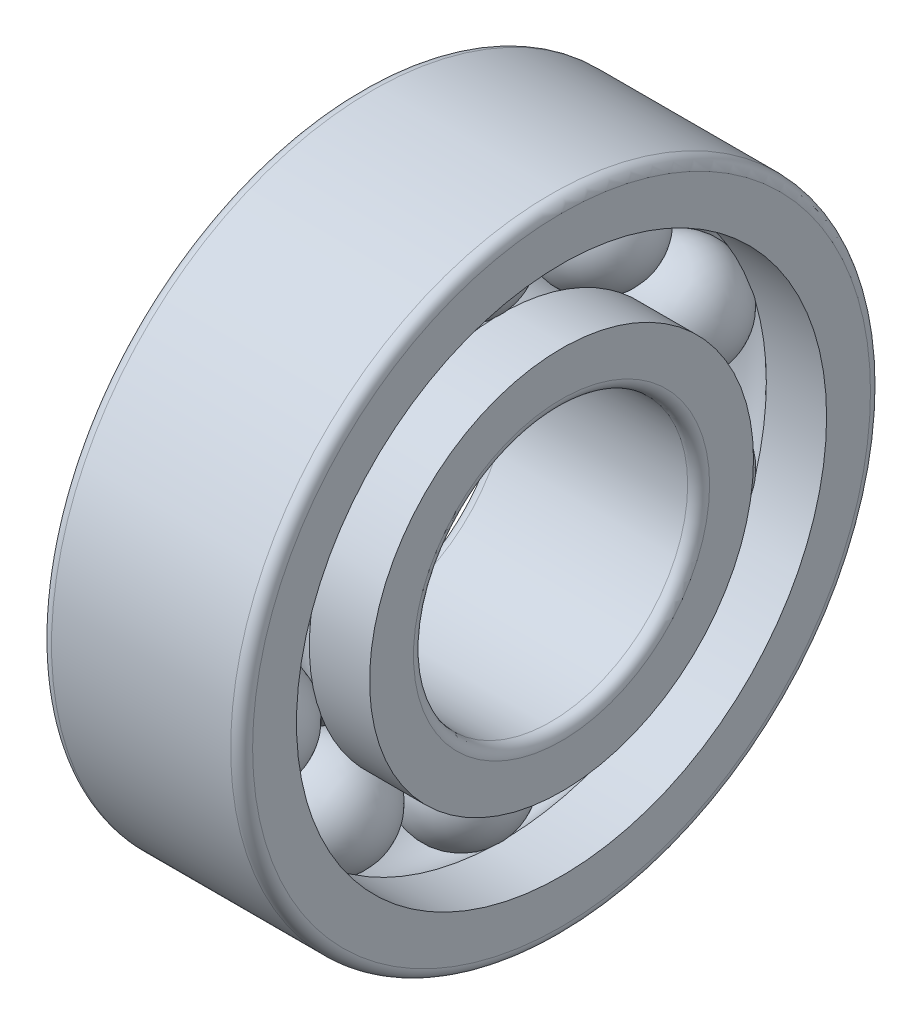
ISO-10303-21;
HEADER;
FILE_DESCRIPTION(('STEP AP214'),'2;1');
FILE_NAME('part.step','',(''),(''),'','','');
FILE_SCHEMA(('AUTOMOTIVE_DESIGN { 1 0 10303 214 1 1 1 1 }'));
ENDSEC;
DATA;
#1=APPLICATION_CONTEXT('core data for automotive mechanical design processes');
#2=APPLICATION_PROTOCOL_DEFINITION('international standard','automotive_design',2000,#1);
#3=PRODUCT_CONTEXT('',#1,'mechanical');
#4=PRODUCT('Part','Part','',(#3));
#5=PRODUCT_RELATED_PRODUCT_CATEGORY('part','',(#4));
#6=PRODUCT_DEFINITION_FORMATION('','',#4);
#7=PRODUCT_DEFINITION_CONTEXT('part definition',#1,'design');
#8=PRODUCT_DEFINITION('design','',#6,#7);
#9=PRODUCT_DEFINITION_SHAPE('','',#8);
#10=(LENGTH_UNIT() NAMED_UNIT(*) SI_UNIT(.MILLI.,.METRE.));
#11=(NAMED_UNIT(*) PLANE_ANGLE_UNIT() SI_UNIT($,.RADIAN.));
#12=(NAMED_UNIT(*) SI_UNIT($,.STERADIAN.) SOLID_ANGLE_UNIT());
#13=UNCERTAINTY_MEASURE_WITH_UNIT(LENGTH_MEASURE(1.E-05),#10,'distance_accuracy_value','');
#14=(GEOMETRIC_REPRESENTATION_CONTEXT(3) GLOBAL_UNCERTAINTY_ASSIGNED_CONTEXT((#13)) GLOBAL_UNIT_ASSIGNED_CONTEXT((#10,
#11,#12)) REPRESENTATION_CONTEXT('',''));
#15=CARTESIAN_POINT('',(0.,0.,0.));
#16=DIRECTION('',(0.,0.,1.));
#17=DIRECTION('',(1.,0.,0.));
#18=AXIS2_PLACEMENT_3D('',#15,#16,#17);
#19=CARTESIAN_POINT('',(0.,0.,0.));
#20=DIRECTION('',(1.,0.,0.));
#21=DIRECTION('',(0.,0.,-1.));
#22=AXIS2_PLACEMENT_3D('',#19,#20,#21);
#23=TOROIDAL_SURFACE('',#22,12.5,2.975);
#24=CARTESIAN_POINT('',(2.2024134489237,0.,0.));
#25=DIRECTION('',(1.,0.,0.));
#26=DIRECTION('',(0.,0.,-1.));
#27=AXIS2_PLACEMENT_3D('',#24,#25,#26);
#28=CIRCLE('',#27,10.5);
#29=CARTESIAN_POINT('',(2.2024134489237,8.28166624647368,6.4547660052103));
#30=VERTEX_POINT('',#29);
#31=CARTESIAN_POINT('',(2.2024134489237,3.57967165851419,9.870965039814));
#32=VERTEX_POINT('',#31);
#33=EDGE_CURVE('E479',#30,#32,#28,.T.);
#34=ORIENTED_EDGE('',*,*,#33,.F.);
#35=CARTESIAN_POINT('',(-2.2026134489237,8.28184225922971,6.45489847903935));
#36=CARTESIAN_POINT('',(-2.14637606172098,8.2323352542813,6.41763767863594));
#37=CARTESIAN_POINT('',(-2.08751565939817,8.18473762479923,6.38180809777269));
#38=CARTESIAN_POINT('',(-1.96499179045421,8.09367631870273,6.31325120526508));
#39=CARTESIAN_POINT('',(-1.90132855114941,8.05021244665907,6.28052374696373));
#40=CARTESIAN_POINT('',(-1.76968858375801,7.96776169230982,6.21843189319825));
#41=CARTESIAN_POINT('',(-1.70171530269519,7.92877130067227,6.18906486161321));
#42=CARTESIAN_POINT('',(-1.56192326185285,7.85550951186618,6.13387867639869));
#43=CARTESIAN_POINT('',(-1.49010454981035,7.82123805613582,6.10805947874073));
#44=CARTESIAN_POINT('',(-1.26954491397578,7.72585190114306,6.03619087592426));
#45=CARTESIAN_POINT('',(-1.11564662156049,7.6721317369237,5.99570509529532));
#46=CARTESIAN_POINT('',(-0.798842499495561,7.58613292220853,5.93088521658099));
#47=CARTESIAN_POINT('',(-0.635937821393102,7.5538515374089,5.90654905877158));
#48=CARTESIAN_POINT('',(-0.305638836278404,7.51158054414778,5.87468081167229));
#49=CARTESIAN_POINT('',(-0.138244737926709,7.50158990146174,5.86714794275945));
#50=CARTESIAN_POINT('',(0.196266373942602,7.50419288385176,5.86911048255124));
#51=CARTESIAN_POINT('',(0.363383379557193,7.51678714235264,5.87860636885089));
#52=CARTESIAN_POINT('',(0.692587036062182,7.56420191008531,5.91435185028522));
#53=CARTESIAN_POINT('',(0.854674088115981,7.5990206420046,5.94060010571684));
#54=CARTESIAN_POINT('',(1.16922320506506,7.68989305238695,6.00909089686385));
#55=CARTESIAN_POINT('',(1.32168511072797,7.74594708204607,6.05133369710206));
#56=CARTESIAN_POINT('',(1.60431441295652,7.87394307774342,6.14776719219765));
#57=CARTESIAN_POINT('',(1.73525991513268,7.94478499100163,6.20113033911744));
#58=CARTESIAN_POINT('',(1.9198437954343,8.0627328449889,6.28995147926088));
#59=CARTESIAN_POINT('',(1.97942760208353,8.10402110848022,6.32103994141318));
#60=CARTESIAN_POINT('',(2.0943125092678,8.19025151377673,6.38595870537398));
#61=CARTESIAN_POINT('',(2.14961324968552,8.23519396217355,6.41978923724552));
#62=CARTESIAN_POINT('',(2.2026134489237,8.2818422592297,6.45489847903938));
#63=B_SPLINE_CURVE_WITH_KNOTS('',3,(#35,#36,#37,#38,#39,#40,#41,#42,#43,#44,#45,#46,#47,#48,#49,
#50,#51,#52,#53,#54,#55,#56,#57,#58,#59,#60,#61,#62),.UNSPECIFIED.,.F.,.F.,(4,2,2,2,2,2,2,2,2,2,
2,2,2,4),(0.,0.250951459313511,0.501891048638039,0.75263241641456,1.00337067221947,
1.50464454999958,2.00585448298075,2.50704116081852,3.00824189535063,3.50940255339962,
4.01057150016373,4.48289703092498,4.71930880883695,4.95574044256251),.UNSPECIFIED.);
#64=CARTESIAN_POINT('',(-2.2024134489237,8.28166624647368,6.4547660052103));
#65=VERTEX_POINT('',#64);
#66=EDGE_CURVE('E299',#65,#30,#63,.T.);
#67=ORIENTED_EDGE('',*,*,#66,.F.);
#68=CARTESIAN_POINT('',(-2.2024134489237,0.,0.));
#69=DIRECTION('',(1.,0.,0.));
#70=DIRECTION('',(0.,0.,-1.));
#71=AXIS2_PLACEMENT_3D('',#68,#69,#70);
#72=CIRCLE('',#71,10.5);
#73=CARTESIAN_POINT('',(-2.2024134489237,3.57967165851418,9.87096503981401));
#74=VERTEX_POINT('',#73);
#75=EDGE_CURVE('E537',#65,#74,#72,.T.);
#76=ORIENTED_EDGE('',*,*,#75,.T.);
#77=CARTESIAN_POINT('',(2.2026134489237,3.57974325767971,9.87117337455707));
#78=CARTESIAN_POINT('',(2.14637606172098,3.55960463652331,9.81257519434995));
#79=CARTESIAN_POINT('',(2.08751565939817,3.54023715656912,9.75623520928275));
#80=CARTESIAN_POINT('',(1.96499179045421,3.50317516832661,9.64844551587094));
#81=CARTESIAN_POINT('',(1.90132855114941,3.48548058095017,9.59699557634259));
#82=CARTESIAN_POINT('',(1.76968858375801,3.45190640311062,9.49939281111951));
#83=CARTESIAN_POINT('',(1.70171530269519,3.43602538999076,9.45323583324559));
#84=CARTESIAN_POINT('',(1.56192326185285,3.4061793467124,9.36650626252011));
#85=CARTESIAN_POINT('',(1.49010454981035,3.39221429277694,9.3259336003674));
#86=CARTESIAN_POINT('',(1.26954491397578,3.35333913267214,9.21300735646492));
#87=CARTESIAN_POINT('',(1.11564662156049,3.33143531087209,9.14940564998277));
#88=CARTESIAN_POINT('',(0.798842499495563,3.29636303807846,9.04758547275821));
#89=CARTESIAN_POINT('',(0.635937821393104,3.28319347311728,9.00936376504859));
#90=CARTESIAN_POINT('',(0.305638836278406,3.26594742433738,8.95931383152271));
#91=CARTESIAN_POINT('',(0.13824473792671,3.26187051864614,8.94748438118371));
#92=CARTESIAN_POINT('',(-0.196266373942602,3.26293263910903,8.95056642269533));
#93=CARTESIAN_POINT('',(-0.363383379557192,3.26807192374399,8.96547866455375));
#94=CARTESIAN_POINT('',(-0.692587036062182,3.28741592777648,9.02161874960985));
#95=CARTESIAN_POINT('',(-0.854674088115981,3.30161992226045,9.06284448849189));
#96=CARTESIAN_POINT('',(-1.16922320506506,3.33867741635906,9.17043410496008));
#97=CARTESIAN_POINT('',(-1.32168511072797,3.36153105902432,9.23679839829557));
#98=CARTESIAN_POINT('',(-1.60431441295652,3.41369182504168,9.38832941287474));
#99=CARTESIAN_POINT('',(-1.73525991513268,3.44255183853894,9.47219419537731));
#100=CARTESIAN_POINT('',(-1.9198437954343,3.490577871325,9.61181651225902));
#101=CARTESIAN_POINT('',(-1.97942760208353,3.50738598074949,9.660690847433));
#102=CARTESIAN_POINT('',(-2.0943125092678,3.54248073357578,9.76276183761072));
#103=CARTESIAN_POINT('',(-2.14961324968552,3.5607675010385,9.81595885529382));
#104=CARTESIAN_POINT('',(-2.2026134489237,3.57974325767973,9.87117337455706));
#105=B_SPLINE_CURVE_WITH_KNOTS('',3,(#77,#78,#79,#80,#81,#82,#83,#84,#85,#86,#87,#88,#89,#90,
#91,#92,#93,#94,#95,#96,#97,#98,#99,#100,#101,#102,#103,#104),.UNSPECIFIED.,.F.,.F.,(4,2,2,2,2,
2,2,2,2,2,2,2,2,4),(0.,0.250951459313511,0.50189104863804,0.75263241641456,1.00337067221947,
1.50464454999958,2.00585448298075,2.50704116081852,3.00824189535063,3.50940255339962,
4.01057150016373,4.48289703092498,4.71930880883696,4.95574044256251),.UNSPECIFIED.);
#106=EDGE_CURVE('E482',#32,#74,#105,.T.);
#107=ORIENTED_EDGE('',*,*,#106,.F.);
#108=EDGE_LOOP('',(#34,#67,#76,#107));
#109=FACE_BOUND('',#108,.T.);
#110=ADVANCED_FACE('F30',(#109),#23,.F.);
#111=CARTESIAN_POINT('',(-2.2024134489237,10.494025,0.354174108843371));
#112=VERTEX_POINT('',#111);
#113=CARTESIAN_POINT('',(-2.2024134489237,8.69802288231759,5.88170025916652));
#114=VERTEX_POINT('',#113);
#115=EDGE_CURVE('E317',#112,#114,#72,.T.);
#116=ORIENTED_EDGE('',*,*,#115,.T.);
#117=CARTESIAN_POINT('',(2.2026134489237,8.6982032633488,5.8818267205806));
#118=CARTESIAN_POINT('',(2.14637606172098,8.64746763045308,5.84625698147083));
#119=CARTESIAN_POINT('',(2.08751565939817,8.59868319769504,5.81206089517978));
#120=CARTESIAN_POINT('',(1.96499179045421,8.50534222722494,5.74664169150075));
#121=CARTESIAN_POINT('',(1.90132855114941,8.46078548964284,5.71541843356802));
#122=CARTESIAN_POINT('',(1.76968858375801,8.37625394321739,5.65619054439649));
#123=CARTESIAN_POINT('',(1.70171530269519,8.33627554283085,5.62818339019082));
#124=CARTESIAN_POINT('',(1.56192326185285,8.26115122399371,5.57556075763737));
#125=CARTESIAN_POINT('',(1.49010454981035,8.22600524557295,5.55094523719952));
#126=CARTESIAN_POINT('',(1.26954491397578,8.12817819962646,5.4824362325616));
#127=CARTESIAN_POINT('',(1.11564662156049,8.07307349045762,5.44385611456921));
#128=CARTESIAN_POINT('',(0.798842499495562,7.98485102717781,5.38209682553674));
#129=CARTESIAN_POINT('',(0.635937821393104,7.95173046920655,5.35891569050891));
#130=CARTESIAN_POINT('',(0.305638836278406,7.90835950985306,5.32856141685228));
#131=CARTESIAN_POINT('',(0.13824473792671,7.89810804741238,5.32138753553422));
#132=CARTESIAN_POINT('',(-0.196266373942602,7.90077889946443,5.32325666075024));
#133=CARTESIAN_POINT('',(-0.363383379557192,7.91370186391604,5.33230012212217));
#134=CARTESIAN_POINT('',(-0.692587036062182,7.962349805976,5.36634828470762));
#135=CARTESIAN_POINT('',(-0.854674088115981,7.99807296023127,5.39135170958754));
#136=CARTESIAN_POINT('',(-1.16922320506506,8.0912926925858,5.45661168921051));
#137=CARTESIAN_POINT('',(-1.32168511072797,8.14878963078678,5.4968684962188));
#138=CARTESIAN_POINT('',(-1.60431441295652,8.28005627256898,5.58880033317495));
#139=CARTESIAN_POINT('',(-1.73525991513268,8.35269899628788,5.63968487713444));
#140=CARTESIAN_POINT('',(-1.9198437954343,8.47362081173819,5.72441271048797));
#141=CARTESIAN_POINT('',(-1.97942760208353,8.51594647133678,5.75407331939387));
#142=CARTESIAN_POINT('',(-2.0943125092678,8.60433454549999,5.81602230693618));
#143=CARTESIAN_POINT('',(-2.14961324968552,8.65039727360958,5.84831090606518));
#144=CARTESIAN_POINT('',(-2.2026134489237,8.69820326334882,5.88182672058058));
#145=B_SPLINE_CURVE_WITH_KNOTS('',3,(#117,#118,#119,#120,#121,#122,#123,#124,#125,#126,#127,
#128,#129,#130,#131,#132,#133,#134,#135,#136,#137,#138,#139,#140,#141,#142,#143,#144),
.UNSPECIFIED.,.F.,.F.,(4,2,2,2,2,2,2,2,2,2,2,2,2,4),(0.,0.250951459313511,0.501891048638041,
0.75263241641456,1.00337067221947,1.50464454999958,2.00585448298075,2.50704116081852,
3.00824189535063,3.50940255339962,4.01057150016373,4.48289703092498,4.71930880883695,
4.95574044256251),.UNSPECIFIED.);
#146=CARTESIAN_POINT('',(2.2024134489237,8.6980228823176,5.88170025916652));
#147=VERTEX_POINT('',#146);
#148=EDGE_CURVE('E50',#147,#114,#145,.T.);
#149=ORIENTED_EDGE('',*,*,#148,.F.);
#150=CARTESIAN_POINT('',(2.2024134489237,10.494025,0.354174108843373));
#151=VERTEX_POINT('',#150);
#152=EDGE_CURVE('E428',#151,#147,#28,.T.);
#153=ORIENTED_EDGE('',*,*,#152,.F.);
#154=CARTESIAN_POINT('',(-2.2026134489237,10.4942452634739,0.354177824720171));
#155=CARTESIAN_POINT('',(-2.14637606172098,10.4322919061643,0.353132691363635));
#156=CARTESIAN_POINT('',(-2.08751565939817,10.3727245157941,0.352123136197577));
#157=CARTESIAN_POINT('',(-1.96499179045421,10.2587576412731,0.350183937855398));
#158=CARTESIAN_POINT('',(-1.90132855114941,10.2043579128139,0.349254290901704));
#159=CARTESIAN_POINT('',(-1.76968858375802,10.1011571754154,0.347484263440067));
#160=CARTESIAN_POINT('',(-1.70171530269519,10.052351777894,0.346643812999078));
#161=CARTESIAN_POINT('',(-1.56192326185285,9.96064411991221,0.345059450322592));
#162=CARTESIAN_POINT('',(-1.49010454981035,9.91774178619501,0.344315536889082));
#163=CARTESIAN_POINT('',(-1.26954491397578,9.79832946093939,0.342239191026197));
#164=CARTESIAN_POINT('',(-1.11564662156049,9.73107199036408,0.341061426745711));
#165=CARTESIAN_POINT('',(-0.798842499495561,9.62339731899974,0.339169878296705));
#166=CARTESIAN_POINT('',(-0.635937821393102,9.58297669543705,0.338456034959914));
#167=CARTESIAN_POINT('',(-0.305638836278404,9.53004705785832,0.337520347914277));
#168=CARTESIAN_POINT('',(-0.138244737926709,9.51753674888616,0.337298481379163));
#169=CARTESIAN_POINT('',(0.196266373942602,9.52079615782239,0.33735621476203));
#170=CARTESIAN_POINT('',(0.363383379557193,9.53656666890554,0.337635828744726));
#171=CARTESIAN_POINT('',(0.692587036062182,9.59593668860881,0.33868482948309));
#172=CARTESIAN_POINT('',(0.854674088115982,9.63953397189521,0.339454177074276));
#173=CARTESIAN_POINT('',(1.16922320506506,9.7533091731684,0.341450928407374));
#174=CARTESIAN_POINT('',(1.32168511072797,9.82348753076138,0.342678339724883));
#175=CARTESIAN_POINT('',(1.60431441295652,9.98372065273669,0.345460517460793));
#176=CARTESIAN_POINT('',(1.73525991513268,10.072399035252,0.34699237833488));
#177=CARTESIAN_POINT('',(1.9198437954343,10.2200286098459,0.349522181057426));
#178=CARTESIAN_POINT('',(1.97942760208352,10.2717048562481,0.350404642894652));
#179=CARTESIAN_POINT('',(2.0943125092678,10.3796250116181,0.352240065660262));
#180=CARTESIAN_POINT('',(2.14961324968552,10.4358693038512,0.353193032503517));
#181=CARTESIAN_POINT('',(2.2026134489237,10.4942452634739,0.354177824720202));
#182=B_SPLINE_CURVE_WITH_KNOTS('',3,(#154,#155,#156,#157,#158,#159,#160,#161,#162,#163,#164,
#165,#166,#167,#168,#169,#170,#171,#172,#173,#174,#175,#176,#177,#178,#179,#180,#181),
.UNSPECIFIED.,.F.,.F.,(4,2,2,2,2,2,2,2,2,2,2,2,2,4),(0.,0.25095145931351,0.501891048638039,
0.75263241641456,1.00337067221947,1.50464454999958,2.00585448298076,2.50704116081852,
3.00824189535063,3.50940255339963,4.01057150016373,4.48289703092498,4.71930880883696,
4.95574044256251),.UNSPECIFIED.);
#183=EDGE_CURVE('E427',#112,#151,#182,.T.);
#184=ORIENTED_EDGE('',*,*,#183,.F.);
#185=EDGE_LOOP('',(#116,#149,#153,#184));
#186=FACE_BOUND('',#185,.T.);
#187=ADVANCED_FACE('F448',(#186),#23,.F.);
#188=CARTESIAN_POINT('',(-20.6375,0.,0.));
#189=DIRECTION('',(1.,0.,0.));
#190=DIRECTION('',(0.,0.,-1.));
#191=AXIS2_PLACEMENT_3D('',#188,#189,#190);
#192=CYLINDRICAL_SURFACE('',#191,10.5);
#193=CARTESIAN_POINT('',(5.5,0.,0.));
#194=DIRECTION('',(1.,0.,0.));
#195=DIRECTION('',(0.,0.,-1.));
#196=AXIS2_PLACEMENT_3D('',#193,#194,#195);
#197=CIRCLE('',#196,10.5);
#198=CARTESIAN_POINT('',(5.5,0.,-10.5));
#199=VERTEX_POINT('',#198);
#200=EDGE_CURVE('E517',#199,#199,#197,.T.);
#201=ORIENTED_EDGE('',*,*,#200,.F.);
#202=EDGE_LOOP('',(#201));
#203=FACE_BOUND('',#202,.T.);
#204=ORIENTED_EDGE('',*,*,#152,.T.);
#205=CARTESIAN_POINT('',(2.2022134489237,8.28102496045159,6.45558871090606));
#206=CARTESIAN_POINT('',(2.21351205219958,8.31716321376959,6.40924163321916));
#207=CARTESIAN_POINT('',(2.22200193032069,8.35323507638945,6.36215729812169));
#208=CARTESIAN_POINT('',(2.23325385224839,8.42456406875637,6.26738967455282));
#209=CARTESIAN_POINT('',(2.23606797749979,8.4598256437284,6.21971590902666));
#210=CARTESIAN_POINT('',(2.23606797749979,8.52953123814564,6.12377438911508));
#211=CARTESIAN_POINT('',(2.23325385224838,8.56397525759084,6.07550663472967));
#212=CARTESIAN_POINT('',(2.22200193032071,8.6320627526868,5.97838392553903));
#213=CARTESIAN_POINT('',(2.21351205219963,8.66569579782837,5.92952768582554));
#214=CARTESIAN_POINT('',(2.20221344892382,8.69860715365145,5.88083612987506));
#215=B_SPLINE_CURVE_WITH_KNOTS('',3,(#205,#206,#207,#208,#209,#210,#211,#212,#213,#214),
.UNSPECIFIED.,.F.,.F.,(4,2,2,2,4),(0.,0.179473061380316,0.3572916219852,0.535110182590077,
0.714583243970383),.UNSPECIFIED.);
#216=EDGE_CURVE('E1337',#30,#147,#215,.T.);
#217=ORIENTED_EDGE('',*,*,#216,.F.);
#218=ORIENTED_EDGE('',*,*,#33,.T.);
#219=CARTESIAN_POINT('',(2.2022134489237,2.90499008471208,10.0901453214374));
#220=CARTESIAN_POINT('',(2.21351205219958,2.96146867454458,10.073891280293));
#221=CARTESIAN_POINT('',(2.22200193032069,3.0183269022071,10.057001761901));
#222=CARTESIAN_POINT('',(2.23325385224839,3.13173628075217,10.0222592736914));
#223=CARTESIAN_POINT('',(2.23606797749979,3.1882854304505,10.004416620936));
#224=CARTESIAN_POINT('',(2.23606797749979,3.3010714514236,9.96777022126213));
#225=CARTESIAN_POINT('',(2.23325385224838,3.35730832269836,9.94896647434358));
#226=CARTESIAN_POINT('',(2.22200193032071,3.46947955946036,9.91041337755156));
#227=CARTESIAN_POINT('',(2.21351205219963,3.52540624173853,9.89065685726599));
#228=CARTESIAN_POINT('',(2.20221344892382,3.58065226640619,9.87060937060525));
#229=B_SPLINE_CURVE_WITH_KNOTS('',3,(#219,#220,#221,#222,#223,#224,#225,#226,#227,#228),
.UNSPECIFIED.,.F.,.F.,(4,2,2,2,4),(0.,0.179473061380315,0.3572916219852,0.535110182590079,
0.714583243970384),.UNSPECIFIED.);
#230=CARTESIAN_POINT('',(2.2024134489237,2.90599247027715,10.0898566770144));
#231=VERTEX_POINT('',#230);
#232=EDGE_CURVE('E674',#231,#32,#229,.T.);
#233=ORIENTED_EDGE('',*,*,#232,.F.);
#234=CARTESIAN_POINT('',(2.2024134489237,-2.90599247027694,10.0898566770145));
#235=VERTEX_POINT('',#234);
#236=EDGE_CURVE('E487',#231,#235,#28,.T.);
#237=ORIENTED_EDGE('',*,*,#236,.T.);
#238=CARTESIAN_POINT('',(2.2022134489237,-3.58065226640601,9.87060937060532));
#239=CARTESIAN_POINT('',(2.21351205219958,-3.52540624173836,9.89065685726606));
#240=CARTESIAN_POINT('',(2.22200193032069,-3.46947955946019,9.91041337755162));
#241=CARTESIAN_POINT('',(2.23325385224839,-3.35730832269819,9.94896647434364));
#242=CARTESIAN_POINT('',(2.23606797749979,-3.30107145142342,9.96777022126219));
#243=CARTESIAN_POINT('',(2.23606797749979,-3.18828543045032,10.0044166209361));
#244=CARTESIAN_POINT('',(2.23325385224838,-3.13173628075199,10.0222592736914));
#245=CARTESIAN_POINT('',(2.22200193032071,-3.01832690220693,10.057001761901));
#246=CARTESIAN_POINT('',(2.21351205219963,-2.9614686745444,10.073891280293));
#247=CARTESIAN_POINT('',(2.20221344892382,-2.90499008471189,10.0901453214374));
#248=B_SPLINE_CURVE_WITH_KNOTS('',3,(#238,#239,#240,#241,#242,#243,#244,#245,#246,#247),
.UNSPECIFIED.,.F.,.F.,(4,2,2,2,4),(0.,0.179473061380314,0.3572916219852,0.535110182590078,
0.714583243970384),.UNSPECIFIED.);
#249=CARTESIAN_POINT('',(2.2024134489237,-3.57967165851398,9.87096503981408));
#250=VERTEX_POINT('',#249);
#251=EDGE_CURVE('E770',#250,#235,#248,.T.);
#252=ORIENTED_EDGE('',*,*,#251,.F.);
#253=CARTESIAN_POINT('',(2.2024134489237,-8.28166624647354,6.45476600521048));
#254=VERTEX_POINT('',#253);
#255=EDGE_CURVE('E490',#250,#254,#28,.T.);
#256=ORIENTED_EDGE('',*,*,#255,.T.);
#257=CARTESIAN_POINT('',(2.2022134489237,-8.69860715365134,5.88083612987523));
#258=CARTESIAN_POINT('',(2.21351205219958,-8.66569579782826,5.9295276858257));
#259=CARTESIAN_POINT('',(2.22200193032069,-8.63206275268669,5.97838392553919));
#260=CARTESIAN_POINT('',(2.23325385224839,-8.56397525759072,6.07550663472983));
#261=CARTESIAN_POINT('',(2.23606797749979,-8.52953123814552,6.12377438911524));
#262=CARTESIAN_POINT('',(2.23606797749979,-8.45982564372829,6.21971590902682));
#263=CARTESIAN_POINT('',(2.23325385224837,-8.42456406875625,6.26738967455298));
#264=CARTESIAN_POINT('',(2.22200193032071,-8.35323507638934,6.36215729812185));
#265=CARTESIAN_POINT('',(2.21351205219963,-8.31716321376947,6.40924163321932));
#266=CARTESIAN_POINT('',(2.20221344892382,-8.28102496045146,6.45558871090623));
#267=B_SPLINE_CURVE_WITH_KNOTS('',3,(#257,#258,#259,#260,#261,#262,#263,#264,#265,#266),
.UNSPECIFIED.,.F.,.F.,(4,2,2,2,4),(0.,0.179473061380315,0.3572916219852,0.535110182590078,
0.714583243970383),.UNSPECIFIED.);
#268=CARTESIAN_POINT('',(2.2024134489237,-8.69802288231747,5.88170025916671));
#269=VERTEX_POINT('',#268);
#270=EDGE_CURVE('E827',#269,#254,#267,.T.);
#271=ORIENTED_EDGE('',*,*,#270,.F.);
#272=CARTESIAN_POINT('',(2.2024134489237,-10.494025,0.354174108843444));
#273=VERTEX_POINT('',#272);
#274=EDGE_CURVE('E494',#269,#273,#28,.T.);
#275=ORIENTED_EDGE('',*,*,#274,.T.);
#276=CARTESIAN_POINT('',(2.2022134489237,-10.4939897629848,-0.355216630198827));
#277=CARTESIAN_POINT('',(2.21351205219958,-10.4959840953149,-0.296479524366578));
#278=CARTESIAN_POINT('',(2.22200193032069,-10.4974913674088,-0.237184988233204));
#279=CARTESIAN_POINT('',(2.23325385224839,-10.4994947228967,-0.118590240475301));
#280=CARTESIAN_POINT('',(2.23606797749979,-10.5,-0.0592951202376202));
#281=CARTESIAN_POINT('',(2.23606797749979,-10.5,0.0592951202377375));
#282=CARTESIAN_POINT('',(2.23325385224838,-10.4994947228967,0.118590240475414));
#283=CARTESIAN_POINT('',(2.22200193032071,-10.4974913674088,0.237184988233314));
#284=CARTESIAN_POINT('',(2.21351205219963,-10.4959840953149,0.29647952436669));
#285=CARTESIAN_POINT('',(2.20221344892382,-10.4939897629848,0.355216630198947));
#286=B_SPLINE_CURVE_WITH_KNOTS('',3,(#276,#277,#278,#279,#280,#281,#282,#283,#284,#285),
.UNSPECIFIED.,.F.,.F.,(4,2,2,2,4),(0.,0.179473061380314,0.3572916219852,0.535110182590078,
0.714583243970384),.UNSPECIFIED.);
#287=CARTESIAN_POINT('',(2.2024134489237,-10.494025,-0.3541741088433));
#288=VERTEX_POINT('',#287);
#289=EDGE_CURVE('E884',#288,#273,#286,.T.);
#290=ORIENTED_EDGE('',*,*,#289,.F.);
#291=CARTESIAN_POINT('',(2.2024134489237,-8.69802288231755,-5.88170025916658));
#292=VERTEX_POINT('',#291);
#293=EDGE_CURVE('E498',#288,#292,#28,.T.);
#294=ORIENTED_EDGE('',*,*,#293,.T.);
#295=CARTESIAN_POINT('',(2.2022134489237,-8.28102496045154,-6.45558871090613));
#296=CARTESIAN_POINT('',(2.21351205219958,-8.31716321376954,-6.40924163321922));
#297=CARTESIAN_POINT('',(2.22200193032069,-8.3532350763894,-6.36215729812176));
#298=CARTESIAN_POINT('',(2.23325385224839,-8.42456406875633,-6.26738967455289));
#299=CARTESIAN_POINT('',(2.23606797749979,-8.45982564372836,-6.21971590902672));
#300=CARTESIAN_POINT('',(2.23606797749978,-8.52953123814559,-6.12377438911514));
#301=CARTESIAN_POINT('',(2.23325385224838,-8.56397525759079,-6.07550663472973));
#302=CARTESIAN_POINT('',(2.22200193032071,-8.63206275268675,-5.9783839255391));
#303=CARTESIAN_POINT('',(2.21351205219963,-8.66569579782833,-5.92952768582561));
#304=CARTESIAN_POINT('',(2.20221344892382,-8.69860715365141,-5.88083612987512));
#305=B_SPLINE_CURVE_WITH_KNOTS('',3,(#295,#296,#297,#298,#299,#300,#301,#302,#303,#304),
.UNSPECIFIED.,.F.,.F.,(4,2,2,2,4),(0.,0.179473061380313,0.357291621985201,0.535110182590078,
0.714583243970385),.UNSPECIFIED.);
#306=CARTESIAN_POINT('',(2.2024134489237,-8.28166624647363,-6.45476600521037));
#307=VERTEX_POINT('',#306);
#308=EDGE_CURVE('E941',#307,#292,#305,.T.);
#309=ORIENTED_EDGE('',*,*,#308,.F.);
#310=CARTESIAN_POINT('',(2.2024134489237,-3.57967165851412,-9.87096503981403));
#311=VERTEX_POINT('',#310);
#312=EDGE_CURVE('E502',#307,#311,#28,.T.);
#313=ORIENTED_EDGE('',*,*,#312,.T.);
#314=CARTESIAN_POINT('',(2.2022134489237,-2.90499008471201,-10.0901453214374));
#315=CARTESIAN_POINT('',(2.21351205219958,-2.96146867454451,-10.073891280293));
#316=CARTESIAN_POINT('',(2.22200193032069,-3.01832690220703,-10.057001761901));
#317=CARTESIAN_POINT('',(2.23325385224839,-3.1317362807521,-10.0222592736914));
#318=CARTESIAN_POINT('',(2.23606797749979,-3.18828543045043,-10.0044166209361));
#319=CARTESIAN_POINT('',(2.23606797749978,-3.30107145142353,-9.96777022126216));
#320=CARTESIAN_POINT('',(2.23325385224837,-3.35730832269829,-9.94896647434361));
#321=CARTESIAN_POINT('',(2.22200193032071,-3.46947955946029,-9.91041337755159));
#322=CARTESIAN_POINT('',(2.21351205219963,-3.52540624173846,-9.89065685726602));
#323=CARTESIAN_POINT('',(2.20221344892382,-3.58065226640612,-9.87060937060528));
#324=B_SPLINE_CURVE_WITH_KNOTS('',3,(#314,#315,#316,#317,#318,#319,#320,#321,#322,#323),
.UNSPECIFIED.,.F.,.F.,(4,2,2,2,4),(0.,0.179473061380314,0.3572916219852,0.535110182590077,
0.714583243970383),.UNSPECIFIED.);
#325=CARTESIAN_POINT('',(2.2024134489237,-2.90599247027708,-10.0898566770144));
#326=VERTEX_POINT('',#325);
#327=EDGE_CURVE('E998',#326,#311,#324,.T.);
#328=ORIENTED_EDGE('',*,*,#327,.F.);
#329=CARTESIAN_POINT('',(2.2024134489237,2.90599247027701,-10.0898566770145));
#330=VERTEX_POINT('',#329);
#331=EDGE_CURVE('E506',#326,#330,#28,.T.);
#332=ORIENTED_EDGE('',*,*,#331,.T.);
#333=CARTESIAN_POINT('',(2.2022134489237,3.58065226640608,-9.8706093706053));
#334=CARTESIAN_POINT('',(2.21351205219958,3.52540624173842,-9.89065685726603));
#335=CARTESIAN_POINT('',(2.22200193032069,3.46947955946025,-9.9104133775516));
#336=CARTESIAN_POINT('',(2.23325385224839,3.35730832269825,-9.94896647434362));
#337=CARTESIAN_POINT('',(2.23606797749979,3.30107145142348,-9.96777022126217));
#338=CARTESIAN_POINT('',(2.23606797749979,3.18828543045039,-10.0044166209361));
#339=CARTESIAN_POINT('',(2.23325385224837,3.13173628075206,-10.0222592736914));
#340=CARTESIAN_POINT('',(2.22200193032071,3.01832690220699,-10.057001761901));
#341=CARTESIAN_POINT('',(2.21351205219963,2.96146867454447,-10.073891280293));
#342=CARTESIAN_POINT('',(2.20221344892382,2.90499008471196,-10.0901453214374));
#343=B_SPLINE_CURVE_WITH_KNOTS('',3,(#333,#334,#335,#336,#337,#338,#339,#340,#341,#342),
.UNSPECIFIED.,.F.,.F.,(4,2,2,2,4),(0.,0.179473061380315,0.3572916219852,0.535110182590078,
0.714583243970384),.UNSPECIFIED.);
#344=CARTESIAN_POINT('',(2.2024134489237,3.57967165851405,-9.87096503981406));
#345=VERTEX_POINT('',#344);
#346=EDGE_CURVE('E1054',#345,#330,#343,.T.);
#347=ORIENTED_EDGE('',*,*,#346,.F.);
#348=CARTESIAN_POINT('',(2.2024134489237,8.28166624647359,-6.45476600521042));
#349=VERTEX_POINT('',#348);
#350=EDGE_CURVE('E510',#345,#349,#28,.T.);
#351=ORIENTED_EDGE('',*,*,#350,.T.);
#352=CARTESIAN_POINT('',(2.2022134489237,8.69860715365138,-5.88083612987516));
#353=CARTESIAN_POINT('',(2.21351205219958,8.6656957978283,-5.92952768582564));
#354=CARTESIAN_POINT('',(2.22200193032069,8.63206275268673,-5.97838392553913));
#355=CARTESIAN_POINT('',(2.23325385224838,8.56397525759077,-6.07550663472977));
#356=CARTESIAN_POINT('',(2.23606797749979,8.52953123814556,-6.12377438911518));
#357=CARTESIAN_POINT('',(2.23606797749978,8.45982564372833,-6.21971590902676));
#358=CARTESIAN_POINT('',(2.23325385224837,8.4245640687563,-6.26738967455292));
#359=CARTESIAN_POINT('',(2.22200193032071,8.35323507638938,-6.36215729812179));
#360=CARTESIAN_POINT('',(2.21351205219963,8.31716321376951,-6.40924163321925));
#361=CARTESIAN_POINT('',(2.20221344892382,8.28102496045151,-6.45558871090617));
#362=B_SPLINE_CURVE_WITH_KNOTS('',3,(#352,#353,#354,#355,#356,#357,#358,#359,#360,#361),
.UNSPECIFIED.,.F.,.F.,(4,2,2,2,4),(0.,0.179473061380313,0.357291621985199,0.535110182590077,
0.714583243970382),.UNSPECIFIED.);
#363=CARTESIAN_POINT('',(2.2024134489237,8.69802288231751,-5.88170025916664));
#364=VERTEX_POINT('',#363);
#365=EDGE_CURVE('E586',#364,#349,#362,.T.);
#366=ORIENTED_EDGE('',*,*,#365,.F.);
#367=CARTESIAN_POINT('',(2.2024134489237,10.494025,-0.35417410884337));
#368=VERTEX_POINT('',#367);
#369=EDGE_CURVE('E489',#364,#368,#28,.T.);
#370=ORIENTED_EDGE('',*,*,#369,.T.);
#371=CARTESIAN_POINT('',(2.2022134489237,10.4939897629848,0.3552166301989));
#372=CARTESIAN_POINT('',(2.21351205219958,10.4959840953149,0.296479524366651));
#373=CARTESIAN_POINT('',(2.22200193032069,10.4974913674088,0.237184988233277));
#374=CARTESIAN_POINT('',(2.23325385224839,10.4994947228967,0.118590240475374));
#375=CARTESIAN_POINT('',(2.23606797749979,10.5,0.0592951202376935));
#376=CARTESIAN_POINT('',(2.23606797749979,10.5,-0.0592951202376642));
#377=CARTESIAN_POINT('',(2.23325385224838,10.4994947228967,-0.118590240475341));
#378=CARTESIAN_POINT('',(2.22200193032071,10.4974913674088,-0.237184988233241));
#379=CARTESIAN_POINT('',(2.21351205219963,10.4959840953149,-0.296479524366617));
#380=CARTESIAN_POINT('',(2.20221344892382,10.4939897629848,-0.355216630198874));
#381=B_SPLINE_CURVE_WITH_KNOTS('',3,(#371,#372,#373,#374,#375,#376,#377,#378,#379,#380),
.UNSPECIFIED.,.F.,.F.,(4,2,2,2,4),(0.,0.179473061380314,0.3572916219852,0.535110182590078,
0.714583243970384),.UNSPECIFIED.);
#382=EDGE_CURVE('E389',#151,#368,#381,.T.);
#383=ORIENTED_EDGE('',*,*,#382,.F.);
#384=EDGE_LOOP('',(#204,#217,#218,#233,#237,#252,#256,#271,#275,#290,#294,#309,#313,#328,#332,
#347,#351,#366,#370,#383));
#385=FACE_BOUND('',#384,.T.);
#386=ADVANCED_FACE('F415',(#203,#385),#192,.T.);
#387=CARTESIAN_POINT('',(-20.6375,0.,0.));
#388=DIRECTION('',(1.,0.,0.));
#389=DIRECTION('',(0.,0.,-1.));
#390=AXIS2_PLACEMENT_3D('',#387,#388,#389);
#391=CYLINDRICAL_SURFACE('',#390,10.5);
#392=CARTESIAN_POINT('',(-5.5,0.,0.));
#393=DIRECTION('',(1.,0.,0.));
#394=DIRECTION('',(0.,0.,-1.));
#395=AXIS2_PLACEMENT_3D('',#392,#393,#394);
#396=CIRCLE('',#395,10.5);
#397=CARTESIAN_POINT('',(-5.5,0.,-10.5));
#398=VERTEX_POINT('',#397);
#399=EDGE_CURVE('E534',#398,#398,#396,.T.);
#400=ORIENTED_EDGE('',*,*,#399,.T.);
#401=EDGE_LOOP('',(#400));
#402=FACE_BOUND('',#401,.T.);
#403=ORIENTED_EDGE('',*,*,#75,.F.);
#404=CARTESIAN_POINT('',(-2.2022134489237,8.69860715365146,5.88083612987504));
#405=CARTESIAN_POINT('',(-2.21351205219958,8.66569579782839,5.92952768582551));
#406=CARTESIAN_POINT('',(-2.22200193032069,8.63206275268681,5.97838392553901));
#407=CARTESIAN_POINT('',(-2.23325385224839,8.56397525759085,6.07550663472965));
#408=CARTESIAN_POINT('',(-2.23606797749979,8.52953123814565,6.12377438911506));
#409=CARTESIAN_POINT('',(-2.23606797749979,8.45982564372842,6.21971590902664));
#410=CARTESIAN_POINT('',(-2.23325385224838,8.42456406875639,6.2673896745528));
#411=CARTESIAN_POINT('',(-2.22200193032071,8.35323507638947,6.36215729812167));
#412=CARTESIAN_POINT('',(-2.21351205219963,8.3171632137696,6.40924163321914));
#413=CARTESIAN_POINT('',(-2.20221344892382,8.2810249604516,6.45558871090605));
#414=B_SPLINE_CURVE_WITH_KNOTS('',3,(#404,#405,#406,#407,#408,#409,#410,#411,#412,#413),
.UNSPECIFIED.,.F.,.F.,(4,2,2,2,4),(0.,0.179473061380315,0.357291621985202,0.535110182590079,
0.714583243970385),.UNSPECIFIED.);
#415=EDGE_CURVE('E677',#114,#65,#414,.T.);
#416=ORIENTED_EDGE('',*,*,#415,.F.);
#417=ORIENTED_EDGE('',*,*,#115,.F.);
#418=CARTESIAN_POINT('',(-2.2022134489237,10.4939897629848,-0.355216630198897));
#419=CARTESIAN_POINT('',(-2.21351205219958,10.4959840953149,-0.296479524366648));
#420=CARTESIAN_POINT('',(-2.22200193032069,10.4974913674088,-0.237184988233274));
#421=CARTESIAN_POINT('',(-2.23325385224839,10.4994947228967,-0.118590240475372));
#422=CARTESIAN_POINT('',(-2.23606797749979,10.5,-0.0592951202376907));
#423=CARTESIAN_POINT('',(-2.23606797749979,10.5,0.0592951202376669));
#424=CARTESIAN_POINT('',(-2.23325385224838,10.4994947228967,0.118590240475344));
#425=CARTESIAN_POINT('',(-2.22200193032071,10.4974913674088,0.237184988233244));
#426=CARTESIAN_POINT('',(-2.21351205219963,10.4959840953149,0.29647952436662));
#427=CARTESIAN_POINT('',(-2.20221344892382,10.4939897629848,0.355216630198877));
#428=B_SPLINE_CURVE_WITH_KNOTS('',3,(#418,#419,#420,#421,#422,#423,#424,#425,#426,#427),
.UNSPECIFIED.,.F.,.F.,(4,2,2,2,4),(0.,0.179473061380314,0.3572916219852,0.535110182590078,
0.714583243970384),.UNSPECIFIED.);
#429=CARTESIAN_POINT('',(-2.2024134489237,10.494025,-0.354174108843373));
#430=VERTEX_POINT('',#429);
#431=EDGE_CURVE('E420',#430,#112,#428,.T.);
#432=ORIENTED_EDGE('',*,*,#431,.F.);
#433=CARTESIAN_POINT('',(-2.2024134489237,8.69802288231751,-5.88170025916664));
#434=VERTEX_POINT('',#433);
#435=EDGE_CURVE('E312',#434,#430,#72,.T.);
#436=ORIENTED_EDGE('',*,*,#435,.F.);
#437=CARTESIAN_POINT('',(-2.2022134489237,8.2810249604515,-6.45558871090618));
#438=CARTESIAN_POINT('',(-2.21351205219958,8.31716321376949,-6.40924163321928));
#439=CARTESIAN_POINT('',(-2.22200193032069,8.35323507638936,-6.36215729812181));
#440=CARTESIAN_POINT('',(-2.23325385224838,8.42456406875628,-6.26738967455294));
#441=CARTESIAN_POINT('',(-2.23606797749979,8.45982564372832,-6.21971590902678));
#442=CARTESIAN_POINT('',(-2.23606797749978,8.52953123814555,-6.1237743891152));
#443=CARTESIAN_POINT('',(-2.23325385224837,8.56397525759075,-6.07550663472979));
#444=CARTESIAN_POINT('',(-2.22200193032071,8.63206275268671,-5.97838392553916));
#445=CARTESIAN_POINT('',(-2.21351205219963,8.66569579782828,-5.92952768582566));
#446=CARTESIAN_POINT('',(-2.20221344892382,8.69860715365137,-5.88083612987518));
#447=B_SPLINE_CURVE_WITH_KNOTS('',3,(#437,#438,#439,#440,#441,#442,#443,#444,#445,#446),
.UNSPECIFIED.,.F.,.F.,(4,2,2,2,4),(0.,0.179473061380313,0.3572916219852,0.535110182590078,
0.714583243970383),.UNSPECIFIED.);
#448=CARTESIAN_POINT('',(-2.2024134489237,8.28166624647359,-6.45476600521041));
#449=VERTEX_POINT('',#448);
#450=EDGE_CURVE('E350',#449,#434,#447,.T.);
#451=ORIENTED_EDGE('',*,*,#450,.F.);
#452=CARTESIAN_POINT('',(-2.2024134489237,3.57967165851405,-9.87096503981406));
#453=VERTEX_POINT('',#452);
#454=EDGE_CURVE('E315',#453,#449,#72,.T.);
#455=ORIENTED_EDGE('',*,*,#454,.F.);
#456=CARTESIAN_POINT('',(-2.2022134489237,2.90499008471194,-10.0901453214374));
#457=CARTESIAN_POINT('',(-2.21351205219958,2.96146867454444,-10.073891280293));
#458=CARTESIAN_POINT('',(-2.22200193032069,3.01832690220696,-10.057001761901));
#459=CARTESIAN_POINT('',(-2.23325385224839,3.13173628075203,-10.0222592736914));
#460=CARTESIAN_POINT('',(-2.23606797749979,3.18828543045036,-10.0044166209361));
#461=CARTESIAN_POINT('',(-2.23606797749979,3.30107145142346,-9.96777022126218));
#462=CARTESIAN_POINT('',(-2.23325385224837,3.35730832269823,-9.94896647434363));
#463=CARTESIAN_POINT('',(-2.22200193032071,3.46947955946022,-9.91041337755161));
#464=CARTESIAN_POINT('',(-2.21351205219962,3.52540624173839,-9.89065685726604));
#465=CARTESIAN_POINT('',(-2.20221344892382,3.58065226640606,-9.8706093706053));
#466=B_SPLINE_CURVE_WITH_KNOTS('',3,(#456,#457,#458,#459,#460,#461,#462,#463,#464,#465),
.UNSPECIFIED.,.F.,.F.,(4,2,2,2,4),(0.,0.179473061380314,0.3572916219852,0.535110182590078,
0.714583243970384),.UNSPECIFIED.);
#467=CARTESIAN_POINT('',(-2.2024134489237,2.90599247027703,-10.0898566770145));
#468=VERTEX_POINT('',#467);
#469=EDGE_CURVE('E598',#468,#453,#466,.T.);
#470=ORIENTED_EDGE('',*,*,#469,.F.);
#471=CARTESIAN_POINT('',(-2.2024134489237,-2.90599247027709,-10.0898566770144));
#472=VERTEX_POINT('',#471);
#473=EDGE_CURVE('E564',#472,#468,#72,.T.);
#474=ORIENTED_EDGE('',*,*,#473,.F.);
#475=CARTESIAN_POINT('',(-2.2022134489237,-3.58065226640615,-9.87060937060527));
#476=CARTESIAN_POINT('',(-2.21351205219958,-3.52540624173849,-9.89065685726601));
#477=CARTESIAN_POINT('',(-2.22200193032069,-3.46947955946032,-9.91041337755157));
#478=CARTESIAN_POINT('',(-2.23325385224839,-3.35730832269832,-9.9489664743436));
#479=CARTESIAN_POINT('',(-2.23606797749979,-3.30107145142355,-9.96777022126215));
#480=CARTESIAN_POINT('',(-2.23606797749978,-3.18828543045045,-10.004416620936));
#481=CARTESIAN_POINT('',(-2.23325385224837,-3.13173628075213,-10.0222592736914));
#482=CARTESIAN_POINT('',(-2.22200193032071,-3.01832690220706,-10.057001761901));
#483=CARTESIAN_POINT('',(-2.21351205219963,-2.96146867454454,-10.073891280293));
#484=CARTESIAN_POINT('',(-2.20221344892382,-2.90499008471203,-10.0901453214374));
#485=B_SPLINE_CURVE_WITH_KNOTS('',3,(#475,#476,#477,#478,#479,#480,#481,#482,#483,#484),
.UNSPECIFIED.,.F.,.F.,(4,2,2,2,4),(0.,0.179473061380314,0.357291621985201,0.535110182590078,
0.714583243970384),.UNSPECIFIED.);
#486=CARTESIAN_POINT('',(-2.2024134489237,-3.5796716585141,-9.87096503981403));
#487=VERTEX_POINT('',#486);
#488=EDGE_CURVE('E1014',#487,#472,#485,.T.);
#489=ORIENTED_EDGE('',*,*,#488,.F.);
#490=CARTESIAN_POINT('',(-2.2024134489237,-8.28166624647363,-6.45476600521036));
#491=VERTEX_POINT('',#490);
#492=EDGE_CURVE('E558',#491,#487,#72,.T.);
#493=ORIENTED_EDGE('',*,*,#492,.F.);
#494=CARTESIAN_POINT('',(-2.2022134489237,-8.69860715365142,-5.8808361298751));
#495=CARTESIAN_POINT('',(-2.21351205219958,-8.66569579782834,-5.92952768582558));
#496=CARTESIAN_POINT('',(-2.22200193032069,-8.63206275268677,-5.97838392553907));
#497=CARTESIAN_POINT('',(-2.23325385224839,-8.56397525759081,-6.07550663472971));
#498=CARTESIAN_POINT('',(-2.23606797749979,-8.5295312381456,-6.12377438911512));
#499=CARTESIAN_POINT('',(-2.23606797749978,-8.45982564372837,-6.2197159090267));
#500=CARTESIAN_POINT('',(-2.23325385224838,-8.42456406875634,-6.26738967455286));
#501=CARTESIAN_POINT('',(-2.22200193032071,-8.35323507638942,-6.36215729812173));
#502=CARTESIAN_POINT('',(-2.21351205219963,-8.31716321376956,-6.4092416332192));
#503=CARTESIAN_POINT('',(-2.20221344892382,-8.28102496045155,-6.45558871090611));
#504=B_SPLINE_CURVE_WITH_KNOTS('',3,(#494,#495,#496,#497,#498,#499,#500,#501,#502,#503),
.UNSPECIFIED.,.F.,.F.,(4,2,2,2,4),(0.,0.179473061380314,0.3572916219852,0.535110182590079,
0.714583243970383),.UNSPECIFIED.);
#505=CARTESIAN_POINT('',(-2.2024134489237,-8.69802288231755,-5.88170025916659));
#506=VERTEX_POINT('',#505);
#507=EDGE_CURVE('E957',#506,#491,#504,.T.);
#508=ORIENTED_EDGE('',*,*,#507,.F.);
#509=CARTESIAN_POINT('',(-2.2024134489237,-10.494025,-0.354174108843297));
#510=VERTEX_POINT('',#509);
#511=EDGE_CURVE('E552',#510,#506,#72,.T.);
#512=ORIENTED_EDGE('',*,*,#511,.F.);
#513=CARTESIAN_POINT('',(-2.2022134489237,-10.4939897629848,0.355216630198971));
#514=CARTESIAN_POINT('',(-2.21351205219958,-10.4959840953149,0.296479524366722));
#515=CARTESIAN_POINT('',(-2.22200193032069,-10.4974913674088,0.237184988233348));
#516=CARTESIAN_POINT('',(-2.23325385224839,-10.4994947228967,0.118590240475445));
#517=CARTESIAN_POINT('',(-2.23606797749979,-10.5,0.0592951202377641));
#518=CARTESIAN_POINT('',(-2.23606797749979,-10.5,-0.0592951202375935));
#519=CARTESIAN_POINT('',(-2.23325385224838,-10.4994947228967,-0.11859024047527));
#520=CARTESIAN_POINT('',(-2.22200193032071,-10.4974913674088,-0.23718498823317));
#521=CARTESIAN_POINT('',(-2.21351205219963,-10.4959840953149,-0.296479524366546));
#522=CARTESIAN_POINT('',(-2.20221344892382,-10.4939897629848,-0.355216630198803));
#523=B_SPLINE_CURVE_WITH_KNOTS('',3,(#513,#514,#515,#516,#517,#518,#519,#520,#521,#522),
.UNSPECIFIED.,.F.,.F.,(4,2,2,2,4),(0.,0.179473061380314,0.3572916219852,0.535110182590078,
0.714583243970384),.UNSPECIFIED.);
#524=CARTESIAN_POINT('',(-2.2024134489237,-10.494025,0.354174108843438));
#525=VERTEX_POINT('',#524);
#526=EDGE_CURVE('E900',#525,#510,#523,.T.);
#527=ORIENTED_EDGE('',*,*,#526,.F.);
#528=CARTESIAN_POINT('',(-2.2024134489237,-8.69802288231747,5.88170025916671));
#529=VERTEX_POINT('',#528);
#530=EDGE_CURVE('E546',#529,#525,#72,.T.);
#531=ORIENTED_EDGE('',*,*,#530,.F.);
#532=CARTESIAN_POINT('',(-2.2022134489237,-8.28102496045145,6.45558871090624));
#533=CARTESIAN_POINT('',(-2.21351205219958,-8.31716321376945,6.40924163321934));
#534=CARTESIAN_POINT('',(-2.22200193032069,-8.35323507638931,6.36215729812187));
#535=CARTESIAN_POINT('',(-2.23325385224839,-8.42456406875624,6.26738967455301));
#536=CARTESIAN_POINT('',(-2.23606797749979,-8.45982564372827,6.21971590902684));
#537=CARTESIAN_POINT('',(-2.23606797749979,-8.52953123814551,6.12377438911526));
#538=CARTESIAN_POINT('',(-2.23325385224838,-8.56397525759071,6.07550663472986));
#539=CARTESIAN_POINT('',(-2.22200193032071,-8.63206275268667,5.97838392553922));
#540=CARTESIAN_POINT('',(-2.21351205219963,-8.66569579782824,5.92952768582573));
#541=CARTESIAN_POINT('',(-2.20221344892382,-8.69860715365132,5.88083612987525));
#542=B_SPLINE_CURVE_WITH_KNOTS('',3,(#532,#533,#534,#535,#536,#537,#538,#539,#540,#541),
.UNSPECIFIED.,.F.,.F.,(4,2,2,2,4),(0.,0.179473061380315,0.3572916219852,0.535110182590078,
0.714583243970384),.UNSPECIFIED.);
#543=CARTESIAN_POINT('',(-2.2024134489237,-8.28166624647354,6.45476600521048));
#544=VERTEX_POINT('',#543);
#545=EDGE_CURVE('E843',#544,#529,#542,.T.);
#546=ORIENTED_EDGE('',*,*,#545,.F.);
#547=CARTESIAN_POINT('',(-2.2024134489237,-3.57967165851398,9.87096503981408));
#548=VERTEX_POINT('',#547);
#549=EDGE_CURVE('E540',#548,#544,#72,.T.);
#550=ORIENTED_EDGE('',*,*,#549,.F.);
#551=CARTESIAN_POINT('',(-2.2022134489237,-2.90499008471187,10.0901453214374));
#552=CARTESIAN_POINT('',(-2.21351205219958,-2.96146867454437,10.073891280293));
#553=CARTESIAN_POINT('',(-2.22200193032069,-3.01832690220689,10.057001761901));
#554=CARTESIAN_POINT('',(-2.23325385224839,-3.13173628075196,10.0222592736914));
#555=CARTESIAN_POINT('',(-2.23606797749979,-3.18828543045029,10.0044166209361));
#556=CARTESIAN_POINT('',(-2.23606797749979,-3.30107145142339,9.9677702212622));
#557=CARTESIAN_POINT('',(-2.23325385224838,-3.35730832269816,9.94896647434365));
#558=CARTESIAN_POINT('',(-2.22200193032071,-3.46947955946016,9.91041337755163));
#559=CARTESIAN_POINT('',(-2.21351205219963,-3.52540624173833,9.89065685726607));
#560=CARTESIAN_POINT('',(-2.20221344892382,-3.58065226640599,9.87060937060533));
#561=B_SPLINE_CURVE_WITH_KNOTS('',3,(#551,#552,#553,#554,#555,#556,#557,#558,#559,#560),
.UNSPECIFIED.,.F.,.F.,(4,2,2,2,4),(0.,0.179473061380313,0.3572916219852,0.535110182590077,
0.714583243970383),.UNSPECIFIED.);
#562=CARTESIAN_POINT('',(-2.2024134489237,-2.90599247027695,10.0898566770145));
#563=VERTEX_POINT('',#562);
#564=EDGE_CURVE('E786',#563,#548,#561,.T.);
#565=ORIENTED_EDGE('',*,*,#564,.F.);
#566=CARTESIAN_POINT('',(-2.2024134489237,2.90599247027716,10.0898566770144));
#567=VERTEX_POINT('',#566);
#568=EDGE_CURVE('E539',#567,#563,#72,.T.);
#569=ORIENTED_EDGE('',*,*,#568,.F.);
#570=CARTESIAN_POINT('',(-2.2022134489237,3.58065226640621,9.87060937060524));
#571=CARTESIAN_POINT('',(-2.21351205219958,3.52540624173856,9.89065685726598));
#572=CARTESIAN_POINT('',(-2.22200193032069,3.46947955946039,9.91041337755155));
#573=CARTESIAN_POINT('',(-2.23325385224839,3.35730832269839,9.94896647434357));
#574=CARTESIAN_POINT('',(-2.23606797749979,3.30107145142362,9.96777022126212));
#575=CARTESIAN_POINT('',(-2.23606797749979,3.18828543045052,10.004416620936));
#576=CARTESIAN_POINT('',(-2.23325385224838,3.1317362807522,10.0222592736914));
#577=CARTESIAN_POINT('',(-2.22200193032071,3.01832690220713,10.057001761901));
#578=CARTESIAN_POINT('',(-2.21351205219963,2.96146867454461,10.073891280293));
#579=CARTESIAN_POINT('',(-2.20221344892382,2.9049900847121,10.0901453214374));
#580=B_SPLINE_CURVE_WITH_KNOTS('',3,(#570,#571,#572,#573,#574,#575,#576,#577,#578,#579),
.UNSPECIFIED.,.F.,.F.,(4,2,2,2,4),(0.,0.179473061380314,0.357291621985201,0.535110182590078,
0.714583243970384),.UNSPECIFIED.);
#581=EDGE_CURVE('E730',#74,#567,#580,.T.);
#582=ORIENTED_EDGE('',*,*,#581,.F.);
#583=EDGE_LOOP('',(#403,#416,#417,#432,#436,#451,#455,#470,#474,#489,#493,#508,#512,#527,#531,
#546,#550,#565,#569,#582));
#584=FACE_BOUND('',#583,.T.);
#585=ADVANCED_FACE('F407',(#402,#584),#391,.T.);
#586=CARTESIAN_POINT('',(0.,0.,0.));
#587=DIRECTION('',(1.,0.,0.));
#588=DIRECTION('',(0.,0.,-1.));
#589=AXIS2_PLACEMENT_3D('',#586,#587,#588);
#590=TOROIDAL_SURFACE('',#589,12.5,2.975);
#591=CARTESIAN_POINT('',(2.2024134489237,0.,0.));
#592=DIRECTION('',(1.,0.,0.));
#593=DIRECTION('',(0.,0.,-1.));
#594=AXIS2_PLACEMENT_3D('',#591,#592,#593);
#595=CIRCLE('',#594,14.5);
#596=CARTESIAN_POINT('',(2.2024134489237,14.494025,0.416220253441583));
#597=VERTEX_POINT('',#596);
#598=CARTESIAN_POINT('',(2.2024134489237,11.9705606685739,8.18264488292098));
#599=VERTEX_POINT('',#598);
#600=EDGE_CURVE('E306',#597,#599,#595,.T.);
#601=ORIENTED_EDGE('',*,*,#600,.T.);
#602=CARTESIAN_POINT('',(-2.20261344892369,11.9703806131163,8.18251797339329));
#603=CARTESIAN_POINT('',(-2.14637525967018,12.0210254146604,8.21821424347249));
#604=CARTESIAN_POINT('',(-2.08751401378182,12.0697180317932,8.25253801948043));
#605=CARTESIAN_POINT('',(-1.96498847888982,12.1628760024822,8.31821128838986));
#606=CARTESIAN_POINT('',(-1.90132441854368,12.2073415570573,8.34956092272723));
#607=CARTESIAN_POINT('',(-1.76968305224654,12.2916939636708,8.40903648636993));
#608=CARTESIAN_POINT('',(-1.70170920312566,12.3315844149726,8.43716494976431));
#609=CARTESIAN_POINT('',(-1.56191620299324,12.4065386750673,8.4900218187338));
#610=CARTESIAN_POINT('',(-1.49009709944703,12.4416025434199,8.51475026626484));
#611=CARTESIAN_POINT('',(-1.26953685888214,12.5391955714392,8.5835804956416));
#612=CARTESIAN_POINT('',(-1.11563873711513,12.5941607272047,8.62235154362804));
#613=CARTESIAN_POINT('',(-0.798835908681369,12.6821542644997,8.68442365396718));
#614=CARTESIAN_POINT('',(-0.63593234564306,12.7151854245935,8.70772667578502));
#615=CARTESIAN_POINT('',(-0.305629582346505,12.758439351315,8.73824226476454));
#616=CARTESIAN_POINT('',(-0.13823040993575,12.7686622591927,8.74545493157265));
#617=CARTESIAN_POINT('',(0.196290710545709,12.7659968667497,8.74357443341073));
#618=CARTESIAN_POINT('',(0.363412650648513,12.7531079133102,8.73448080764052));
#619=CARTESIAN_POINT('',(0.692630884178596,12.7045855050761,8.70024863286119));
#620=CARTESIAN_POINT('',(0.854727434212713,12.6689532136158,8.67511090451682));
#621=CARTESIAN_POINT('',(1.16929450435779,12.5759606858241,8.60951364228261));
#622=CARTESIAN_POINT('',(1.32176487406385,12.5186001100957,8.56905386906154));
#623=CARTESIAN_POINT('',(1.60438377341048,12.3876379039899,8.47669164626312));
#624=CARTESIAN_POINT('',(1.73531276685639,12.3151648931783,8.42558452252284));
#625=CARTESIAN_POINT('',(1.9198746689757,12.1945083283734,8.34051303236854));
#626=CARTESIAN_POINT('',(1.97945161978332,12.1522729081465,8.31073617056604));
#627=CARTESIAN_POINT('',(2.0943237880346,12.0640666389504,8.24855432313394));
#628=CARTESIAN_POINT('',(2.1496186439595,12.0180954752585,8.21614911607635));
#629=CARTESIAN_POINT('',(2.20261344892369,11.9703806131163,8.18251797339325));
#630=B_SPLINE_CURVE_WITH_KNOTS('',3,(#602,#603,#604,#605,#606,#607,#608,#609,#610,#611,#612,
#613,#614,#615,#616,#617,#618,#619,#620,#621,#622,#623,#624,#625,#626,#627,#628,#629),
.UNSPECIFIED.,.F.,.F.,(4,2,2,2,2,2,2,2,2,2,2,2,2,4),(0.,0.250949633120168,0.501887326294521,
0.752626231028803,1.00336204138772,1.50463033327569,2.00583511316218,2.50703678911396,
3.00825262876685,3.50944283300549,4.01064086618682,4.48290791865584,4.71929050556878,
4.95569302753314),.UNSPECIFIED.);
#631=CARTESIAN_POINT('',(-2.2024134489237,11.9705606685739,8.18264488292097));
#632=VERTEX_POINT('',#631);
#633=EDGE_CURVE('E290',#632,#599,#630,.T.);
#634=ORIENTED_EDGE('',*,*,#633,.F.);
#635=CARTESIAN_POINT('',(-2.2024134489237,0.,0.));
#636=DIRECTION('',(1.,0.,0.));
#637=DIRECTION('',(0.,0.,-1.));
#638=AXIS2_PLACEMENT_3D('',#635,#636,#637);
#639=CIRCLE('',#638,14.5);
#640=CARTESIAN_POINT('',(-2.2024134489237,14.494025,0.416220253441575));
#641=VERTEX_POINT('',#640);
#642=EDGE_CURVE('E346',#641,#632,#639,.T.);
#643=ORIENTED_EDGE('',*,*,#642,.F.);
#644=CARTESIAN_POINT('',(2.20261344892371,14.4938047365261,0.416217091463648));
#645=CARTESIAN_POINT('',(2.14637525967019,14.5557589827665,0.41710646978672));
#646=CARTESIAN_POINT('',(2.08751401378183,14.615327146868,0.41795875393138));
#647=CARTESIAN_POINT('',(1.96498847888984,14.7292953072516,0.419584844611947));
#648=CARTESIAN_POINT('',(1.90132441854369,14.7836955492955,0.420358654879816));
#649=CARTESIAN_POINT('',(1.76968305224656,14.8868969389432,0.421823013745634));
#650=CARTESIAN_POINT('',(1.70170920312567,14.9357024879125,0.422513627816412));
#651=CARTESIAN_POINT('',(1.56191620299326,15.0274102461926,0.423808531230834));
#652=CARTESIAN_POINT('',(1.49009709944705,15.0703125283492,0.424412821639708));
#653=CARTESIAN_POINT('',(1.26953685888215,15.1897243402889,0.426091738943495));
#654=CARTESIAN_POINT('',(1.11563873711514,15.2569811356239,0.427033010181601));
#655=CARTESIAN_POINT('',(0.798835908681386,15.3646544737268,0.428536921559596));
#656=CARTESIAN_POINT('',(0.635932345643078,15.405074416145,0.429099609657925));
#657=CARTESIAN_POINT('',(0.305629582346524,15.4580041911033,0.429835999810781));
#658=CARTESIAN_POINT('',(0.138230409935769,15.4705141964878,0.430009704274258));
#659=CARTESIAN_POINT('',(-0.19629071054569,15.4672525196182,0.429964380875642));
#660=CARTESIAN_POINT('',(-0.363412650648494,15.4514800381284,0.429745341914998));
#661=CARTESIAN_POINT('',(-0.692630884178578,15.3921034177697,0.42891899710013));
#662=CARTESIAN_POINT('',(-0.854727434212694,15.3485007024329,0.428311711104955));
#663=CARTESIAN_POINT('',(-1.16929450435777,15.2347110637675,0.426721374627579));
#664=CARTESIAN_POINT('',(-1.32176487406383,15.1645237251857,0.425738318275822));
#665=CARTESIAN_POINT('',(-1.60438377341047,15.0042839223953,0.423483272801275));
#666=CARTESIAN_POINT('',(-1.73531276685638,14.9156120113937,0.422231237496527));
#667=CARTESIAN_POINT('',(-1.9198746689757,14.7679950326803,0.420135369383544));
#668=CARTESIAN_POINT('',(-1.97945161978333,14.7163234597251,0.419399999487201));
#669=CARTESIAN_POINT('',(-2.0943237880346,14.6084135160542,0.417859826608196));
#670=CARTESIAN_POINT('',(-2.1496186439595,14.5521747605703,0.417055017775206));
#671=CARTESIAN_POINT('',(-2.20261344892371,14.4938047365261,0.416217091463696));
#672=B_SPLINE_CURVE_WITH_KNOTS('',3,(#644,#645,#646,#647,#648,#649,#650,#651,#652,#653,#654,
#655,#656,#657,#658,#659,#660,#661,#662,#663,#664,#665,#666,#667,#668,#669,#670,#671),
.UNSPECIFIED.,.F.,.F.,(4,2,2,2,2,2,2,2,2,2,2,2,2,4),(0.,0.250949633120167,0.50188732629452,
0.752626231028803,1.00336204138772,1.50463033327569,2.00583511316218,2.50703678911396,
3.00825262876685,3.50944283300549,4.01064086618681,4.48290791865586,4.71929050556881,
4.95569302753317),.UNSPECIFIED.);
#673=EDGE_CURVE('E43',#597,#641,#672,.T.);
#674=ORIENTED_EDGE('',*,*,#673,.F.);
#675=EDGE_LOOP('',(#601,#634,#643,#674));
#676=FACE_BOUND('',#675,.T.);
#677=ADVANCED_FACE('F310',(#676),#590,.F.);
#678=CARTESIAN_POINT('',(-2.2024134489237,11.4812644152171,8.85610339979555));
#679=VERTEX_POINT('',#678);
#680=CARTESIAN_POINT('',(-2.2024134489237,4.87474902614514,13.6560177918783));
#681=VERTEX_POINT('',#680);
#682=EDGE_CURVE('E348',#679,#681,#639,.T.);
#683=ORIENTED_EDGE('',*,*,#682,.F.);
#684=CARTESIAN_POINT('',(2.20261344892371,11.4810880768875,8.85597137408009));
#685=CARTESIAN_POINT('',(2.14637525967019,11.5306873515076,8.89310668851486));
#686=CARTESIAN_POINT('',(2.08751401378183,11.5783780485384,8.92880948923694));
#687=CARTESIAN_POINT('',(1.96498847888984,11.6696244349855,8.99711382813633));
#688=CARTESIAN_POINT('',(1.90132441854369,11.7131803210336,9.02971551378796));
#689=CARTESIAN_POINT('',(1.76968305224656,11.7958112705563,9.09156045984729));
#690=CARTESIAN_POINT('',(1.70170920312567,11.8348898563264,9.12080636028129));
#691=CARTESIAN_POINT('',(1.56191620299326,11.9083218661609,9.17575842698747));
#692=CARTESIAN_POINT('',(1.49009709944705,11.9426753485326,9.20146463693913));
#693=CARTESIAN_POINT('',(1.26953685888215,12.0382946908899,9.27301141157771));
#694=CARTESIAN_POINT('',(1.11563873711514,12.092153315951,9.31330546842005));
#695=CARTESIAN_POINT('',(0.798835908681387,12.1783788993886,9.37781095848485));
#696=CARTESIAN_POINT('',(0.635932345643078,12.2107485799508,9.40202442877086));
#697=CARTESIAN_POINT('',(0.305629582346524,12.2531368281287,9.43373152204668));
#698=CARTESIAN_POINT('',(0.138230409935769,12.2631555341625,9.4412252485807));
#699=CARTESIAN_POINT('',(-0.19629071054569,12.2605434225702,9.43927141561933));
#700=CARTESIAN_POINT('',(-0.363412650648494,12.2479119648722,9.42982337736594));
#701=CARTESIAN_POINT('',(-0.692630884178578,12.200360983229,9.39425414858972));
#702=CARTESIAN_POINT('',(-0.854727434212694,12.1654425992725,9.36813381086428));
#703=CARTESIAN_POINT('',(-1.16929450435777,12.074319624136,9.29996333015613));
#704=CARTESIAN_POINT('',(-1.32176487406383,12.0181147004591,9.25791293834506));
#705=CARTESIAN_POINT('',(-1.60438377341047,11.8898034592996,9.16190197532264));
#706=CARTESIAN_POINT('',(-1.73531276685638,11.818802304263,9.10876901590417));
#707=CARTESIAN_POINT('',(-1.9198746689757,11.7006095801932,9.02030633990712));
#708=CARTESIAN_POINT('',(-1.97945161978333,11.6592386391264,8.98933962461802));
#709=CARTESIAN_POINT('',(-2.0943237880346,11.5728429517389,8.92466572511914));
#710=CARTESIAN_POINT('',(-2.14961864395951,11.5278178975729,8.89095831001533));
#711=CARTESIAN_POINT('',(-2.20261344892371,11.4810880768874,8.85597137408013));
#712=B_SPLINE_CURVE_WITH_KNOTS('',3,(#684,#685,#686,#687,#688,#689,#690,#691,#692,#693,#694,
#695,#696,#697,#698,#699,#700,#701,#702,#703,#704,#705,#706,#707,#708,#709,#710,#711),
.UNSPECIFIED.,.F.,.F.,(4,2,2,2,2,2,2,2,2,2,2,2,2,4),(0.,0.250949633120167,0.50188732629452,
0.752626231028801,1.00336204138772,1.50463033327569,2.00583511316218,2.50703678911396,
3.00825262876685,3.50944283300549,4.01064086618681,4.48290791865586,4.71929050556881,
4.95569302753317),.UNSPECIFIED.);
#713=CARTESIAN_POINT('',(2.2024134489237,11.4812644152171,8.85610339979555));
#714=VERTEX_POINT('',#713);
#715=EDGE_CURVE('E58',#714,#679,#712,.T.);
#716=ORIENTED_EDGE('',*,*,#715,.F.);
#717=CARTESIAN_POINT('',(2.2024134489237,4.87474902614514,13.6560177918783));
#718=VERTEX_POINT('',#717);
#719=EDGE_CURVE('E308',#714,#718,#595,.T.);
#720=ORIENTED_EDGE('',*,*,#719,.T.);
#721=CARTESIAN_POINT('',(-2.20261344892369,4.87467795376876,13.6558092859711));
#722=CARTESIAN_POINT('',(-2.14637525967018,4.89466871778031,13.7144564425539));
#723=CARTESIAN_POINT('',(-2.08751401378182,4.91388686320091,13.7708457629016));
#724=CARTESIAN_POINT('',(-1.96498847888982,4.95065146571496,13.87873343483));
#725=CARTESIAN_POINT('',(-1.90132441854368,4.96819800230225,13.9302320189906));
#726=CARTESIAN_POINT('',(-1.76968305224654,5.00148167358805,14.0279298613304));
#727=CARTESIAN_POINT('',(-1.70170920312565,5.01722023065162,14.0741332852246));
#728=CARTESIAN_POINT('',(-1.56191620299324,5.04679101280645,14.1609523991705));
#729=CARTESIAN_POINT('',(-1.49009709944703,5.0606232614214,14.2015681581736));
#730=CARTESIAN_POINT('',(-1.26953685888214,5.09912028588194,14.3146167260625));
#731=CARTESIAN_POINT('',(-1.11563873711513,5.12079898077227,14.3782908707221));
#732=CARTESIAN_POINT('',(-0.798835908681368,5.15550217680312,14.4802295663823));
#733=CARTESIAN_POINT('',(-0.635932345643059,5.16852777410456,14.5184973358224));
#734=CARTESIAN_POINT('',(-0.305629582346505,5.18558432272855,14.5686089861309));
#735=CARTESIAN_POINT('',(-0.13823040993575,5.18961532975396,14.5804530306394));
#736=CARTESIAN_POINT('',(0.19629071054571,5.18856431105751,14.577364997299));
#737=CARTESIAN_POINT('',(0.363412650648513,5.18348202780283,14.5624321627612));
#738=CARTESIAN_POINT('',(0.692630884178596,5.16434774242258,14.5062169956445));
#739=CARTESIAN_POINT('',(0.854727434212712,5.15029619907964,14.4649360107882));
#740=CARTESIAN_POINT('',(1.16929450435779,5.11362076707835,14.357207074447));
#741=CARTESIAN_POINT('',(1.32176487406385,5.09099674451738,14.2907587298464));
#742=CARTESIAN_POINT('',(1.60438377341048,5.03933524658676,14.1390584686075));
#743=CARTESIAN_POINT('',(1.73531276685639,5.01074336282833,14.0551133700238));
#744=CARTESIAN_POINT('',(1.91987466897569,4.96313391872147,13.9153689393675));
#745=CARTESIAN_POINT('',(1.97945161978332,4.94646714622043,13.8664535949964));
#746=CARTESIAN_POINT('',(2.0943237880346,4.91165634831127,13.764301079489));
#747=CARTESIAN_POINT('',(2.14961864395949,4.89351219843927,13.7110635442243));
#748=CARTESIAN_POINT('',(2.20261344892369,4.8746779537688,13.6558092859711));
#749=B_SPLINE_CURVE_WITH_KNOTS('',3,(#721,#722,#723,#724,#725,#726,#727,#728,#729,#730,#731,
#732,#733,#734,#735,#736,#737,#738,#739,#740,#741,#742,#743,#744,#745,#746,#747,#748),
.UNSPECIFIED.,.F.,.F.,(4,2,2,2,2,2,2,2,2,2,2,2,2,4),(0.,0.250949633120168,0.501887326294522,
0.752626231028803,1.00336204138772,1.50463033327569,2.00583511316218,2.50703678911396,
3.00825262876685,3.50944283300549,4.01064086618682,4.48290791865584,4.71929050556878,
4.95569302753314),.UNSPECIFIED.);
#750=EDGE_CURVE('E671',#681,#718,#749,.T.);
#751=ORIENTED_EDGE('',*,*,#750,.F.);
#752=EDGE_LOOP('',(#683,#716,#720,#751));
#753=FACE_BOUND('',#752,.T.);
#754=ADVANCED_FACE('F406',(#753),#590,.F.);
#755=CARTESIAN_POINT('',(-20.6375,0.,0.));
#756=DIRECTION('',(1.,0.,0.));
#757=DIRECTION('',(0.,0.,-1.));
#758=AXIS2_PLACEMENT_3D('',#755,#756,#757);
#759=CYLINDRICAL_SURFACE('',#758,14.5);
#760=CARTESIAN_POINT('',(5.5,0.,0.));
#761=DIRECTION('',(1.,0.,0.));
#762=DIRECTION('',(0.,0.,-1.));
#763=AXIS2_PLACEMENT_3D('',#760,#761,#762);
#764=CIRCLE('',#763,14.5);
#765=CARTESIAN_POINT('',(5.5,0.,-14.5));
#766=VERTEX_POINT('',#765);
#767=EDGE_CURVE('E321',#766,#766,#764,.T.);
#768=ORIENTED_EDGE('',*,*,#767,.T.);
#769=EDGE_LOOP('',(#768));
#770=FACE_BOUND('',#769,.T.);
#771=ORIENTED_EDGE('',*,*,#719,.F.);
#772=CARTESIAN_POINT('',(2.20221344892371,11.9712523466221,8.18163292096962));
#773=CARTESIAN_POINT('',(2.21352602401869,11.932206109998,8.23877268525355));
#774=CARTESIAN_POINT('',(2.22200863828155,11.8924838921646,8.29600773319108));
#775=CARTESIAN_POINT('',(2.23326065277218,11.8122210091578,8.40988841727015));
#776=CARTESIAN_POINT('',(2.23606797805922,11.7716876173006,8.46653543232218));
#777=CARTESIAN_POINT('',(2.23606797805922,11.6898052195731,8.57923688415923));
#778=CARTESIAN_POINT('',(2.23326065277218,11.6484562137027,8.63529132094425));
#779=CARTESIAN_POINT('',(2.22200863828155,11.5649518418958,8.74681692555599));
#780=CARTESIAN_POINT('',(2.21352602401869,11.5227929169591,8.80228160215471));
#781=CARTESIAN_POINT('',(2.20221344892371,11.4805157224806,8.85707393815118));
#782=B_SPLINE_CURVE_WITH_KNOTS('',3,(#772,#773,#774,#775,#776,#777,#778,#779,#780,#781),
.UNSPECIFIED.,.F.,.F.,(4,2,2,2,4),(0.,0.210311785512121,0.419213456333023,0.628115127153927,
0.838426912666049),.UNSPECIFIED.);
#783=EDGE_CURVE('E293',#599,#714,#782,.T.);
#784=ORIENTED_EDGE('',*,*,#783,.F.);
#785=ORIENTED_EDGE('',*,*,#600,.F.);
#786=CARTESIAN_POINT('',(2.20221344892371,14.4939897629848,-0.417445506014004));
#787=CARTESIAN_POINT('',(2.21352602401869,14.4959866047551,-0.348267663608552));
#788=CARTESIAN_POINT('',(2.22200863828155,14.4974925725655,-0.278615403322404));
#789=CARTESIAN_POINT('',(2.23326065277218,14.4994959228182,-0.139306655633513));
#790=CARTESIAN_POINT('',(2.23606797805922,14.5,-0.069653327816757));
#791=CARTESIAN_POINT('',(2.23606797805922,14.5,0.0696533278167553));
#792=CARTESIAN_POINT('',(2.23326065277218,14.4994959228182,0.139306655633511));
#793=CARTESIAN_POINT('',(2.22200863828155,14.4974925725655,0.278615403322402));
#794=CARTESIAN_POINT('',(2.21352602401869,14.4959866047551,0.34826766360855));
#795=CARTESIAN_POINT('',(2.20221344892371,14.4939897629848,0.417445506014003));
#796=B_SPLINE_CURVE_WITH_KNOTS('',3,(#786,#787,#788,#789,#790,#791,#792,#793,#794,#795),
.UNSPECIFIED.,.F.,.F.,(4,2,2,2,4),(0.,0.210311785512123,0.419213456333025,0.628115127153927,
0.83842691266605),.UNSPECIFIED.);
#797=CARTESIAN_POINT('',(2.2024134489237,14.494025,-0.416220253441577));
#798=VERTEX_POINT('',#797);
#799=EDGE_CURVE('E11',#798,#597,#796,.T.);
#800=ORIENTED_EDGE('',*,*,#799,.F.);
#801=CARTESIAN_POINT('',(2.2024134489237,11.9705606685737,-8.18264488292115));
#802=VERTEX_POINT('',#801);
#803=EDGE_CURVE('E314',#802,#798,#595,.T.);
#804=ORIENTED_EDGE('',*,*,#803,.F.);
#805=CARTESIAN_POINT('',(2.20221344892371,11.4805157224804,-8.85707393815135));
#806=CARTESIAN_POINT('',(2.21352602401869,11.522792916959,-8.80228160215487));
#807=CARTESIAN_POINT('',(2.22200863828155,11.5649518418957,-8.74681692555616));
#808=CARTESIAN_POINT('',(2.23326065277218,11.6484562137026,-8.63529132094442));
#809=CARTESIAN_POINT('',(2.23606797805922,11.6898052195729,-8.5792368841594));
#810=CARTESIAN_POINT('',(2.23606797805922,11.7716876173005,-8.46653543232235));
#811=CARTESIAN_POINT('',(2.23326065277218,11.8122210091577,-8.40988841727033));
#812=CARTESIAN_POINT('',(2.22200863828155,11.8924838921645,-8.29600773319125));
#813=CARTESIAN_POINT('',(2.21352602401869,11.9322061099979,-8.23877268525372));
#814=CARTESIAN_POINT('',(2.20221344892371,11.971252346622,-8.1816329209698));
#815=B_SPLINE_CURVE_WITH_KNOTS('',3,(#805,#806,#807,#808,#809,#810,#811,#812,#813,#814),
.UNSPECIFIED.,.F.,.F.,(4,2,2,2,4),(0.,0.210311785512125,0.419213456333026,0.628115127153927,
0.83842691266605),.UNSPECIFIED.);
#816=CARTESIAN_POINT('',(2.2024134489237,11.4812644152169,-8.85610339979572));
#817=VERTEX_POINT('',#816);
#818=EDGE_CURVE('E592',#817,#802,#815,.T.);
#819=ORIENTED_EDGE('',*,*,#818,.F.);
#820=CARTESIAN_POINT('',(2.2024134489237,4.87474902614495,-13.6560177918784));
#821=VERTEX_POINT('',#820);
#822=EDGE_CURVE('E320',#821,#817,#595,.T.);
#823=ORIENTED_EDGE('',*,*,#822,.F.);
#824=CARTESIAN_POINT('',(2.20221344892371,4.08187488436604,-13.9136011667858));
#825=CARTESIAN_POINT('',(2.21352602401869,4.14828398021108,-13.8941231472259));
#826=CARTESIAN_POINT('',(2.22200863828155,4.21499258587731,-13.8740316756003));
#827=CARTESIAN_POINT('',(2.23326065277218,4.3481021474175,-13.8328882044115));
#828=CARTESIAN_POINT('',(2.23606797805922,4.41450216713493,-13.8118435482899));
#829=CARTESIAN_POINT('',(2.23606797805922,4.54699066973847,-13.7687954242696));
#830=CARTESIAN_POINT('',(2.23326065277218,4.61307915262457,-13.7467919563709));
#831=CARTESIAN_POINT('',(2.22200863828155,4.74495057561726,-13.7018378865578));
#832=CARTESIAN_POINT('',(2.21352602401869,4.81072844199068,-13.6788818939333));
#833=CARTESIAN_POINT('',(2.20221344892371,4.87590342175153,-13.6556056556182));
#834=B_SPLINE_CURVE_WITH_KNOTS('',3,(#824,#825,#826,#827,#828,#829,#830,#831,#832,#833),
.UNSPECIFIED.,.F.,.F.,(4,2,2,2,4),(0.,0.210311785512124,0.419213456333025,0.628115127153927,
0.83842691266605),.UNSPECIFIED.);
#835=CARTESIAN_POINT('',(2.2024134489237,4.08305105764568,-13.9132560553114));
#836=VERTEX_POINT('',#835);
#837=EDGE_CURVE('E1045',#836,#821,#834,.T.);
#838=ORIENTED_EDGE('',*,*,#837,.F.);
#839=CARTESIAN_POINT('',(2.2024134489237,-4.08305105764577,-13.9132560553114));
#840=VERTEX_POINT('',#839);
#841=EDGE_CURVE('E326',#840,#836,#595,.T.);
#842=ORIENTED_EDGE('',*,*,#841,.F.);
#843=CARTESIAN_POINT('',(2.20221344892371,-4.87590342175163,-13.6556056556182));
#844=CARTESIAN_POINT('',(2.21352602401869,-4.81072844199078,-13.6788818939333));
#845=CARTESIAN_POINT('',(2.22200863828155,-4.74495057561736,-13.7018378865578));
#846=CARTESIAN_POINT('',(2.23326065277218,-4.61307915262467,-13.7467919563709));
#847=CARTESIAN_POINT('',(2.23606797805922,-4.54699066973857,-13.7687954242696));
#848=CARTESIAN_POINT('',(2.23606797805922,-4.41450216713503,-13.8118435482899));
#849=CARTESIAN_POINT('',(2.23326065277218,-4.3481021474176,-13.8328882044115));
#850=CARTESIAN_POINT('',(2.22200863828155,-4.21499258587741,-13.8740316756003));
#851=CARTESIAN_POINT('',(2.21352602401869,-4.14828398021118,-13.8941231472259));
#852=CARTESIAN_POINT('',(2.20221344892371,-4.08187488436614,-13.9136011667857));
#853=B_SPLINE_CURVE_WITH_KNOTS('',3,(#843,#844,#845,#846,#847,#848,#849,#850,#851,#852),
.UNSPECIFIED.,.F.,.F.,(4,2,2,2,4),(0.,0.210311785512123,0.419213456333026,0.628115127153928,
0.83842691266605),.UNSPECIFIED.);
#854=CARTESIAN_POINT('',(2.2024134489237,-4.87474902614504,-13.6560177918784));
#855=VERTEX_POINT('',#854);
#856=EDGE_CURVE('E989',#855,#840,#853,.T.);
#857=ORIENTED_EDGE('',*,*,#856,.F.);
#858=CARTESIAN_POINT('',(2.2024134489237,-11.481264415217,-8.85610339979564));
#859=VERTEX_POINT('',#858);
#860=EDGE_CURVE('E1087',#859,#855,#595,.T.);
#861=ORIENTED_EDGE('',*,*,#860,.F.);
#862=CARTESIAN_POINT('',(2.20221344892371,-11.9712523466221,-8.18163292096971));
#863=CARTESIAN_POINT('',(2.21352602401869,-11.932206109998,-8.23877268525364));
#864=CARTESIAN_POINT('',(2.22200863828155,-11.8924838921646,-8.29600773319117));
#865=CARTESIAN_POINT('',(2.23326065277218,-11.8122210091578,-8.40988841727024));
#866=CARTESIAN_POINT('',(2.23606797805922,-11.7716876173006,-8.46653543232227));
#867=CARTESIAN_POINT('',(2.23606797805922,-11.689805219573,-8.57923688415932));
#868=CARTESIAN_POINT('',(2.23326065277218,-11.6484562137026,-8.63529132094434));
#869=CARTESIAN_POINT('',(2.22200863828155,-11.5649518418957,-8.74681692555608));
#870=CARTESIAN_POINT('',(2.21352602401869,-11.522792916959,-8.80228160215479));
#871=CARTESIAN_POINT('',(2.20221344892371,-11.4805157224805,-8.85707393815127));
#872=B_SPLINE_CURVE_WITH_KNOTS('',3,(#862,#863,#864,#865,#866,#867,#868,#869,#870,#871),
.UNSPECIFIED.,.F.,.F.,(4,2,2,2,4),(0.,0.21031178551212,0.419213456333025,0.628115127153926,
0.83842691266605),.UNSPECIFIED.);
#873=CARTESIAN_POINT('',(2.2024134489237,-11.9705606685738,-8.18264488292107));
#874=VERTEX_POINT('',#873);
#875=EDGE_CURVE('E932',#874,#859,#872,.T.);
#876=ORIENTED_EDGE('',*,*,#875,.F.);
#877=CARTESIAN_POINT('',(2.2024134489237,-14.494025,-0.416220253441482));
#878=VERTEX_POINT('',#877);
#879=EDGE_CURVE('E1090',#878,#874,#595,.T.);
#880=ORIENTED_EDGE('',*,*,#879,.F.);
#881=CARTESIAN_POINT('',(2.20221344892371,-14.4939897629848,0.417445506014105));
#882=CARTESIAN_POINT('',(2.21352602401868,-14.4959866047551,0.348267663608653));
#883=CARTESIAN_POINT('',(2.22200863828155,-14.4974925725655,0.278615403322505));
#884=CARTESIAN_POINT('',(2.23326065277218,-14.4994959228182,0.139306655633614));
#885=CARTESIAN_POINT('',(2.23606797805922,-14.5,0.0696533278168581));
#886=CARTESIAN_POINT('',(2.23606797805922,-14.5,-0.069653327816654));
#887=CARTESIAN_POINT('',(2.23326065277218,-14.4994959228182,-0.13930665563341));
#888=CARTESIAN_POINT('',(2.22200863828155,-14.4974925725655,-0.278615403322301));
#889=CARTESIAN_POINT('',(2.21352602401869,-14.4959866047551,-0.348267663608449));
#890=CARTESIAN_POINT('',(2.20221344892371,-14.4939897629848,-0.417445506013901));
#891=B_SPLINE_CURVE_WITH_KNOTS('',3,(#881,#882,#883,#884,#885,#886,#887,#888,#889,#890),
.UNSPECIFIED.,.F.,.F.,(4,2,2,2,4),(0.,0.210311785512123,0.419213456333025,0.628115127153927,
0.838426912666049),.UNSPECIFIED.);
#892=CARTESIAN_POINT('',(2.2024134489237,-14.494025,0.416220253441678));
#893=VERTEX_POINT('',#892);
#894=EDGE_CURVE('E875',#893,#878,#891,.T.);
#895=ORIENTED_EDGE('',*,*,#894,.F.);
#896=CARTESIAN_POINT('',(2.2024134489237,-11.9705606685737,8.18264488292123));
#897=VERTEX_POINT('',#896);
#898=EDGE_CURVE('E1091',#897,#893,#595,.T.);
#899=ORIENTED_EDGE('',*,*,#898,.F.);
#900=CARTESIAN_POINT('',(2.20221344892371,-11.4805157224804,8.85707393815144));
#901=CARTESIAN_POINT('',(2.21352602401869,-11.5227929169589,8.80228160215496));
#902=CARTESIAN_POINT('',(2.22200863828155,-11.5649518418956,8.74681692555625));
#903=CARTESIAN_POINT('',(2.23326065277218,-11.6484562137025,8.63529132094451));
#904=CARTESIAN_POINT('',(2.23606797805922,-11.6898052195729,8.57923688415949));
#905=CARTESIAN_POINT('',(2.23606797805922,-11.7716876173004,8.46653543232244));
#906=CARTESIAN_POINT('',(2.23326065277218,-11.8122210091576,8.40988841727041));
#907=CARTESIAN_POINT('',(2.22200863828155,-11.8924838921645,8.29600773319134));
#908=CARTESIAN_POINT('',(2.21352602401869,-11.9322061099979,8.23877268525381));
#909=CARTESIAN_POINT('',(2.20221344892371,-11.971252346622,8.18163292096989));
#910=B_SPLINE_CURVE_WITH_KNOTS('',3,(#900,#901,#902,#903,#904,#905,#906,#907,#908,#909),
.UNSPECIFIED.,.F.,.F.,(4,2,2,2,4),(0.,0.210311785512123,0.419213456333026,0.628115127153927,
0.83842691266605),.UNSPECIFIED.);
#911=CARTESIAN_POINT('',(2.2024134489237,-11.4812644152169,8.8561033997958));
#912=VERTEX_POINT('',#911);
#913=EDGE_CURVE('E818',#912,#897,#910,.T.);
#914=ORIENTED_EDGE('',*,*,#913,.F.);
#915=CARTESIAN_POINT('',(2.2024134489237,-4.87474902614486,13.6560177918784));
#916=VERTEX_POINT('',#915);
#917=EDGE_CURVE('E1492',#916,#912,#595,.T.);
#918=ORIENTED_EDGE('',*,*,#917,.F.);
#919=CARTESIAN_POINT('',(2.20221344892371,-4.08187488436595,13.9136011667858));
#920=CARTESIAN_POINT('',(2.21352602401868,-4.14828398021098,13.8941231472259));
#921=CARTESIAN_POINT('',(2.22200863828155,-4.21499258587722,13.8740316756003));
#922=CARTESIAN_POINT('',(2.23326065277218,-4.3481021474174,13.8328882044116));
#923=CARTESIAN_POINT('',(2.23606797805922,-4.41450216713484,13.8118435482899));
#924=CARTESIAN_POINT('',(2.23606797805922,-4.54699066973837,13.7687954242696));
#925=CARTESIAN_POINT('',(2.23326065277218,-4.61307915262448,13.746791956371));
#926=CARTESIAN_POINT('',(2.22200863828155,-4.74495057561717,13.7018378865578));
#927=CARTESIAN_POINT('',(2.21352602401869,-4.81072844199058,13.6788818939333));
#928=CARTESIAN_POINT('',(2.20221344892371,-4.87590342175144,13.6556056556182));
#929=B_SPLINE_CURVE_WITH_KNOTS('',3,(#919,#920,#921,#922,#923,#924,#925,#926,#927,#928),
.UNSPECIFIED.,.F.,.F.,(4,2,2,2,4),(0.,0.210311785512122,0.419213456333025,0.628115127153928,
0.83842691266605),.UNSPECIFIED.);
#930=CARTESIAN_POINT('',(2.2024134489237,-4.08305105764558,13.9132560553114));
#931=VERTEX_POINT('',#930);
#932=EDGE_CURVE('E761',#931,#916,#929,.T.);
#933=ORIENTED_EDGE('',*,*,#932,.F.);
#934=CARTESIAN_POINT('',(2.2024134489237,4.08305105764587,13.9132560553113));
#935=VERTEX_POINT('',#934);
#936=EDGE_CURVE('E318',#935,#931,#595,.T.);
#937=ORIENTED_EDGE('',*,*,#936,.F.);
#938=CARTESIAN_POINT('',(2.20221344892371,4.87590342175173,13.6556056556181));
#939=CARTESIAN_POINT('',(2.21352602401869,4.81072844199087,13.6788818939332));
#940=CARTESIAN_POINT('',(2.22200863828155,4.74495057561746,13.7018378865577));
#941=CARTESIAN_POINT('',(2.23326065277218,4.61307915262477,13.7467919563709));
#942=CARTESIAN_POINT('',(2.23606797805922,4.54699066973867,13.7687954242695));
#943=CARTESIAN_POINT('',(2.23606797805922,4.41450216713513,13.8118435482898));
#944=CARTESIAN_POINT('',(2.23326065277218,4.34810214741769,13.8328882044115));
#945=CARTESIAN_POINT('',(2.22200863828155,4.21499258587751,13.8740316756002));
#946=CARTESIAN_POINT('',(2.21352602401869,4.14828398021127,13.8941231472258));
#947=CARTESIAN_POINT('',(2.20221344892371,4.08187488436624,13.9136011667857));
#948=B_SPLINE_CURVE_WITH_KNOTS('',3,(#938,#939,#940,#941,#942,#943,#944,#945,#946,#947),
.UNSPECIFIED.,.F.,.F.,(4,2,2,2,4),(0.,0.210311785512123,0.419213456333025,0.628115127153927,
0.83842691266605),.UNSPECIFIED.);
#949=EDGE_CURVE('E679',#718,#935,#948,.T.);
#950=ORIENTED_EDGE('',*,*,#949,.F.);
#951=EDGE_LOOP('',(#771,#784,#785,#800,#804,#819,#823,#838,#842,#857,#861,#876,#880,#895,#899,
#914,#918,#933,#937,#950));
#952=FACE_BOUND('',#951,.T.);
#953=ADVANCED_FACE('F304',(#770,#952),#759,.F.);
#954=CARTESIAN_POINT('',(-20.6375,0.,0.));
#955=DIRECTION('',(1.,0.,0.));
#956=DIRECTION('',(0.,0.,-1.));
#957=AXIS2_PLACEMENT_3D('',#954,#955,#956);
#958=CYLINDRICAL_SURFACE('',#957,14.5);
#959=CARTESIAN_POINT('',(-5.5,0.,0.));
#960=DIRECTION('',(1.,0.,0.));
#961=DIRECTION('',(0.,0.,-1.));
#962=AXIS2_PLACEMENT_3D('',#959,#960,#961);
#963=CIRCLE('',#962,14.5);
#964=CARTESIAN_POINT('',(-5.5,0.,-14.5));
#965=VERTEX_POINT('',#964);
#966=EDGE_CURVE('E343',#965,#965,#963,.T.);
#967=ORIENTED_EDGE('',*,*,#966,.F.);
#968=EDGE_LOOP('',(#967));
#969=FACE_BOUND('',#968,.T.);
#970=ORIENTED_EDGE('',*,*,#642,.T.);
#971=CARTESIAN_POINT('',(-2.2022134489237,11.4805157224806,8.85707393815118));
#972=CARTESIAN_POINT('',(-2.21352602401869,11.5227929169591,8.80228160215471));
#973=CARTESIAN_POINT('',(-2.22200863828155,11.5649518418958,8.74681692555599));
#974=CARTESIAN_POINT('',(-2.23326065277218,11.6484562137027,8.63529132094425));
#975=CARTESIAN_POINT('',(-2.23606797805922,11.6898052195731,8.57923688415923));
#976=CARTESIAN_POINT('',(-2.23606797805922,11.7716876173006,8.46653543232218));
#977=CARTESIAN_POINT('',(-2.23326065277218,11.8122210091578,8.40988841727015));
#978=CARTESIAN_POINT('',(-2.22200863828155,11.8924838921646,8.29600773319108));
#979=CARTESIAN_POINT('',(-2.21352602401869,11.932206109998,8.23877268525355));
#980=CARTESIAN_POINT('',(-2.20221344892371,11.9712523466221,8.18163292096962));
#981=B_SPLINE_CURVE_WITH_KNOTS('',3,(#971,#972,#973,#974,#975,#976,#977,#978,#979,#980),
.UNSPECIFIED.,.F.,.F.,(4,2,2,2,4),(0.,0.210311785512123,0.419213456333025,0.628115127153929,
0.838426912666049),.UNSPECIFIED.);
#982=EDGE_CURVE('E294',#679,#632,#981,.T.);
#983=ORIENTED_EDGE('',*,*,#982,.F.);
#984=ORIENTED_EDGE('',*,*,#682,.T.);
#985=CARTESIAN_POINT('',(-2.2022134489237,4.08187488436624,13.9136011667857));
#986=CARTESIAN_POINT('',(-2.21352602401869,4.14828398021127,13.8941231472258));
#987=CARTESIAN_POINT('',(-2.22200863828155,4.21499258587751,13.8740316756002));
#988=CARTESIAN_POINT('',(-2.23326065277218,4.34810214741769,13.8328882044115));
#989=CARTESIAN_POINT('',(-2.23606797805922,4.41450216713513,13.8118435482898));
#990=CARTESIAN_POINT('',(-2.23606797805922,4.54699066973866,13.7687954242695));
#991=CARTESIAN_POINT('',(-2.23326065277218,4.61307915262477,13.7467919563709));
#992=CARTESIAN_POINT('',(-2.22200863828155,4.74495057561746,13.7018378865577));
#993=CARTESIAN_POINT('',(-2.21352602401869,4.81072844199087,13.6788818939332));
#994=CARTESIAN_POINT('',(-2.20221344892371,4.87590342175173,13.6556056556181));
#995=B_SPLINE_CURVE_WITH_KNOTS('',3,(#985,#986,#987,#988,#989,#990,#991,#992,#993,#994),
.UNSPECIFIED.,.F.,.F.,(4,2,2,2,4),(0.,0.210311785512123,0.419213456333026,0.628115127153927,
0.83842691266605),.UNSPECIFIED.);
#996=CARTESIAN_POINT('',(-2.2024134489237,4.08305105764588,13.9132560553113));
#997=VERTEX_POINT('',#996);
#998=EDGE_CURVE('E664',#997,#681,#995,.T.);
#999=ORIENTED_EDGE('',*,*,#998,.F.);
#1000=CARTESIAN_POINT('',(-2.2024134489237,-4.08305105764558,13.9132560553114));
#1001=VERTEX_POINT('',#1000);
#1002=EDGE_CURVE('E655',#997,#1001,#639,.T.);
#1003=ORIENTED_EDGE('',*,*,#1002,.T.);
#1004=CARTESIAN_POINT('',(-2.2022134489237,-4.87590342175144,13.6556056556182));
#1005=CARTESIAN_POINT('',(-2.21352602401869,-4.81072844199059,13.6788818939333));
#1006=CARTESIAN_POINT('',(-2.22200863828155,-4.74495057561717,13.7018378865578));
#1007=CARTESIAN_POINT('',(-2.23326065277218,-4.61307915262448,13.746791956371));
#1008=CARTESIAN_POINT('',(-2.23606797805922,-4.54699066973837,13.7687954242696));
#1009=CARTESIAN_POINT('',(-2.23606797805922,-4.41450216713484,13.8118435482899));
#1010=CARTESIAN_POINT('',(-2.23326065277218,-4.3481021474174,13.8328882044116));
#1011=CARTESIAN_POINT('',(-2.22200863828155,-4.21499258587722,13.8740316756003));
#1012=CARTESIAN_POINT('',(-2.21352602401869,-4.14828398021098,13.8941231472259));
#1013=CARTESIAN_POINT('',(-2.20221344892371,-4.08187488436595,13.9136011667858));
#1014=B_SPLINE_CURVE_WITH_KNOTS('',3,(#1004,#1005,#1006,#1007,#1008,#1009,#1010,#1011,#1012,
#1013),.UNSPECIFIED.,.F.,.F.,(4,2,2,2,4),(0.,0.210311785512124,0.419213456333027,
0.628115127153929,0.83842691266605),.UNSPECIFIED.);
#1015=CARTESIAN_POINT('',(-2.2024134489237,-4.87474902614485,13.6560177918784));
#1016=VERTEX_POINT('',#1015);
#1017=EDGE_CURVE('E760',#1016,#1001,#1014,.T.);
#1018=ORIENTED_EDGE('',*,*,#1017,.F.);
#1019=CARTESIAN_POINT('',(-2.2024134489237,-11.4812644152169,8.85610339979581));
#1020=VERTEX_POINT('',#1019);
#1021=EDGE_CURVE('E651',#1016,#1020,#639,.T.);
#1022=ORIENTED_EDGE('',*,*,#1021,.T.);
#1023=CARTESIAN_POINT('',(-2.2022134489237,-11.971252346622,8.18163292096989));
#1024=CARTESIAN_POINT('',(-2.21352602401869,-11.9322061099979,8.23877268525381));
#1025=CARTESIAN_POINT('',(-2.22200863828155,-11.8924838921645,8.29600773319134));
#1026=CARTESIAN_POINT('',(-2.23326065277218,-11.8122210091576,8.40988841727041));
#1027=CARTESIAN_POINT('',(-2.23606797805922,-11.7716876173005,8.46653543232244));
#1028=CARTESIAN_POINT('',(-2.23606797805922,-11.6898052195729,8.57923688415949));
#1029=CARTESIAN_POINT('',(-2.23326065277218,-11.6484562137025,8.63529132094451));
#1030=CARTESIAN_POINT('',(-2.22200863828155,-11.5649518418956,8.74681692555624));
#1031=CARTESIAN_POINT('',(-2.21352602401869,-11.5227929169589,8.80228160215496));
#1032=CARTESIAN_POINT('',(-2.20221344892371,-11.4805157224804,8.85707393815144));
#1033=B_SPLINE_CURVE_WITH_KNOTS('',3,(#1023,#1024,#1025,#1026,#1027,#1028,#1029,#1030,#1031,
#1032),.UNSPECIFIED.,.F.,.F.,(4,2,2,2,4),(0.,0.210311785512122,0.419213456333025,
0.628115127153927,0.83842691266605),.UNSPECIFIED.);
#1034=CARTESIAN_POINT('',(-2.2024134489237,-11.9705606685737,8.18264488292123));
#1035=VERTEX_POINT('',#1034);
#1036=EDGE_CURVE('E817',#1035,#1020,#1033,.T.);
#1037=ORIENTED_EDGE('',*,*,#1036,.F.);
#1038=CARTESIAN_POINT('',(-2.2024134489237,-14.494025,0.416220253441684));
#1039=VERTEX_POINT('',#1038);
#1040=EDGE_CURVE('E647',#1035,#1039,#639,.T.);
#1041=ORIENTED_EDGE('',*,*,#1040,.T.);
#1042=CARTESIAN_POINT('',(-2.2022134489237,-14.4939897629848,-0.417445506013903));
#1043=CARTESIAN_POINT('',(-2.21352602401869,-14.4959866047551,-0.348267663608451));
#1044=CARTESIAN_POINT('',(-2.22200863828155,-14.4974925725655,-0.278615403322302));
#1045=CARTESIAN_POINT('',(-2.23326065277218,-14.4994959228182,-0.139306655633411));
#1046=CARTESIAN_POINT('',(-2.23606797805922,-14.5,-0.0696533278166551));
#1047=CARTESIAN_POINT('',(-2.23606797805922,-14.5,0.0696533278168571));
#1048=CARTESIAN_POINT('',(-2.23326065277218,-14.4994959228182,0.139306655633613));
#1049=CARTESIAN_POINT('',(-2.22200863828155,-14.4974925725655,0.278615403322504));
#1050=CARTESIAN_POINT('',(-2.21352602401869,-14.4959866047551,0.348267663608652));
#1051=CARTESIAN_POINT('',(-2.20221344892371,-14.4939897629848,0.417445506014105));
#1052=B_SPLINE_CURVE_WITH_KNOTS('',3,(#1042,#1043,#1044,#1045,#1046,#1047,#1048,#1049,#1050,
#1051),.UNSPECIFIED.,.F.,.F.,(4,2,2,2,4),(0.,0.210311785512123,0.419213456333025,
0.628115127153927,0.83842691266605),.UNSPECIFIED.);
#1053=CARTESIAN_POINT('',(-2.2024134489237,-14.494025,-0.416220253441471));
#1054=VERTEX_POINT('',#1053);
#1055=EDGE_CURVE('E874',#1054,#1039,#1052,.T.);
#1056=ORIENTED_EDGE('',*,*,#1055,.F.);
#1057=CARTESIAN_POINT('',(-2.2024134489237,-11.9705606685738,-8.18264488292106));
#1058=VERTEX_POINT('',#1057);
#1059=EDGE_CURVE('E643',#1054,#1058,#639,.T.);
#1060=ORIENTED_EDGE('',*,*,#1059,.T.);
#1061=CARTESIAN_POINT('',(-2.2022134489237,-11.4805157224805,-8.85707393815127));
#1062=CARTESIAN_POINT('',(-2.21352602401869,-11.522792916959,-8.80228160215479));
#1063=CARTESIAN_POINT('',(-2.22200863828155,-11.5649518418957,-8.74681692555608));
#1064=CARTESIAN_POINT('',(-2.23326065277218,-11.6484562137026,-8.63529132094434));
#1065=CARTESIAN_POINT('',(-2.23606797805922,-11.689805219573,-8.57923688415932));
#1066=CARTESIAN_POINT('',(-2.23606797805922,-11.7716876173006,-8.46653543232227));
#1067=CARTESIAN_POINT('',(-2.23326065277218,-11.8122210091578,-8.40988841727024));
#1068=CARTESIAN_POINT('',(-2.22200863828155,-11.8924838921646,-8.29600773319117));
#1069=CARTESIAN_POINT('',(-2.21352602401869,-11.932206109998,-8.23877268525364));
#1070=CARTESIAN_POINT('',(-2.20221344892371,-11.9712523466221,-8.18163292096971));
#1071=B_SPLINE_CURVE_WITH_KNOTS('',3,(#1061,#1062,#1063,#1064,#1065,#1066,#1067,#1068,#1069,
#1070),.UNSPECIFIED.,.F.,.F.,(4,2,2,2,4),(0.,0.210311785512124,0.419213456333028,
0.628115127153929,0.838426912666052),.UNSPECIFIED.);
#1072=CARTESIAN_POINT('',(-2.2024134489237,-11.481264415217,-8.85610339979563));
#1073=VERTEX_POINT('',#1072);
#1074=EDGE_CURVE('E931',#1073,#1058,#1071,.T.);
#1075=ORIENTED_EDGE('',*,*,#1074,.F.);
#1076=CARTESIAN_POINT('',(-2.2024134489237,-4.87474902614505,-13.6560177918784));
#1077=VERTEX_POINT('',#1076);
#1078=EDGE_CURVE('E639',#1073,#1077,#639,.T.);
#1079=ORIENTED_EDGE('',*,*,#1078,.T.);
#1080=CARTESIAN_POINT('',(-2.2022134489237,-4.08187488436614,-13.9136011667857));
#1081=CARTESIAN_POINT('',(-2.21352602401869,-4.14828398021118,-13.8941231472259));
#1082=CARTESIAN_POINT('',(-2.22200863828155,-4.21499258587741,-13.8740316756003));
#1083=CARTESIAN_POINT('',(-2.23326065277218,-4.3481021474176,-13.8328882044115));
#1084=CARTESIAN_POINT('',(-2.23606797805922,-4.41450216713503,-13.8118435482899));
#1085=CARTESIAN_POINT('',(-2.23606797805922,-4.54699066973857,-13.7687954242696));
#1086=CARTESIAN_POINT('',(-2.23326065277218,-4.61307915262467,-13.7467919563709));
#1087=CARTESIAN_POINT('',(-2.22200863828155,-4.74495057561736,-13.7018378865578));
#1088=CARTESIAN_POINT('',(-2.21352602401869,-4.81072844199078,-13.6788818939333));
#1089=CARTESIAN_POINT('',(-2.20221344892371,-4.87590342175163,-13.6556056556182));
#1090=B_SPLINE_CURVE_WITH_KNOTS('',3,(#1080,#1081,#1082,#1083,#1084,#1085,#1086,#1087,#1088,
#1089),.UNSPECIFIED.,.F.,.F.,(4,2,2,2,4),(0.,0.210311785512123,0.419213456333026,
0.628115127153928,0.83842691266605),.UNSPECIFIED.);
#1091=CARTESIAN_POINT('',(-2.2024134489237,-4.08305105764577,-13.9132560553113));
#1092=VERTEX_POINT('',#1091);
#1093=EDGE_CURVE('E988',#1092,#1077,#1090,.T.);
#1094=ORIENTED_EDGE('',*,*,#1093,.F.);
#1095=CARTESIAN_POINT('',(-2.2024134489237,4.08305105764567,-13.9132560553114));
#1096=VERTEX_POINT('',#1095);
#1097=EDGE_CURVE('E638',#1092,#1096,#639,.T.);
#1098=ORIENTED_EDGE('',*,*,#1097,.T.);
#1099=CARTESIAN_POINT('',(-2.2022134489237,4.87590342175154,-13.6556056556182));
#1100=CARTESIAN_POINT('',(-2.21352602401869,4.81072844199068,-13.6788818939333));
#1101=CARTESIAN_POINT('',(-2.22200863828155,4.74495057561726,-13.7018378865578));
#1102=CARTESIAN_POINT('',(-2.23326065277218,4.61307915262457,-13.7467919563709));
#1103=CARTESIAN_POINT('',(-2.23606797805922,4.54699066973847,-13.7687954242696));
#1104=CARTESIAN_POINT('',(-2.23606797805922,4.41450216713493,-13.8118435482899));
#1105=CARTESIAN_POINT('',(-2.23326065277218,4.3481021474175,-13.8328882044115));
#1106=CARTESIAN_POINT('',(-2.22200863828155,4.21499258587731,-13.8740316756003));
#1107=CARTESIAN_POINT('',(-2.21352602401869,4.14828398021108,-13.8941231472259));
#1108=CARTESIAN_POINT('',(-2.20221344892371,4.08187488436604,-13.9136011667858));
#1109=B_SPLINE_CURVE_WITH_KNOTS('',3,(#1099,#1100,#1101,#1102,#1103,#1104,#1105,#1106,#1107,
#1108),.UNSPECIFIED.,.F.,.F.,(4,2,2,2,4),(0.,0.210311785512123,0.419213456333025,
0.628115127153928,0.83842691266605),.UNSPECIFIED.);
#1110=CARTESIAN_POINT('',(-2.2024134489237,4.87474902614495,-13.6560177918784));
#1111=VERTEX_POINT('',#1110);
#1112=EDGE_CURVE('E1044',#1111,#1096,#1109,.T.);
#1113=ORIENTED_EDGE('',*,*,#1112,.F.);
#1114=CARTESIAN_POINT('',(-2.2024134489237,11.4812644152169,-8.85610339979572));
#1115=VERTEX_POINT('',#1114);
#1116=EDGE_CURVE('E637',#1111,#1115,#639,.T.);
#1117=ORIENTED_EDGE('',*,*,#1116,.T.);
#1118=CARTESIAN_POINT('',(-2.2022134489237,11.971252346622,-8.1816329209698));
#1119=CARTESIAN_POINT('',(-2.21352602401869,11.9322061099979,-8.23877268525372));
#1120=CARTESIAN_POINT('',(-2.22200863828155,11.8924838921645,-8.29600773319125));
#1121=CARTESIAN_POINT('',(-2.23326065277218,11.8122210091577,-8.40988841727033));
#1122=CARTESIAN_POINT('',(-2.23606797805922,11.7716876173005,-8.46653543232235));
#1123=CARTESIAN_POINT('',(-2.23606797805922,11.6898052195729,-8.5792368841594));
#1124=CARTESIAN_POINT('',(-2.23326065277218,11.6484562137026,-8.63529132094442));
#1125=CARTESIAN_POINT('',(-2.22200863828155,11.5649518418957,-8.74681692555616));
#1126=CARTESIAN_POINT('',(-2.21352602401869,11.522792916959,-8.80228160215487));
#1127=CARTESIAN_POINT('',(-2.20221344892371,11.4805157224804,-8.85707393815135));
#1128=B_SPLINE_CURVE_WITH_KNOTS('',3,(#1118,#1119,#1120,#1121,#1122,#1123,#1124,#1125,#1126,
#1127),.UNSPECIFIED.,.F.,.F.,(4,2,2,2,4),(0.,0.210311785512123,0.419213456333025,
0.628115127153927,0.838426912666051),.UNSPECIFIED.);
#1129=CARTESIAN_POINT('',(-2.2024134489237,11.9705606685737,-8.18264488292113));
#1130=VERTEX_POINT('',#1129);
#1131=EDGE_CURVE('E618',#1130,#1115,#1128,.T.);
#1132=ORIENTED_EDGE('',*,*,#1131,.F.);
#1133=CARTESIAN_POINT('',(-2.2024134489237,14.494025,-0.416220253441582));
#1134=VERTEX_POINT('',#1133);
#1135=EDGE_CURVE('E349',#1130,#1134,#639,.T.);
#1136=ORIENTED_EDGE('',*,*,#1135,.T.);
#1137=CARTESIAN_POINT('',(-2.2022134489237,14.4939897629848,0.417445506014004));
#1138=CARTESIAN_POINT('',(-2.21352602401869,14.4959866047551,0.348267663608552));
#1139=CARTESIAN_POINT('',(-2.22200863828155,14.4974925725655,0.278615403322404));
#1140=CARTESIAN_POINT('',(-2.23326065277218,14.4994959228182,0.139306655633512));
#1141=CARTESIAN_POINT('',(-2.23606797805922,14.5,0.0696533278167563));
#1142=CARTESIAN_POINT('',(-2.23606797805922,14.5,-0.0696533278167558));
#1143=CARTESIAN_POINT('',(-2.23326065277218,14.4994959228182,-0.139306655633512));
#1144=CARTESIAN_POINT('',(-2.22200863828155,14.4974925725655,-0.278615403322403));
#1145=CARTESIAN_POINT('',(-2.21352602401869,14.4959866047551,-0.348267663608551));
#1146=CARTESIAN_POINT('',(-2.20221344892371,14.4939897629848,-0.417445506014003));
#1147=B_SPLINE_CURVE_WITH_KNOTS('',3,(#1137,#1138,#1139,#1140,#1141,#1142,#1143,#1144,#1145,
#1146),.UNSPECIFIED.,.F.,.F.,(4,2,2,2,4),(0.,0.210311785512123,0.419213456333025,
0.628115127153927,0.83842691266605),.UNSPECIFIED.);
#1148=EDGE_CURVE('E381',#641,#1134,#1147,.T.);
#1149=ORIENTED_EDGE('',*,*,#1148,.F.);
#1150=EDGE_LOOP('',(#970,#983,#984,#999,#1003,#1018,#1022,#1037,#1041,#1056,#1060,#1075,#1079,
#1094,#1098,#1113,#1117,#1132,#1136,#1149));
#1151=FACE_BOUND('',#1150,.T.);
#1152=ADVANCED_FACE('F372',(#969,#1151),#958,.F.);
#1153=ORIENTED_EDGE('',*,*,#236,.F.);
#1154=CARTESIAN_POINT('',(-2.2026134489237,2.90605700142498,10.0900673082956));
#1155=CARTESIAN_POINT('',(-2.14637606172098,2.88790634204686,10.0308232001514));
#1156=CARTESIAN_POINT('',(-2.08751565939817,2.87045915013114,9.97385927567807));
#1157=CARTESIAN_POINT('',(-1.96499179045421,2.83708573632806,9.86487109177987));
#1158=CARTESIAN_POINT('',(-1.90132855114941,2.82115944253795,9.81284659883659));
#1159=CARTESIAN_POINT('',(-1.76968858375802,2.79095205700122,9.7141498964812));
#1160=CARTESIAN_POINT('',(-1.70171530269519,2.77666967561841,9.66747349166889));
#1161=CARTESIAN_POINT('',(-1.56192326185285,2.74983726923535,9.57976473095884));
#1162=CARTESIAN_POINT('',(-1.49010454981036,2.73728722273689,9.53873230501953));
#1163=CARTESIAN_POINT('',(-1.26954491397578,2.70236150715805,9.42452280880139));
#1164=CARTESIAN_POINT('',(-1.11564662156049,2.6826979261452,9.36019320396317));
#1165=CARTESIAN_POINT('',(-0.798842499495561,2.6512235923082,9.25720398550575));
#1166=CARTESIAN_POINT('',(-0.635937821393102,2.63941183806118,9.21854109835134));
#1167=CARTESIAN_POINT('',(-0.305638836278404,2.62394557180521,9.16791287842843));
#1168=CARTESIAN_POINT('',(-0.138244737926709,2.6202906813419,9.15594630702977));
#1169=CARTESIAN_POINT('',(0.196266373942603,2.62124298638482,9.15906402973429));
#1170=CARTESIAN_POINT('',(0.363383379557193,2.62585041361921,9.17414908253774));
#1171=CARTESIAN_POINT('',(0.692587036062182,2.64319909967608,9.23093748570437));
#1172=CARTESIAN_POINT('',(0.854674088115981,2.65593970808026,9.27263870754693));
#1173=CARTESIAN_POINT('',(1.16922320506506,2.68919915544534,9.38146238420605));
#1174=CARTESIAN_POINT('',(1.32168511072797,2.70971812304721,9.44858525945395));
#1175=CARTESIAN_POINT('',(1.60431441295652,2.7565868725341,9.60183575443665));
#1176=CARTESIAN_POINT('',(1.73525991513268,2.78253311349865,9.68664727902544));
#1177=CARTESIAN_POINT('',(1.9198437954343,2.82574717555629,9.82783309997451));
#1178=CARTESIAN_POINT('',(1.97942760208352,2.84087674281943,9.87725282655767));
#1179=CARTESIAN_POINT('',(2.0943125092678,2.87248031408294,9.98045817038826));
#1180=CARTESIAN_POINT('',(2.14961324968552,2.88895443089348,10.0342441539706));
#1181=CARTESIAN_POINT('',(2.2026134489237,2.90605700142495,10.0900673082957));
#1182=B_SPLINE_CURVE_WITH_KNOTS('',3,(#1154,#1155,#1156,#1157,#1158,#1159,#1160,#1161,#1162,
#1163,#1164,#1165,#1166,#1167,#1168,#1169,#1170,#1171,#1172,#1173,#1174,#1175,#1176,#1177,#1178,
#1179,#1180,#1181),.UNSPECIFIED.,.F.,.F.,(4,2,2,2,2,2,2,2,2,2,2,2,2,4),(0.,0.250951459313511,
0.50189104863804,0.752632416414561,1.00337067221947,1.50464454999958,2.00585448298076,
2.50704116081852,3.00824189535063,3.50940255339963,4.01057150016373,4.48289703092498,
4.71930880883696,4.95574044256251),.UNSPECIFIED.);
#1183=EDGE_CURVE('E676',#567,#231,#1182,.T.);
#1184=ORIENTED_EDGE('',*,*,#1183,.F.);
#1185=ORIENTED_EDGE('',*,*,#568,.T.);
#1186=CARTESIAN_POINT('',(2.2026134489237,-2.90605700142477,10.0900673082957));
#1187=CARTESIAN_POINT('',(2.14637606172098,-2.88790634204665,10.0308232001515));
#1188=CARTESIAN_POINT('',(2.08751565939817,-2.87045915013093,9.97385927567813));
#1189=CARTESIAN_POINT('',(1.96499179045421,-2.83708573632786,9.86487109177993));
#1190=CARTESIAN_POINT('',(1.90132855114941,-2.82115944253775,9.81284659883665));
#1191=CARTESIAN_POINT('',(1.76968858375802,-2.79095205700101,9.71414989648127));
#1192=CARTESIAN_POINT('',(1.70171530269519,-2.77666967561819,9.66747349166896));
#1193=CARTESIAN_POINT('',(1.56192326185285,-2.74983726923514,9.5797647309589));
#1194=CARTESIAN_POINT('',(1.49010454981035,-2.73728722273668,9.53873230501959));
#1195=CARTESIAN_POINT('',(1.26954491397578,-2.70236150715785,9.42452280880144));
#1196=CARTESIAN_POINT('',(1.11564662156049,-2.68269792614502,9.36019320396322));
#1197=CARTESIAN_POINT('',(0.798842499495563,-2.65122359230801,9.25720398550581));
#1198=CARTESIAN_POINT('',(0.635937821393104,-2.63941183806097,9.21854109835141));
#1199=CARTESIAN_POINT('',(0.305638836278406,-2.62394557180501,9.16791287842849));
#1200=CARTESIAN_POINT('',(0.13824473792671,-2.62029068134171,9.15594630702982));
#1201=CARTESIAN_POINT('',(-0.196266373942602,-2.62124298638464,9.15906402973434));
#1202=CARTESIAN_POINT('',(-0.363383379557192,-2.62585041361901,9.1741490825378));
#1203=CARTESIAN_POINT('',(-0.692587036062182,-2.64319909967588,9.23093748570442));
#1204=CARTESIAN_POINT('',(-0.854674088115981,-2.65593970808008,9.27263870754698));
#1205=CARTESIAN_POINT('',(-1.16922320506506,-2.68919915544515,9.38146238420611));
#1206=CARTESIAN_POINT('',(-1.32168511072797,-2.709718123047,9.44858525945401));
#1207=CARTESIAN_POINT('',(-1.60431441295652,-2.75658687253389,9.60183575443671));
#1208=CARTESIAN_POINT('',(-1.73525991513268,-2.78253311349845,9.6866472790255));
#1209=CARTESIAN_POINT('',(-1.9198437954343,-2.82574717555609,9.82783309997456));
#1210=CARTESIAN_POINT('',(-1.97942760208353,-2.84087674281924,9.87725282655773));
#1211=CARTESIAN_POINT('',(-2.09431250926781,-2.87248031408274,9.98045817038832));
#1212=CARTESIAN_POINT('',(-2.14961324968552,-2.88895443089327,10.0342441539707));
#1213=CARTESIAN_POINT('',(-2.2026134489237,-2.90605700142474,10.0900673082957));
#1214=B_SPLINE_CURVE_WITH_KNOTS('',3,(#1186,#1187,#1188,#1189,#1190,#1191,#1192,#1193,#1194,
#1195,#1196,#1197,#1198,#1199,#1200,#1201,#1202,#1203,#1204,#1205,#1206,#1207,#1208,#1209,#1210,
#1211,#1212,#1213),.UNSPECIFIED.,.F.,.F.,(4,2,2,2,2,2,2,2,2,2,2,2,2,4),(0.,0.250951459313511,
0.501891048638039,0.75263241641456,1.00337067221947,1.50464454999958,2.00585448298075,
2.50704116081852,3.00824189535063,3.50940255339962,4.01057150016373,4.48289703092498,
4.71930880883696,4.95574044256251),.UNSPECIFIED.);
#1215=EDGE_CURVE('E792',#235,#563,#1214,.T.);
#1216=ORIENTED_EDGE('',*,*,#1215,.F.);
#1217=EDGE_LOOP('',(#1153,#1184,#1185,#1216));
#1218=FACE_BOUND('',#1217,.T.);
#1219=ADVANCED_FACE('F376',(#1218),#23,.F.);
#1220=ORIENTED_EDGE('',*,*,#1002,.F.);
#1221=CARTESIAN_POINT('',(2.20261344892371,4.08298599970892,13.9130455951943));
#1222=CARTESIAN_POINT('',(2.14637525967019,4.10128506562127,13.9722424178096));
#1223=CARTESIAN_POINT('',(2.08751401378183,4.11888207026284,14.0291584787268));
#1224=CARTESIAN_POINT('',(1.96498847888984,4.15255366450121,14.1380511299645));
#1225=CARTESIAN_POINT('',(1.90132441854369,4.16862832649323,14.1900279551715));
#1226=CARTESIAN_POINT('',(1.76968305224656,4.19912662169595,14.2886308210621));
#1227=CARTESIAN_POINT('',(1.70170920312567,4.213551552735,14.3352610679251));
#1228=CARTESIAN_POINT('',(1.56191620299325,4.24065928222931,14.4228804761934));
#1229=CARTESIAN_POINT('',(1.49009709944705,4.25334210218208,14.4638697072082));
#1230=CARTESIAN_POINT('',(1.26953685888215,4.28864563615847,14.5779559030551));
#1231=CARTESIAN_POINT('',(1.11563873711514,4.30853392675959,14.6422117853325));
#1232=CARTESIAN_POINT('',(0.798835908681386,4.34037651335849,14.7450799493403));
#1233=CARTESIAN_POINT('',(0.635932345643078,4.35233181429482,14.7836954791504));
#1234=CARTESIAN_POINT('',(0.305629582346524,4.36798766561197,14.8342622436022));
#1235=CARTESIAN_POINT('',(0.138230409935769,4.37168826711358,14.8462136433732));
#1236=CARTESIAN_POINT('',(-0.19629071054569,4.37072345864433,14.843097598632));
#1237=CARTESIAN_POINT('',(-0.363412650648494,4.36605781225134,14.8280293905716));
#1238=CARTESIAN_POINT('',(-0.692630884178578,4.34849532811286,14.771303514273));
#1239=CARTESIAN_POINT('',(-0.854727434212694,4.33559891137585,14.7296472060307));
#1240=CARTESIAN_POINT('',(-1.16929450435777,4.30194847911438,14.6209353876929));
#1241=CARTESIAN_POINT('',(-1.32176487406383,4.28119434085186,14.5538794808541));
#1242=CARTESIAN_POINT('',(-1.60438377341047,4.23382219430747,14.4007855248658));
#1243=CARTESIAN_POINT('',(-1.73531276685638,4.20761182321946,14.3160666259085));
#1244=CARTESIAN_POINT('',(-1.9198746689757,4.1639889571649,14.1750268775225));
#1245=CARTESIAN_POINT('',(-1.97945161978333,4.14872094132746,14.1256570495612));
#1246=CARTESIAN_POINT('',(-2.0943237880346,4.11683972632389,14.022552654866));
#1247=CARTESIAN_POINT('',(-2.1496186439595,4.10022641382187,13.9688177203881));
#1248=CARTESIAN_POINT('',(-2.20261344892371,4.08298599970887,13.9130455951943));
#1249=B_SPLINE_CURVE_WITH_KNOTS('',3,(#1221,#1222,#1223,#1224,#1225,#1226,#1227,#1228,#1229,
#1230,#1231,#1232,#1233,#1234,#1235,#1236,#1237,#1238,#1239,#1240,#1241,#1242,#1243,#1244,#1245,
#1246,#1247,#1248),.UNSPECIFIED.,.F.,.F.,(4,2,2,2,2,2,2,2,2,2,2,2,2,4),(0.,0.250949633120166,
0.50188732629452,0.752626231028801,1.00336204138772,1.50463033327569,2.00583511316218,
2.50703678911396,3.00825262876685,3.50944283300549,4.01064086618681,4.48290791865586,
4.7192905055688,4.95569302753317),.UNSPECIFIED.);
#1250=EDGE_CURVE('E673',#935,#997,#1249,.T.);
#1251=ORIENTED_EDGE('',*,*,#1250,.F.);
#1252=ORIENTED_EDGE('',*,*,#936,.T.);
#1253=CARTESIAN_POINT('',(-2.20261344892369,-4.08298599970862,13.9130455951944));
#1254=CARTESIAN_POINT('',(-2.14637525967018,-4.10128506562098,13.9722424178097));
#1255=CARTESIAN_POINT('',(-2.08751401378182,-4.11888207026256,14.0291584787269));
#1256=CARTESIAN_POINT('',(-1.96498847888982,-4.15255366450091,14.1380511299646));
#1257=CARTESIAN_POINT('',(-1.90132441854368,-4.16862832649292,14.1900279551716));
#1258=CARTESIAN_POINT('',(-1.76968305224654,-4.19912662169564,14.2886308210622));
#1259=CARTESIAN_POINT('',(-1.70170920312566,-4.21355155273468,14.3352610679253));
#1260=CARTESIAN_POINT('',(-1.56191620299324,-4.24065928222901,14.4228804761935));
#1261=CARTESIAN_POINT('',(-1.49009709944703,-4.25334210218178,14.4638697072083));
#1262=CARTESIAN_POINT('',(-1.26953685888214,-4.28864563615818,14.5779559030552));
#1263=CARTESIAN_POINT('',(-1.11563873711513,-4.3085339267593,14.6422117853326));
#1264=CARTESIAN_POINT('',(-0.798835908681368,-4.34037651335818,14.7450799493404));
#1265=CARTESIAN_POINT('',(-0.635932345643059,-4.3523318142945,14.7836954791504));
#1266=CARTESIAN_POINT('',(-0.305629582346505,-4.36798766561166,14.8342622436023));
#1267=CARTESIAN_POINT('',(-0.13823040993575,-4.37168826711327,14.8462136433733));
#1268=CARTESIAN_POINT('',(0.19629071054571,-4.37072345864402,14.8430975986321));
#1269=CARTESIAN_POINT('',(0.363412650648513,-4.36605781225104,14.8280293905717));
#1270=CARTESIAN_POINT('',(0.692630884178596,-4.34849532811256,14.771303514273));
#1271=CARTESIAN_POINT('',(0.854727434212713,-4.33559891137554,14.7296472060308));
#1272=CARTESIAN_POINT('',(1.16929450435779,-4.30194847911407,14.620935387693));
#1273=CARTESIAN_POINT('',(1.32176487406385,-4.28119434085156,14.5538794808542));
#1274=CARTESIAN_POINT('',(1.60438377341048,-4.23382219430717,14.4007855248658));
#1275=CARTESIAN_POINT('',(1.73531276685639,-4.20761182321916,14.3160666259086));
#1276=CARTESIAN_POINT('',(1.91987466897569,-4.16398895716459,14.1750268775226));
#1277=CARTESIAN_POINT('',(1.97945161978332,-4.14872094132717,14.1256570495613));
#1278=CARTESIAN_POINT('',(2.0943237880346,-4.1168397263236,14.0225526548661));
#1279=CARTESIAN_POINT('',(2.14961864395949,-4.10022641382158,13.9688177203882));
#1280=CARTESIAN_POINT('',(2.20261344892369,-4.08298599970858,13.9130455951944));
#1281=B_SPLINE_CURVE_WITH_KNOTS('',3,(#1253,#1254,#1255,#1256,#1257,#1258,#1259,#1260,#1261,
#1262,#1263,#1264,#1265,#1266,#1267,#1268,#1269,#1270,#1271,#1272,#1273,#1274,#1275,#1276,#1277,
#1278,#1279,#1280),.UNSPECIFIED.,.F.,.F.,(4,2,2,2,2,2,2,2,2,2,2,2,2,4),(0.,0.250949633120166,
0.501887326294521,0.752626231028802,1.00336204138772,1.50463033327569,2.00583511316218,
2.50703678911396,3.00825262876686,3.50944283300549,4.01064086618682,4.48290791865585,
4.71929050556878,4.95569302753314),.UNSPECIFIED.);
#1282=EDGE_CURVE('E735',#1001,#931,#1281,.T.);
#1283=ORIENTED_EDGE('',*,*,#1282,.F.);
#1284=EDGE_LOOP('',(#1220,#1251,#1252,#1283));
#1285=FACE_BOUND('',#1284,.T.);
#1286=ADVANCED_FACE('F1132',(#1285),#590,.F.);
#1287=ORIENTED_EDGE('',*,*,#255,.F.);
#1288=CARTESIAN_POINT('',(-2.2026134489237,-3.5797432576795,9.87117337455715));
#1289=CARTESIAN_POINT('',(-2.14637606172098,-3.5596046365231,9.81257519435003));
#1290=CARTESIAN_POINT('',(-2.08751565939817,-3.54023715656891,9.75623520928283));
#1291=CARTESIAN_POINT('',(-1.96499179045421,-3.50317516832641,9.64844551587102));
#1292=CARTESIAN_POINT('',(-1.90132855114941,-3.48548058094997,9.59699557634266));
#1293=CARTESIAN_POINT('',(-1.76968858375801,-3.45190640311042,9.49939281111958));
#1294=CARTESIAN_POINT('',(-1.70171530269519,-3.43602538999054,9.45323583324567));
#1295=CARTESIAN_POINT('',(-1.56192326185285,-3.40617934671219,9.36650626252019));
#1296=CARTESIAN_POINT('',(-1.49010454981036,-3.39221429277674,9.32593360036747));
#1297=CARTESIAN_POINT('',(-1.26954491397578,-3.35333913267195,9.21300735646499));
#1298=CARTESIAN_POINT('',(-1.11564662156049,-3.3314353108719,9.14940564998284));
#1299=CARTESIAN_POINT('',(-0.798842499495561,-3.29636303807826,9.04758547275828));
#1300=CARTESIAN_POINT('',(-0.635937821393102,-3.28319347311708,9.00936376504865));
#1301=CARTESIAN_POINT('',(-0.305638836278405,-3.26594742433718,8.95931383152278));
#1302=CARTESIAN_POINT('',(-0.138244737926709,-3.26187051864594,8.94748438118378));
#1303=CARTESIAN_POINT('',(0.196266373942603,-3.26293263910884,8.9505664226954));
#1304=CARTESIAN_POINT('',(0.363383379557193,-3.2680719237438,8.96547866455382));
#1305=CARTESIAN_POINT('',(0.692587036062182,-3.28741592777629,9.02161874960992));
#1306=CARTESIAN_POINT('',(0.854674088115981,-3.30161992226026,9.06284448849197));
#1307=CARTESIAN_POINT('',(1.16922320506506,-3.33867741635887,9.17043410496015));
#1308=CARTESIAN_POINT('',(1.32168511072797,-3.36153105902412,9.23679839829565));
#1309=CARTESIAN_POINT('',(1.60431441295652,-3.41369182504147,9.38832941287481));
#1310=CARTESIAN_POINT('',(1.73525991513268,-3.44255183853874,9.47219419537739));
#1311=CARTESIAN_POINT('',(1.9198437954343,-3.4905778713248,9.61181651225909));
#1312=CARTESIAN_POINT('',(1.97942760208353,-3.50738598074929,9.66069084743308));
#1313=CARTESIAN_POINT('',(2.0943125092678,-3.54248073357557,9.7627618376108));
#1314=CARTESIAN_POINT('',(2.14961324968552,-3.56076750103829,9.81595885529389));
#1315=CARTESIAN_POINT('',(2.2026134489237,-3.57974325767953,9.87117337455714));
#1316=B_SPLINE_CURVE_WITH_KNOTS('',3,(#1288,#1289,#1290,#1291,#1292,#1293,#1294,#1295,#1296,
#1297,#1298,#1299,#1300,#1301,#1302,#1303,#1304,#1305,#1306,#1307,#1308,#1309,#1310,#1311,#1312,
#1313,#1314,#1315),.UNSPECIFIED.,.F.,.F.,(4,2,2,2,2,2,2,2,2,2,2,2,2,4),(0.,0.250951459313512,
0.50189104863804,0.752632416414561,1.00337067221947,1.50464454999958,2.00585448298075,
2.50704116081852,3.00824189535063,3.50940255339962,4.01057150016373,4.48289703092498,
4.71930880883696,4.95574044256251),.UNSPECIFIED.);
#1317=EDGE_CURVE('E744',#548,#250,#1316,.T.);
#1318=ORIENTED_EDGE('',*,*,#1317,.F.);
#1319=ORIENTED_EDGE('',*,*,#549,.T.);
#1320=CARTESIAN_POINT('',(2.2026134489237,-8.28184225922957,6.45489847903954));
#1321=CARTESIAN_POINT('',(2.14637606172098,-8.23233525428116,6.41763767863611));
#1322=CARTESIAN_POINT('',(2.08751565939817,-8.18473762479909,6.38180809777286));
#1323=CARTESIAN_POINT('',(1.96499179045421,-8.09367631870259,6.31325120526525));
#1324=CARTESIAN_POINT('',(1.90132855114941,-8.05021244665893,6.2805237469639));
#1325=CARTESIAN_POINT('',(1.76968858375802,-7.96776169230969,6.21843189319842));
#1326=CARTESIAN_POINT('',(1.70171530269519,-7.92877130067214,6.18906486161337));
#1327=CARTESIAN_POINT('',(1.56192326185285,-7.85550951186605,6.13387867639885));
#1328=CARTESIAN_POINT('',(1.49010454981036,-7.82123805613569,6.1080594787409));
#1329=CARTESIAN_POINT('',(1.26954491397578,-7.72585190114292,6.03619087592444));
#1330=CARTESIAN_POINT('',(1.11564662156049,-7.67213173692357,5.99570509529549));
#1331=CARTESIAN_POINT('',(0.798842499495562,-7.5861329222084,5.93088521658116));
#1332=CARTESIAN_POINT('',(0.635937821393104,-7.55385153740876,5.90654905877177));
#1333=CARTESIAN_POINT('',(0.305638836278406,-7.51158054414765,5.87468081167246));
#1334=CARTESIAN_POINT('',(0.13824473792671,-7.50158990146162,5.8671479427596));
#1335=CARTESIAN_POINT('',(-0.196266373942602,-7.50419288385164,5.86911048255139));
#1336=CARTESIAN_POINT('',(-0.363383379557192,-7.51678714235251,5.87860636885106));
#1337=CARTESIAN_POINT('',(-0.692587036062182,-7.56420191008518,5.91435185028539));
#1338=CARTESIAN_POINT('',(-0.854674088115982,-7.59902064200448,5.940600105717));
#1339=CARTESIAN_POINT('',(-1.16922320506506,-7.68989305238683,6.00909089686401));
#1340=CARTESIAN_POINT('',(-1.32168511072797,-7.74594708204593,6.05133369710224));
#1341=CARTESIAN_POINT('',(-1.60431441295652,-7.87394307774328,6.14776719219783));
#1342=CARTESIAN_POINT('',(-1.73525991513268,-7.94478499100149,6.20113033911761));
#1343=CARTESIAN_POINT('',(-1.9198437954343,-8.06273284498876,6.28995147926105));
#1344=CARTESIAN_POINT('',(-1.97942760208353,-8.10402110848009,6.32103994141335));
#1345=CARTESIAN_POINT('',(-2.0943125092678,-8.1902515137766,6.38595870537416));
#1346=CARTESIAN_POINT('',(-2.14961324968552,-8.23519396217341,6.4197892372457));
#1347=CARTESIAN_POINT('',(-2.2026134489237,-8.28184225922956,6.45489847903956));
#1348=B_SPLINE_CURVE_WITH_KNOTS('',3,(#1320,#1321,#1322,#1323,#1324,#1325,#1326,#1327,#1328,
#1329,#1330,#1331,#1332,#1333,#1334,#1335,#1336,#1337,#1338,#1339,#1340,#1341,#1342,#1343,#1344,
#1345,#1346,#1347),.UNSPECIFIED.,.F.,.F.,(4,2,2,2,2,2,2,2,2,2,2,2,2,4),(0.,0.250951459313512,
0.50189104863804,0.75263241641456,1.00337067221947,1.50464454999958,2.00585448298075,
2.50704116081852,3.00824189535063,3.50940255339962,4.01057150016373,4.48289703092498,
4.71930880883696,4.95574044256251),.UNSPECIFIED.);
#1349=EDGE_CURVE('E849',#254,#544,#1348,.T.);
#1350=ORIENTED_EDGE('',*,*,#1349,.F.);
#1351=EDGE_LOOP('',(#1287,#1318,#1319,#1350));
#1352=FACE_BOUND('',#1351,.T.);
#1353=ADVANCED_FACE('F1129',(#1352),#23,.F.);
#1354=ORIENTED_EDGE('',*,*,#1021,.F.);
#1355=CARTESIAN_POINT('',(2.20261344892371,-4.87467795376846,13.6558092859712));
#1356=CARTESIAN_POINT('',(2.14637525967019,-4.89466871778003,13.714456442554));
#1357=CARTESIAN_POINT('',(2.08751401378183,-4.91388686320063,13.7708457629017));
#1358=CARTESIAN_POINT('',(1.96498847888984,-4.95065146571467,13.8787334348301));
#1359=CARTESIAN_POINT('',(1.90132441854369,-4.96819800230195,13.9302320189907));
#1360=CARTESIAN_POINT('',(1.76968305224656,-5.00148167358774,14.0279298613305));
#1361=CARTESIAN_POINT('',(1.70170920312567,-5.01722023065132,14.0741332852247));
#1362=CARTESIAN_POINT('',(1.56191620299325,-5.04679101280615,14.1609523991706));
#1363=CARTESIAN_POINT('',(1.49009709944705,-5.0606232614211,14.2015681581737));
#1364=CARTESIAN_POINT('',(1.26953685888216,-5.09912028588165,14.3146167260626));
#1365=CARTESIAN_POINT('',(1.11563873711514,-5.12079898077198,14.3782908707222));
#1366=CARTESIAN_POINT('',(0.798835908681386,-5.15550217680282,14.4802295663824));
#1367=CARTESIAN_POINT('',(0.635932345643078,-5.16852777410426,14.5184973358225));
#1368=CARTESIAN_POINT('',(0.305629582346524,-5.18558432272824,14.568608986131));
#1369=CARTESIAN_POINT('',(0.138230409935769,-5.18961532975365,14.5804530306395));
#1370=CARTESIAN_POINT('',(-0.196290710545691,-5.18856431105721,14.5773649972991));
#1371=CARTESIAN_POINT('',(-0.363412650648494,-5.18348202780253,14.5624321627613));
#1372=CARTESIAN_POINT('',(-0.692630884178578,-5.16434774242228,14.5062169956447));
#1373=CARTESIAN_POINT('',(-0.854727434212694,-5.15029619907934,14.4649360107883));
#1374=CARTESIAN_POINT('',(-1.16929450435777,-5.11362076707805,14.3572070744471));
#1375=CARTESIAN_POINT('',(-1.32176487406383,-5.09099674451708,14.2907587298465));
#1376=CARTESIAN_POINT('',(-1.60438377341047,-5.03933524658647,14.1390584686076));
#1377=CARTESIAN_POINT('',(-1.73531276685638,-5.01074336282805,14.0551133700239));
#1378=CARTESIAN_POINT('',(-1.9198746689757,-4.96313391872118,13.9153689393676));
#1379=CARTESIAN_POINT('',(-1.97945161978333,-4.94646714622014,13.8664535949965));
#1380=CARTESIAN_POINT('',(-2.0943237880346,-4.91165634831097,13.7643010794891));
#1381=CARTESIAN_POINT('',(-2.14961864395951,-4.89351219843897,13.7110635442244));
#1382=CARTESIAN_POINT('',(-2.20261344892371,-4.87467795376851,13.6558092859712));
#1383=B_SPLINE_CURVE_WITH_KNOTS('',3,(#1355,#1356,#1357,#1358,#1359,#1360,#1361,#1362,#1363,
#1364,#1365,#1366,#1367,#1368,#1369,#1370,#1371,#1372,#1373,#1374,#1375,#1376,#1377,#1378,#1379,
#1380,#1381,#1382),.UNSPECIFIED.,.F.,.F.,(4,2,2,2,2,2,2,2,2,2,2,2,2,4),(0.,0.250949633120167,
0.501887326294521,0.752626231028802,1.00336204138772,1.50463033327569,2.00583511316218,
2.50703678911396,3.00825262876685,3.50944283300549,4.01064086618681,4.48290791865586,
4.71929050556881,4.95569302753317),.UNSPECIFIED.);
#1384=EDGE_CURVE('E755',#916,#1016,#1383,.T.);
#1385=ORIENTED_EDGE('',*,*,#1384,.F.);
#1386=ORIENTED_EDGE('',*,*,#917,.T.);
#1387=CARTESIAN_POINT('',(-2.20261344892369,-11.4810880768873,8.85597137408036));
#1388=CARTESIAN_POINT('',(-2.14637525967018,-11.5306873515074,8.89310668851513));
#1389=CARTESIAN_POINT('',(-2.08751401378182,-11.5783780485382,8.9288094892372));
#1390=CARTESIAN_POINT('',(-1.96498847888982,-11.6696244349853,8.99711382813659));
#1391=CARTESIAN_POINT('',(-1.90132441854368,-11.7131803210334,9.02971551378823));
#1392=CARTESIAN_POINT('',(-1.76968305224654,-11.7958112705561,9.09156045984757));
#1393=CARTESIAN_POINT('',(-1.70170920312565,-11.8348898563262,9.12080636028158));
#1394=CARTESIAN_POINT('',(-1.56191620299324,-11.9083218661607,9.17575842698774));
#1395=CARTESIAN_POINT('',(-1.49009709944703,-11.9426753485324,9.2014646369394));
#1396=CARTESIAN_POINT('',(-1.26953685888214,-12.0382946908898,9.27301141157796));
#1397=CARTESIAN_POINT('',(-1.11563873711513,-12.0921533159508,9.31330546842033));
#1398=CARTESIAN_POINT('',(-0.798835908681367,-12.1783788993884,9.37781095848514));
#1399=CARTESIAN_POINT('',(-0.635932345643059,-12.2107485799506,9.40202442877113));
#1400=CARTESIAN_POINT('',(-0.305629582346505,-12.2531368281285,9.43373152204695));
#1401=CARTESIAN_POINT('',(-0.13823040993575,-12.2631555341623,9.44122524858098));
#1402=CARTESIAN_POINT('',(0.19629071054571,-12.26054342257,9.4392714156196));
#1403=CARTESIAN_POINT('',(0.363412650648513,-12.247911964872,9.4298233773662));
#1404=CARTESIAN_POINT('',(0.692630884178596,-12.2003609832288,9.39425414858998));
#1405=CARTESIAN_POINT('',(0.854727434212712,-12.1654425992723,9.36813381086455));
#1406=CARTESIAN_POINT('',(1.16929450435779,-12.0743196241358,9.29996333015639));
#1407=CARTESIAN_POINT('',(1.32176487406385,-12.0181147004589,9.25791293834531));
#1408=CARTESIAN_POINT('',(1.60438377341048,-11.8898034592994,9.1619019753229));
#1409=CARTESIAN_POINT('',(1.73531276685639,-11.8188023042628,9.10876901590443));
#1410=CARTESIAN_POINT('',(1.91987466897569,-11.700609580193,9.02030633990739));
#1411=CARTESIAN_POINT('',(1.97945161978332,-11.6592386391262,8.98933962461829));
#1412=CARTESIAN_POINT('',(2.09432378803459,-11.5728429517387,8.9246657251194));
#1413=CARTESIAN_POINT('',(2.14961864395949,-11.5278178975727,8.89095831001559));
#1414=CARTESIAN_POINT('',(2.20261344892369,-11.4810880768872,8.8559713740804));
#1415=B_SPLINE_CURVE_WITH_KNOTS('',3,(#1387,#1388,#1389,#1390,#1391,#1392,#1393,#1394,#1395,
#1396,#1397,#1398,#1399,#1400,#1401,#1402,#1403,#1404,#1405,#1406,#1407,#1408,#1409,#1410,#1411,
#1412,#1413,#1414),.UNSPECIFIED.,.F.,.F.,(4,2,2,2,2,2,2,2,2,2,2,2,2,4),(0.,0.250949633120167,
0.501887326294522,0.752626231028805,1.00336204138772,1.5046303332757,2.00583511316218,
2.50703678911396,3.00825262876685,3.50944283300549,4.01064086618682,4.48290791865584,
4.71929050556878,4.95569302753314),.UNSPECIFIED.);
#1416=EDGE_CURVE('E791',#1020,#912,#1415,.T.);
#1417=ORIENTED_EDGE('',*,*,#1416,.F.);
#1418=EDGE_LOOP('',(#1354,#1385,#1386,#1417));
#1419=FACE_BOUND('',#1418,.T.);
#1420=ADVANCED_FACE('F1125',(#1419),#590,.F.);
#1421=ORIENTED_EDGE('',*,*,#274,.F.);
#1422=CARTESIAN_POINT('',(-2.2026134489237,-8.69820326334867,5.8818267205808));
#1423=CARTESIAN_POINT('',(-2.14637606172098,-8.64746763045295,5.84625698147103));
#1424=CARTESIAN_POINT('',(-2.08751565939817,-8.59868319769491,5.81206089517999));
#1425=CARTESIAN_POINT('',(-1.96499179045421,-8.5053422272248,5.74664169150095));
#1426=CARTESIAN_POINT('',(-1.90132855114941,-8.46078548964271,5.71541843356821));
#1427=CARTESIAN_POINT('',(-1.76968858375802,-8.37625394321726,5.65619054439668));
#1428=CARTESIAN_POINT('',(-1.70171530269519,-8.33627554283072,5.62818339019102));
#1429=CARTESIAN_POINT('',(-1.56192326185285,-8.26115122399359,5.57556075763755));
#1430=CARTESIAN_POINT('',(-1.49010454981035,-8.22600524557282,5.55094523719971));
#1431=CARTESIAN_POINT('',(-1.26954491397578,-8.12817819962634,5.48243623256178));
#1432=CARTESIAN_POINT('',(-1.11564662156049,-8.07307349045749,5.44385611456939));
#1433=CARTESIAN_POINT('',(-0.798842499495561,-7.98485102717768,5.38209682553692));
#1434=CARTESIAN_POINT('',(-0.635937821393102,-7.95173046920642,5.35891569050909));
#1435=CARTESIAN_POINT('',(-0.305638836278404,-7.90835950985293,5.32856141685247));
#1436=CARTESIAN_POINT('',(-0.138244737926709,-7.89810804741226,5.32138753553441));
#1437=CARTESIAN_POINT('',(0.196266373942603,-7.9007788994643,5.32325666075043));
#1438=CARTESIAN_POINT('',(0.363383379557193,-7.91370186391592,5.33230012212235));
#1439=CARTESIAN_POINT('',(0.692587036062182,-7.96234980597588,5.3663482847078));
#1440=CARTESIAN_POINT('',(0.854674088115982,-7.99807296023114,5.39135170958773));
#1441=CARTESIAN_POINT('',(1.16922320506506,-8.09129269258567,5.4566116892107));
#1442=CARTESIAN_POINT('',(1.32168511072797,-8.14878963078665,5.49686849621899));
#1443=CARTESIAN_POINT('',(1.60431441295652,-8.28005627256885,5.58880033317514));
#1444=CARTESIAN_POINT('',(1.73525991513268,-8.35269899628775,5.63968487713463));
#1445=CARTESIAN_POINT('',(1.9198437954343,-8.47362081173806,5.72441271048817));
#1446=CARTESIAN_POINT('',(1.97942760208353,-8.51594647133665,5.75407331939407));
#1447=CARTESIAN_POINT('',(2.0943125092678,-8.60433454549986,5.81602230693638));
#1448=CARTESIAN_POINT('',(2.14961324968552,-8.65039727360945,5.84831090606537));
#1449=CARTESIAN_POINT('',(2.2026134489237,-8.69820326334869,5.88182672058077));
#1450=B_SPLINE_CURVE_WITH_KNOTS('',3,(#1422,#1423,#1424,#1425,#1426,#1427,#1428,#1429,#1430,
#1431,#1432,#1433,#1434,#1435,#1436,#1437,#1438,#1439,#1440,#1441,#1442,#1443,#1444,#1445,#1446,
#1447,#1448,#1449),.UNSPECIFIED.,.F.,.F.,(4,2,2,2,2,2,2,2,2,2,2,2,2,4),(0.,0.250951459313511,
0.50189104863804,0.75263241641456,1.00337067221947,1.50464454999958,2.00585448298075,
2.50704116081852,3.00824189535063,3.50940255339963,4.01057150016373,4.48289703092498,
4.71930880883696,4.95574044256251),.UNSPECIFIED.);
#1451=EDGE_CURVE('E801',#529,#269,#1450,.T.);
#1452=ORIENTED_EDGE('',*,*,#1451,.F.);
#1453=ORIENTED_EDGE('',*,*,#530,.T.);
#1454=CARTESIAN_POINT('',(2.2026134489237,-10.4942452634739,0.354177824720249));
#1455=CARTESIAN_POINT('',(2.14637606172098,-10.4322919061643,0.353132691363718));
#1456=CARTESIAN_POINT('',(2.08751565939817,-10.3727245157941,0.352123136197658));
#1457=CARTESIAN_POINT('',(1.96499179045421,-10.2587576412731,0.350183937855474));
#1458=CARTESIAN_POINT('',(1.90132855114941,-10.2043579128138,0.349254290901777));
#1459=CARTESIAN_POINT('',(1.76968858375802,-10.1011571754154,0.347484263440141));
#1460=CARTESIAN_POINT('',(1.70171530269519,-10.052351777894,0.346643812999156));
#1461=CARTESIAN_POINT('',(1.56192326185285,-9.96064411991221,0.34505945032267));
#1462=CARTESIAN_POINT('',(1.49010454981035,-9.91774178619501,0.344315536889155));
#1463=CARTESIAN_POINT('',(1.26954491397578,-9.79832946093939,0.342239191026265));
#1464=CARTESIAN_POINT('',(1.11564662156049,-9.73107199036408,0.341061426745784));
#1465=CARTESIAN_POINT('',(0.798842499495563,-9.62339731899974,0.339169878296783));
#1466=CARTESIAN_POINT('',(0.635937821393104,-9.58297669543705,0.338456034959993));
#1467=CARTESIAN_POINT('',(0.305638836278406,-9.53004705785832,0.337520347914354));
#1468=CARTESIAN_POINT('',(0.13824473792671,-9.51753674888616,0.337298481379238));
#1469=CARTESIAN_POINT('',(-0.196266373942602,-9.52079615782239,0.337356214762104));
#1470=CARTESIAN_POINT('',(-0.363383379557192,-9.53656666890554,0.337635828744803));
#1471=CARTESIAN_POINT('',(-0.692587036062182,-9.5959366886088,0.338684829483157));
#1472=CARTESIAN_POINT('',(-0.854674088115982,-9.63953397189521,0.339454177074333));
#1473=CARTESIAN_POINT('',(-1.16922320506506,-9.7533091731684,0.341450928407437));
#1474=CARTESIAN_POINT('',(-1.32168511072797,-9.82348753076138,0.342678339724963));
#1475=CARTESIAN_POINT('',(-1.60431441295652,-9.98372065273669,0.345460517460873));
#1476=CARTESIAN_POINT('',(-1.73525991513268,-10.072399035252,0.346992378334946));
#1477=CARTESIAN_POINT('',(-1.9198437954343,-10.2200286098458,0.349522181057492));
#1478=CARTESIAN_POINT('',(-1.97942760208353,-10.2717048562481,0.350404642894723));
#1479=CARTESIAN_POINT('',(-2.0943125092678,-10.3796250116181,0.352240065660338));
#1480=CARTESIAN_POINT('',(-2.14961324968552,-10.4358693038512,0.353193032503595));
#1481=CARTESIAN_POINT('',(-2.2026134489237,-10.4942452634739,0.354177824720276));
#1482=B_SPLINE_CURVE_WITH_KNOTS('',3,(#1454,#1455,#1456,#1457,#1458,#1459,#1460,#1461,#1462,
#1463,#1464,#1465,#1466,#1467,#1468,#1469,#1470,#1471,#1472,#1473,#1474,#1475,#1476,#1477,#1478,
#1479,#1480,#1481),.UNSPECIFIED.,.F.,.F.,(4,2,2,2,2,2,2,2,2,2,2,2,2,4),(0.,0.250951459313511,
0.50189104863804,0.75263241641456,1.00337067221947,1.50464454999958,2.00585448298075,
2.50704116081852,3.00824189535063,3.50940255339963,4.01057150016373,4.48289703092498,
4.71930880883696,4.95574044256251),.UNSPECIFIED.);
#1483=EDGE_CURVE('E906',#273,#525,#1482,.T.);
#1484=ORIENTED_EDGE('',*,*,#1483,.F.);
#1485=EDGE_LOOP('',(#1421,#1452,#1453,#1484));
#1486=FACE_BOUND('',#1485,.T.);
#1487=ADVANCED_FACE('F1122',(#1486),#23,.F.);
#1488=ORIENTED_EDGE('',*,*,#1040,.F.);
#1489=CARTESIAN_POINT('',(2.20261344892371,-11.9703806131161,8.18251797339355));
#1490=CARTESIAN_POINT('',(2.14637525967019,-12.0210254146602,8.21821424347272));
#1491=CARTESIAN_POINT('',(2.08751401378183,-12.0697180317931,8.25253801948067));
#1492=CARTESIAN_POINT('',(1.96498847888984,-12.162876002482,8.31821128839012));
#1493=CARTESIAN_POINT('',(1.90132441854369,-12.2073415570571,8.34956092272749));
#1494=CARTESIAN_POINT('',(1.76968305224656,-12.2916939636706,8.40903648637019));
#1495=CARTESIAN_POINT('',(1.70170920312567,-12.3315844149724,8.43716494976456));
#1496=CARTESIAN_POINT('',(1.56191620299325,-12.4065386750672,8.49002181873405));
#1497=CARTESIAN_POINT('',(1.49009709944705,-12.4416025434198,8.5147502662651));
#1498=CARTESIAN_POINT('',(1.26953685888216,-12.539195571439,8.58358049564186));
#1499=CARTESIAN_POINT('',(1.11563873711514,-12.5941607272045,8.6223515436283));
#1500=CARTESIAN_POINT('',(0.798835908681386,-12.6821542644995,8.68442365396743));
#1501=CARTESIAN_POINT('',(0.635932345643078,-12.7151854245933,8.7077266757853));
#1502=CARTESIAN_POINT('',(0.305629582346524,-12.7584393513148,8.73824226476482));
#1503=CARTESIAN_POINT('',(0.13823040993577,-12.7686622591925,8.74545493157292));
#1504=CARTESIAN_POINT('',(-0.19629071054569,-12.7659968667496,8.74357443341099));
#1505=CARTESIAN_POINT('',(-0.363412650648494,-12.75310791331,8.73448080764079));
#1506=CARTESIAN_POINT('',(-0.692630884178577,-12.7045855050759,8.70024863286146));
#1507=CARTESIAN_POINT('',(-0.854727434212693,-12.6689532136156,8.67511090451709));
#1508=CARTESIAN_POINT('',(-1.16929450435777,-12.575960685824,8.60951364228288));
#1509=CARTESIAN_POINT('',(-1.32176487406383,-12.5186001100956,8.56905386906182));
#1510=CARTESIAN_POINT('',(-1.60438377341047,-12.3876379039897,8.4766916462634));
#1511=CARTESIAN_POINT('',(-1.73531276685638,-12.3151648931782,8.42558452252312));
#1512=CARTESIAN_POINT('',(-1.91987466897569,-12.1945083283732,8.3405130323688));
#1513=CARTESIAN_POINT('',(-1.97945161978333,-12.1522729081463,8.3107361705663));
#1514=CARTESIAN_POINT('',(-2.0943237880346,-12.0640666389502,8.2485543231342));
#1515=CARTESIAN_POINT('',(-2.14961864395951,-12.0180954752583,8.21614911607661));
#1516=CARTESIAN_POINT('',(-2.20261344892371,-11.9703806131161,8.18251797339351));
#1517=B_SPLINE_CURVE_WITH_KNOTS('',3,(#1489,#1490,#1491,#1492,#1493,#1494,#1495,#1496,#1497,
#1498,#1499,#1500,#1501,#1502,#1503,#1504,#1505,#1506,#1507,#1508,#1509,#1510,#1511,#1512,#1513,
#1514,#1515,#1516),.UNSPECIFIED.,.F.,.F.,(4,2,2,2,2,2,2,2,2,2,2,2,2,4),(0.,0.250949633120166,
0.501887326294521,0.752626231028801,1.00336204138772,1.50463033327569,2.00583511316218,
2.50703678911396,3.00825262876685,3.50944283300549,4.01064086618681,4.48290791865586,
4.7192905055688,4.95569302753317),.UNSPECIFIED.);
#1518=EDGE_CURVE('E812',#897,#1035,#1517,.T.);
#1519=ORIENTED_EDGE('',*,*,#1518,.F.);
#1520=ORIENTED_EDGE('',*,*,#898,.T.);
#1521=CARTESIAN_POINT('',(-2.20261344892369,-14.4938047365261,0.416217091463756));
#1522=CARTESIAN_POINT('',(-2.14637525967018,-14.5557589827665,0.417106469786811));
#1523=CARTESIAN_POINT('',(-2.08751401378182,-14.615327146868,0.417958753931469));
#1524=CARTESIAN_POINT('',(-1.96498847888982,-14.7292953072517,0.419584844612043));
#1525=CARTESIAN_POINT('',(-1.90132441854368,-14.7836955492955,0.42035865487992));
#1526=CARTESIAN_POINT('',(-1.76968305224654,-14.8868969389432,0.421823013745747));
#1527=CARTESIAN_POINT('',(-1.70170920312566,-14.9357024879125,0.422513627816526));
#1528=CARTESIAN_POINT('',(-1.56191620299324,-15.0274102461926,0.423808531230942));
#1529=CARTESIAN_POINT('',(-1.49009709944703,-15.0703125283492,0.424412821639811));
#1530=CARTESIAN_POINT('',(-1.26953685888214,-15.1897243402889,0.426091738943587));
#1531=CARTESIAN_POINT('',(-1.11563873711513,-15.2569811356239,0.427033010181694));
#1532=CARTESIAN_POINT('',(-0.798835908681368,-15.3646544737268,0.428536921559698));
#1533=CARTESIAN_POINT('',(-0.635932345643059,-15.405074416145,0.429099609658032));
#1534=CARTESIAN_POINT('',(-0.305629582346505,-15.4580041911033,0.429835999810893));
#1535=CARTESIAN_POINT('',(-0.13823040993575,-15.4705141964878,0.430009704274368));
#1536=CARTESIAN_POINT('',(0.196290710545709,-15.4672525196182,0.429964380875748));
#1537=CARTESIAN_POINT('',(0.363412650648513,-15.4514800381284,0.429745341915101));
#1538=CARTESIAN_POINT('',(0.692630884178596,-15.3921034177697,0.428918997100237));
#1539=CARTESIAN_POINT('',(0.854727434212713,-15.3485007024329,0.42831171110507));
#1540=CARTESIAN_POINT('',(1.16929450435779,-15.2347110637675,0.426721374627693));
#1541=CARTESIAN_POINT('',(1.32176487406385,-15.1645237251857,0.425738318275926));
#1542=CARTESIAN_POINT('',(1.60438377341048,-15.0042839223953,0.423483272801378));
#1543=CARTESIAN_POINT('',(1.73531276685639,-14.9156120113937,0.422231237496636));
#1544=CARTESIAN_POINT('',(1.9198746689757,-14.7679950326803,0.420135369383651));
#1545=CARTESIAN_POINT('',(1.97945161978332,-14.7163234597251,0.419399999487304));
#1546=CARTESIAN_POINT('',(2.0943237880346,-14.6084135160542,0.417859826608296));
#1547=CARTESIAN_POINT('',(2.1496186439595,-14.5521747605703,0.417055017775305));
#1548=CARTESIAN_POINT('',(2.20261344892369,-14.4938047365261,0.416217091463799));
#1549=B_SPLINE_CURVE_WITH_KNOTS('',3,(#1521,#1522,#1523,#1524,#1525,#1526,#1527,#1528,#1529,
#1530,#1531,#1532,#1533,#1534,#1535,#1536,#1537,#1538,#1539,#1540,#1541,#1542,#1543,#1544,#1545,
#1546,#1547,#1548),.UNSPECIFIED.,.F.,.F.,(4,2,2,2,2,2,2,2,2,2,2,2,2,4),(0.,0.250949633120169,
0.501887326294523,0.752626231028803,1.00336204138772,1.5046303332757,2.00583511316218,
2.50703678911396,3.00825262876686,3.50944283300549,4.01064086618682,4.48290791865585,
4.71929050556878,4.95569302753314),.UNSPECIFIED.);
#1550=EDGE_CURVE('E848',#1039,#893,#1549,.T.);
#1551=ORIENTED_EDGE('',*,*,#1550,.F.);
#1552=EDGE_LOOP('',(#1488,#1519,#1520,#1551));
#1553=FACE_BOUND('',#1552,.T.);
#1554=ADVANCED_FACE('F1118',(#1553),#590,.F.);
#1555=ORIENTED_EDGE('',*,*,#293,.F.);
#1556=CARTESIAN_POINT('',(-2.2026134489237,-10.4942452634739,-0.354177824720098));
#1557=CARTESIAN_POINT('',(-2.14637606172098,-10.4322919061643,-0.353132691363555));
#1558=CARTESIAN_POINT('',(-2.08751565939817,-10.3727245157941,-0.352123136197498));
#1559=CARTESIAN_POINT('',(-1.96499179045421,-10.2587576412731,-0.350183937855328));
#1560=CARTESIAN_POINT('',(-1.90132855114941,-10.2043579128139,-0.349254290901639));
#1561=CARTESIAN_POINT('',(-1.76968858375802,-10.1011571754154,-0.347484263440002));
#1562=CARTESIAN_POINT('',(-1.70171530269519,-10.052351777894,-0.346643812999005));
#1563=CARTESIAN_POINT('',(-1.56192326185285,-9.96064411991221,-0.345059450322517));
#1564=CARTESIAN_POINT('',(-1.49010454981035,-9.91774178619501,-0.34431553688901));
#1565=CARTESIAN_POINT('',(-1.26954491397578,-9.79832946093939,-0.342239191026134));
#1566=CARTESIAN_POINT('',(-1.11564662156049,-9.73107199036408,-0.341061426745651));
#1567=CARTESIAN_POINT('',(-0.798842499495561,-9.62339731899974,-0.339169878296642));
#1568=CARTESIAN_POINT('',(-0.635937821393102,-9.58297669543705,-0.338456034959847));
#1569=CARTESIAN_POINT('',(-0.305638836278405,-9.53004705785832,-0.337520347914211));
#1570=CARTESIAN_POINT('',(-0.138244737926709,-9.51753674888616,-0.337298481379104));
#1571=CARTESIAN_POINT('',(0.196266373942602,-9.52079615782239,-0.337356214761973));
#1572=CARTESIAN_POINT('',(0.363383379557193,-9.53656666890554,-0.337635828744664));
#1573=CARTESIAN_POINT('',(0.692587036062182,-9.59593668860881,-0.338684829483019));
#1574=CARTESIAN_POINT('',(0.854674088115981,-9.63953397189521,-0.339454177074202));
#1575=CARTESIAN_POINT('',(1.16922320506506,-9.7533091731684,-0.3414509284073));
#1576=CARTESIAN_POINT('',(1.32168511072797,-9.82348753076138,-0.342678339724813));
#1577=CARTESIAN_POINT('',(1.60431441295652,-9.98372065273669,-0.345460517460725));
#1578=CARTESIAN_POINT('',(1.73525991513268,-10.072399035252,-0.34699237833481));
#1579=CARTESIAN_POINT('',(1.9198437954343,-10.2200286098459,-0.34952218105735));
#1580=CARTESIAN_POINT('',(1.97942760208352,-10.2717048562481,-0.350404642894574));
#1581=CARTESIAN_POINT('',(2.0943125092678,-10.3796250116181,-0.352240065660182));
#1582=CARTESIAN_POINT('',(2.14961324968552,-10.4358693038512,-0.353193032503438));
#1583=CARTESIAN_POINT('',(2.2026134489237,-10.4942452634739,-0.354177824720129));
#1584=B_SPLINE_CURVE_WITH_KNOTS('',3,(#1556,#1557,#1558,#1559,#1560,#1561,#1562,#1563,#1564,
#1565,#1566,#1567,#1568,#1569,#1570,#1571,#1572,#1573,#1574,#1575,#1576,#1577,#1578,#1579,#1580,
#1581,#1582,#1583),.UNSPECIFIED.,.F.,.F.,(4,2,2,2,2,2,2,2,2,2,2,2,2,4),(0.,0.250951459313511,
0.501891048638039,0.75263241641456,1.00337067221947,1.50464454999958,2.00585448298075,
2.50704116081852,3.00824189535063,3.50940255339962,4.01057150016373,4.48289703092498,
4.71930880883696,4.95574044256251),.UNSPECIFIED.);
#1585=EDGE_CURVE('E858',#510,#288,#1584,.T.);
#1586=ORIENTED_EDGE('',*,*,#1585,.F.);
#1587=ORIENTED_EDGE('',*,*,#511,.T.);
#1588=CARTESIAN_POINT('',(2.2026134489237,-8.69820326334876,-5.88182672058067));
#1589=CARTESIAN_POINT('',(2.14637606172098,-8.64746763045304,-5.8462569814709));
#1590=CARTESIAN_POINT('',(2.08751565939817,-8.598683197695,-5.81206089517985));
#1591=CARTESIAN_POINT('',(1.96499179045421,-8.50534222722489,-5.74664169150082));
#1592=CARTESIAN_POINT('',(1.90132855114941,-8.46078548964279,-5.71541843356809));
#1593=CARTESIAN_POINT('',(1.76968858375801,-8.37625394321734,-5.65619054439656));
#1594=CARTESIAN_POINT('',(1.70171530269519,-8.3362755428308,-5.6281833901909));
#1595=CARTESIAN_POINT('',(1.56192326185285,-8.26115122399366,-5.57556075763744));
#1596=CARTESIAN_POINT('',(1.49010454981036,-8.2260052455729,-5.55094523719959));
#1597=CARTESIAN_POINT('',(1.26954491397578,-8.12817819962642,-5.48243623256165));
#1598=CARTESIAN_POINT('',(1.11564662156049,-8.07307349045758,-5.44385611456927));
#1599=CARTESIAN_POINT('',(0.798842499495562,-7.98485102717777,-5.3820968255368));
#1600=CARTESIAN_POINT('',(0.635937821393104,-7.95173046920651,-5.35891569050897));
#1601=CARTESIAN_POINT('',(0.305638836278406,-7.90835950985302,-5.32856141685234));
#1602=CARTESIAN_POINT('',(0.13824473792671,-7.89810804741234,-5.32138753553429));
#1603=CARTESIAN_POINT('',(-0.196266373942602,-7.90077889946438,-5.32325666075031));
#1604=CARTESIAN_POINT('',(-0.363383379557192,-7.913701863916,-5.33230012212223));
#1605=CARTESIAN_POINT('',(-0.692587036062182,-7.96234980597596,-5.36634828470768));
#1606=CARTESIAN_POINT('',(-0.854674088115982,-7.99807296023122,-5.39135170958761));
#1607=CARTESIAN_POINT('',(-1.16922320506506,-8.09129269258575,-5.45661168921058));
#1608=CARTESIAN_POINT('',(-1.32168511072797,-8.14878963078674,-5.49686849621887));
#1609=CARTESIAN_POINT('',(-1.60431441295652,-8.28005627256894,-5.58880033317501));
#1610=CARTESIAN_POINT('',(-1.73525991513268,-8.35269899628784,-5.63968487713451));
#1611=CARTESIAN_POINT('',(-1.9198437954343,-8.47362081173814,-5.72441271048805));
#1612=CARTESIAN_POINT('',(-1.97942760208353,-8.51594647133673,-5.75407331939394));
#1613=CARTESIAN_POINT('',(-2.0943125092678,-8.60433454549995,-5.81602230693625));
#1614=CARTESIAN_POINT('',(-2.14961324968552,-8.65039727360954,-5.84831090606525));
#1615=CARTESIAN_POINT('',(-2.2026134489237,-8.69820326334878,-5.88182672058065));
#1616=B_SPLINE_CURVE_WITH_KNOTS('',3,(#1588,#1589,#1590,#1591,#1592,#1593,#1594,#1595,#1596,
#1597,#1598,#1599,#1600,#1601,#1602,#1603,#1604,#1605,#1606,#1607,#1608,#1609,#1610,#1611,#1612,
#1613,#1614,#1615),.UNSPECIFIED.,.F.,.F.,(4,2,2,2,2,2,2,2,2,2,2,2,2,4),(0.,0.250951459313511,
0.50189104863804,0.752632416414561,1.00337067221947,1.50464454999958,2.00585448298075,
2.50704116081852,3.00824189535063,3.50940255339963,4.01057150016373,4.48289703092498,
4.71930880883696,4.95574044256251),.UNSPECIFIED.);
#1617=EDGE_CURVE('E963',#292,#506,#1616,.T.);
#1618=ORIENTED_EDGE('',*,*,#1617,.F.);
#1619=EDGE_LOOP('',(#1555,#1586,#1587,#1618));
#1620=FACE_BOUND('',#1619,.T.);
#1621=ADVANCED_FACE('F1115',(#1620),#23,.F.);
#1622=ORIENTED_EDGE('',*,*,#1059,.F.);
#1623=CARTESIAN_POINT('',(2.20261344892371,-14.4938047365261,-0.416217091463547));
#1624=CARTESIAN_POINT('',(2.14637525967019,-14.5557589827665,-0.41710646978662));
#1625=CARTESIAN_POINT('',(2.08751401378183,-14.615327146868,-0.417958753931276));
#1626=CARTESIAN_POINT('',(1.96498847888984,-14.7292953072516,-0.419584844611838));
#1627=CARTESIAN_POINT('',(1.90132441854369,-14.7836955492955,-0.420358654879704));
#1628=CARTESIAN_POINT('',(1.76968305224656,-14.8868969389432,-0.421823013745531));
#1629=CARTESIAN_POINT('',(1.70170920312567,-14.9357024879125,-0.42251362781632));
#1630=CARTESIAN_POINT('',(1.56191620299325,-15.0274102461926,-0.423808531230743));
#1631=CARTESIAN_POINT('',(1.49009709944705,-15.0703125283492,-0.424412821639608));
#1632=CARTESIAN_POINT('',(1.26953685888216,-15.1897243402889,-0.426091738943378));
#1633=CARTESIAN_POINT('',(1.11563873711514,-15.2569811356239,-0.427033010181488));
#1634=CARTESIAN_POINT('',(0.798835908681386,-15.3646544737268,-0.428536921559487));
#1635=CARTESIAN_POINT('',(0.635932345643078,-15.405074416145,-0.429099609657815));
#1636=CARTESIAN_POINT('',(0.305629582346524,-15.4580041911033,-0.429835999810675));
#1637=CARTESIAN_POINT('',(0.138230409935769,-15.4705141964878,-0.430009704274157));
#1638=CARTESIAN_POINT('',(-0.19629071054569,-15.4672525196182,-0.429964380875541));
#1639=CARTESIAN_POINT('',(-0.363412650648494,-15.4514800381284,-0.429745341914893));
#1640=CARTESIAN_POINT('',(-0.692630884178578,-15.3921034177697,-0.42891899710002));
#1641=CARTESIAN_POINT('',(-0.854727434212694,-15.3485007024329,-0.428311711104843));
#1642=CARTESIAN_POINT('',(-1.16929450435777,-15.2347110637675,-0.42672137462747));
#1643=CARTESIAN_POINT('',(-1.32176487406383,-15.1645237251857,-0.425738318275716));
#1644=CARTESIAN_POINT('',(-1.60438377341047,-15.0042839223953,-0.423483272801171));
#1645=CARTESIAN_POINT('',(-1.73531276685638,-14.9156120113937,-0.422231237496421));
#1646=CARTESIAN_POINT('',(-1.9198746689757,-14.7679950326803,-0.420135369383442));
#1647=CARTESIAN_POINT('',(-1.97945161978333,-14.7163234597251,-0.4193999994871));
#1648=CARTESIAN_POINT('',(-2.0943237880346,-14.6084135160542,-0.417859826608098));
#1649=CARTESIAN_POINT('',(-2.1496186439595,-14.5521747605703,-0.417055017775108));
#1650=CARTESIAN_POINT('',(-2.20261344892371,-14.4938047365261,-0.416217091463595));
#1651=B_SPLINE_CURVE_WITH_KNOTS('',3,(#1623,#1624,#1625,#1626,#1627,#1628,#1629,#1630,#1631,
#1632,#1633,#1634,#1635,#1636,#1637,#1638,#1639,#1640,#1641,#1642,#1643,#1644,#1645,#1646,#1647,
#1648,#1649,#1650),.UNSPECIFIED.,.F.,.F.,(4,2,2,2,2,2,2,2,2,2,2,2,2,4),(0.,0.250949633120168,
0.501887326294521,0.752626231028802,1.00336204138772,1.50463033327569,2.00583511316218,
2.50703678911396,3.00825262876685,3.50944283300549,4.01064086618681,4.48290791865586,
4.71929050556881,4.95569302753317),.UNSPECIFIED.);
#1652=EDGE_CURVE('E869',#878,#1054,#1651,.T.);
#1653=ORIENTED_EDGE('',*,*,#1652,.F.);
#1654=ORIENTED_EDGE('',*,*,#879,.T.);
#1655=CARTESIAN_POINT('',(-2.20261344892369,-11.9703806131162,-8.18251797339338));
#1656=CARTESIAN_POINT('',(-2.14637525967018,-12.0210254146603,-8.21821424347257));
#1657=CARTESIAN_POINT('',(-2.08751401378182,-12.0697180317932,-8.25253801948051));
#1658=CARTESIAN_POINT('',(-1.96498847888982,-12.1628760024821,-8.31821128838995));
#1659=CARTESIAN_POINT('',(-1.90132441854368,-12.2073415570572,-8.34956092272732));
#1660=CARTESIAN_POINT('',(-1.76968305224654,-12.2916939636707,-8.40903648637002));
#1661=CARTESIAN_POINT('',(-1.70170920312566,-12.3315844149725,-8.4371649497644));
#1662=CARTESIAN_POINT('',(-1.56191620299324,-12.4065386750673,-8.49002181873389));
#1663=CARTESIAN_POINT('',(-1.49009709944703,-12.4416025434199,-8.51475026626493));
#1664=CARTESIAN_POINT('',(-1.26953685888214,-12.5391955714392,-8.58358049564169));
#1665=CARTESIAN_POINT('',(-1.11563873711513,-12.5941607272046,-8.62235154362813));
#1666=CARTESIAN_POINT('',(-0.798835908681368,-12.6821542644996,-8.68442365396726));
#1667=CARTESIAN_POINT('',(-0.63593234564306,-12.7151854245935,-8.70772667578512));
#1668=CARTESIAN_POINT('',(-0.305629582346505,-12.758439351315,-8.73824226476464));
#1669=CARTESIAN_POINT('',(-0.13823040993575,-12.7686622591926,-8.74545493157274));
#1670=CARTESIAN_POINT('',(0.19629071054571,-12.7659968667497,-8.74357443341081));
#1671=CARTESIAN_POINT('',(0.363412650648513,-12.7531079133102,-8.73448080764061));
#1672=CARTESIAN_POINT('',(0.692630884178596,-12.704585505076,-8.70024863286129));
#1673=CARTESIAN_POINT('',(0.854727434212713,-12.6689532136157,-8.67511090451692));
#1674=CARTESIAN_POINT('',(1.16929450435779,-12.5759606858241,-8.60951364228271));
#1675=CARTESIAN_POINT('',(1.32176487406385,-12.5186001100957,-8.56905386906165));
#1676=CARTESIAN_POINT('',(1.60438377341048,-12.3876379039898,-8.47669164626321));
#1677=CARTESIAN_POINT('',(1.73531276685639,-12.3151648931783,-8.42558452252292));
#1678=CARTESIAN_POINT('',(1.91987466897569,-12.1945083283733,-8.34051303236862));
#1679=CARTESIAN_POINT('',(1.97945161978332,-12.1522729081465,-8.31073617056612));
#1680=CARTESIAN_POINT('',(2.0943237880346,-12.0640666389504,-8.24855432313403));
#1681=CARTESIAN_POINT('',(2.1496186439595,-12.0180954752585,-8.21614911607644));
#1682=CARTESIAN_POINT('',(2.20261344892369,-11.9703806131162,-8.18251797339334));
#1683=B_SPLINE_CURVE_WITH_KNOTS('',3,(#1655,#1656,#1657,#1658,#1659,#1660,#1661,#1662,#1663,
#1664,#1665,#1666,#1667,#1668,#1669,#1670,#1671,#1672,#1673,#1674,#1675,#1676,#1677,#1678,#1679,
#1680,#1681,#1682),.UNSPECIFIED.,.F.,.F.,(4,2,2,2,2,2,2,2,2,2,2,2,2,4),(0.,0.250949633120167,
0.501887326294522,0.752626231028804,1.00336204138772,1.50463033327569,2.00583511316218,
2.50703678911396,3.00825262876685,3.50944283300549,4.01064086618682,4.48290791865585,
4.71929050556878,4.95569302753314),.UNSPECIFIED.);
#1684=EDGE_CURVE('E905',#1058,#874,#1683,.T.);
#1685=ORIENTED_EDGE('',*,*,#1684,.F.);
#1686=EDGE_LOOP('',(#1622,#1653,#1654,#1685));
#1687=FACE_BOUND('',#1686,.T.);
#1688=ADVANCED_FACE('F1111',(#1687),#590,.F.);
#1689=ORIENTED_EDGE('',*,*,#312,.F.);
#1690=CARTESIAN_POINT('',(-2.2026134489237,-8.28184225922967,-6.45489847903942));
#1691=CARTESIAN_POINT('',(-2.14637606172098,-8.23233525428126,-6.41763767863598));
#1692=CARTESIAN_POINT('',(-2.08751565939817,-8.18473762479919,-6.38180809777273));
#1693=CARTESIAN_POINT('',(-1.96499179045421,-8.09367631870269,-6.31325120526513));
#1694=CARTESIAN_POINT('',(-1.90132855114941,-8.05021244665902,-6.28052374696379));
#1695=CARTESIAN_POINT('',(-1.76968858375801,-7.96776169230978,-6.21843189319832));
#1696=CARTESIAN_POINT('',(-1.70171530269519,-7.92877130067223,-6.18906486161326));
#1697=CARTESIAN_POINT('',(-1.56192326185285,-7.85550951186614,-6.13387867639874));
#1698=CARTESIAN_POINT('',(-1.49010454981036,-7.82123805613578,-6.10805947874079));
#1699=CARTESIAN_POINT('',(-1.26954491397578,-7.72585190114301,-6.03619087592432));
#1700=CARTESIAN_POINT('',(-1.11564662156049,-7.67213173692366,-5.99570509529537));
#1701=CARTESIAN_POINT('',(-0.798842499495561,-7.5861329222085,-5.93088521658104));
#1702=CARTESIAN_POINT('',(-0.635937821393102,-7.55385153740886,-5.90654905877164));
#1703=CARTESIAN_POINT('',(-0.305638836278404,-7.51158054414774,-5.87468081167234));
#1704=CARTESIAN_POINT('',(-0.138244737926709,-7.50158990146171,-5.8671479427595));
#1705=CARTESIAN_POINT('',(0.196266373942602,-7.50419288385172,-5.86911048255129));
#1706=CARTESIAN_POINT('',(0.363383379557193,-7.5167871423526,-5.87860636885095));
#1707=CARTESIAN_POINT('',(0.692587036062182,-7.56420191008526,-5.91435185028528));
#1708=CARTESIAN_POINT('',(0.854674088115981,-7.59902064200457,-5.94060010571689));
#1709=CARTESIAN_POINT('',(1.16922320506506,-7.68989305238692,-6.00909089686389));
#1710=CARTESIAN_POINT('',(1.32168511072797,-7.74594708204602,-6.05133369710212));
#1711=CARTESIAN_POINT('',(1.60431441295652,-7.87394307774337,-6.14776719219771));
#1712=CARTESIAN_POINT('',(1.73525991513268,-7.94478499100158,-6.2011303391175));
#1713=CARTESIAN_POINT('',(1.9198437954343,-8.06273284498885,-6.28995147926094));
#1714=CARTESIAN_POINT('',(1.97942760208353,-8.10402110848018,-6.32103994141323));
#1715=CARTESIAN_POINT('',(2.0943125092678,-8.1902515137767,-6.38595870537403));
#1716=CARTESIAN_POINT('',(2.14961324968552,-8.23519396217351,-6.41978923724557));
#1717=CARTESIAN_POINT('',(2.2026134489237,-8.28184225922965,-6.45489847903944));
#1718=B_SPLINE_CURVE_WITH_KNOTS('',3,(#1690,#1691,#1692,#1693,#1694,#1695,#1696,#1697,#1698,
#1699,#1700,#1701,#1702,#1703,#1704,#1705,#1706,#1707,#1708,#1709,#1710,#1711,#1712,#1713,#1714,
#1715,#1716,#1717),.UNSPECIFIED.,.F.,.F.,(4,2,2,2,2,2,2,2,2,2,2,2,2,4),(0.,0.25095145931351,
0.501891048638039,0.75263241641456,1.00337067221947,1.50464454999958,2.00585448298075,
2.50704116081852,3.00824189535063,3.50940255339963,4.01057150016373,4.48289703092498,
4.71930880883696,4.95574044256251),.UNSPECIFIED.);
#1719=EDGE_CURVE('E915',#491,#307,#1718,.T.);
#1720=ORIENTED_EDGE('',*,*,#1719,.F.);
#1721=ORIENTED_EDGE('',*,*,#492,.T.);
#1722=CARTESIAN_POINT('',(2.2026134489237,-3.57974325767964,-9.8711733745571));
#1723=CARTESIAN_POINT('',(2.14637606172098,-3.55960463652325,-9.81257519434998));
#1724=CARTESIAN_POINT('',(2.08751565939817,-3.54023715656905,-9.75623520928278));
#1725=CARTESIAN_POINT('',(1.96499179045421,-3.50317516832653,-9.64844551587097));
#1726=CARTESIAN_POINT('',(1.90132855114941,-3.48548058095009,-9.59699557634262));
#1727=CARTESIAN_POINT('',(1.76968858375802,-3.45190640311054,-9.49939281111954));
#1728=CARTESIAN_POINT('',(1.70171530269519,-3.43602538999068,-9.45323583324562));
#1729=CARTESIAN_POINT('',(1.56192326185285,-3.40617934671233,-9.36650626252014));
#1730=CARTESIAN_POINT('',(1.49010454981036,-3.39221429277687,-9.32593360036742));
#1731=CARTESIAN_POINT('',(1.26954491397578,-3.35333913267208,-9.21300735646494));
#1732=CARTESIAN_POINT('',(1.11564662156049,-3.331435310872,-9.1494056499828));
#1733=CARTESIAN_POINT('',(0.798842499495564,-3.29636303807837,-9.04758547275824));
#1734=CARTESIAN_POINT('',(0.635937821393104,-3.28319347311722,-9.00936376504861));
#1735=CARTESIAN_POINT('',(0.305638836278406,-3.26594742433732,-8.95931383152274));
#1736=CARTESIAN_POINT('',(0.13824473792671,-3.26187051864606,-8.94748438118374));
#1737=CARTESIAN_POINT('',(-0.196266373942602,-3.26293263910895,-8.95056642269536));
#1738=CARTESIAN_POINT('',(-0.363383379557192,-3.26807192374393,-8.96547866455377));
#1739=CARTESIAN_POINT('',(-0.692587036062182,-3.28741592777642,-9.02161874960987));
#1740=CARTESIAN_POINT('',(-0.854674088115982,-3.30161992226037,-9.06284448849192));
#1741=CARTESIAN_POINT('',(-1.16922320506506,-3.33867741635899,-9.17043410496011));
#1742=CARTESIAN_POINT('',(-1.32168511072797,-3.36153105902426,-9.2367983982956));
#1743=CARTESIAN_POINT('',(-1.60431441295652,-3.41369182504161,-9.38832941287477));
#1744=CARTESIAN_POINT('',(-1.73525991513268,-3.44255183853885,-9.47219419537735));
#1745=CARTESIAN_POINT('',(-1.9198437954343,-3.49057787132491,-9.61181651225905));
#1746=CARTESIAN_POINT('',(-1.97942760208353,-3.50738598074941,-9.66069084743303));
#1747=CARTESIAN_POINT('',(-2.0943125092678,-3.5424807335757,-9.76276183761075));
#1748=CARTESIAN_POINT('',(-2.14961324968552,-3.56076750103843,-9.81595885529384));
#1749=CARTESIAN_POINT('',(-2.2026134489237,-3.57974325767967,-9.87117337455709));
#1750=B_SPLINE_CURVE_WITH_KNOTS('',3,(#1722,#1723,#1724,#1725,#1726,#1727,#1728,#1729,#1730,
#1731,#1732,#1733,#1734,#1735,#1736,#1737,#1738,#1739,#1740,#1741,#1742,#1743,#1744,#1745,#1746,
#1747,#1748,#1749),.UNSPECIFIED.,.F.,.F.,(4,2,2,2,2,2,2,2,2,2,2,2,2,4),(0.,0.250951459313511,
0.501891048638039,0.752632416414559,1.00337067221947,1.50464454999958,2.00585448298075,
2.50704116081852,3.00824189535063,3.50940255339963,4.01057150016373,4.48289703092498,
4.71930880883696,4.95574044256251),.UNSPECIFIED.);
#1751=EDGE_CURVE('E1020',#311,#487,#1750,.T.);
#1752=ORIENTED_EDGE('',*,*,#1751,.F.);
#1753=EDGE_LOOP('',(#1689,#1720,#1721,#1752));
#1754=FACE_BOUND('',#1753,.T.);
#1755=ADVANCED_FACE('F1076',(#1754),#23,.F.);
#1756=ORIENTED_EDGE('',*,*,#1078,.F.);
#1757=CARTESIAN_POINT('',(2.20261344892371,-11.4810880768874,-8.85597137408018));
#1758=CARTESIAN_POINT('',(2.14637525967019,-11.5306873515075,-8.89310668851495));
#1759=CARTESIAN_POINT('',(2.08751401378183,-11.5783780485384,-8.92880948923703));
#1760=CARTESIAN_POINT('',(1.96498847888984,-11.6696244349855,-8.99711382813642));
#1761=CARTESIAN_POINT('',(1.90132441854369,-11.7131803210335,-9.02971551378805));
#1762=CARTESIAN_POINT('',(1.76968305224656,-11.7958112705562,-9.09156045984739));
#1763=CARTESIAN_POINT('',(1.70170920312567,-11.8348898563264,-9.12080636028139));
#1764=CARTESIAN_POINT('',(1.56191620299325,-11.9083218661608,-9.17575842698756));
#1765=CARTESIAN_POINT('',(1.49009709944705,-11.9426753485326,-9.20146463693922));
#1766=CARTESIAN_POINT('',(1.26953685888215,-12.0382946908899,-9.2730114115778));
#1767=CARTESIAN_POINT('',(1.11563873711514,-12.092153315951,-9.31330546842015));
#1768=CARTESIAN_POINT('',(0.798835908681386,-12.1783788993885,-9.37781095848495));
#1769=CARTESIAN_POINT('',(0.635932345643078,-12.2107485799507,-9.40202442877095));
#1770=CARTESIAN_POINT('',(0.305629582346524,-12.2531368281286,-9.43373152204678));
#1771=CARTESIAN_POINT('',(0.138230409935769,-12.2631555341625,-9.4412252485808));
#1772=CARTESIAN_POINT('',(-0.19629071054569,-12.2605434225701,-9.43927141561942));
#1773=CARTESIAN_POINT('',(-0.363412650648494,-12.2479119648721,-9.42982337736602));
#1774=CARTESIAN_POINT('',(-0.692630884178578,-12.2003609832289,-9.39425414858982));
#1775=CARTESIAN_POINT('',(-0.854727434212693,-12.1654425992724,-9.36813381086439));
#1776=CARTESIAN_POINT('',(-1.16929450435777,-12.0743196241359,-9.29996333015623));
#1777=CARTESIAN_POINT('',(-1.32176487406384,-12.018114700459,-9.25791293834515));
#1778=CARTESIAN_POINT('',(-1.60438377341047,-11.8898034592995,-9.16190197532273));
#1779=CARTESIAN_POINT('',(-1.73531276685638,-11.8188023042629,-9.10876901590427));
#1780=CARTESIAN_POINT('',(-1.9198746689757,-11.7006095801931,-9.02030633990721));
#1781=CARTESIAN_POINT('',(-1.97945161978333,-11.6592386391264,-8.98933962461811));
#1782=CARTESIAN_POINT('',(-2.0943237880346,-11.5728429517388,-8.92466572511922));
#1783=CARTESIAN_POINT('',(-2.14961864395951,-11.5278178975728,-8.89095831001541));
#1784=CARTESIAN_POINT('',(-2.20261344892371,-11.4810880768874,-8.85597137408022));
#1785=B_SPLINE_CURVE_WITH_KNOTS('',3,(#1757,#1758,#1759,#1760,#1761,#1762,#1763,#1764,#1765,
#1766,#1767,#1768,#1769,#1770,#1771,#1772,#1773,#1774,#1775,#1776,#1777,#1778,#1779,#1780,#1781,
#1782,#1783,#1784),.UNSPECIFIED.,.F.,.F.,(4,2,2,2,2,2,2,2,2,2,2,2,2,4),(0.,0.250949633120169,
0.501887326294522,0.752626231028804,1.00336204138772,1.50463033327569,2.00583511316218,
2.50703678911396,3.00825262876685,3.50944283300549,4.01064086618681,4.48290791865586,
4.71929050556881,4.95569302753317),.UNSPECIFIED.);
#1786=EDGE_CURVE('E926',#859,#1073,#1785,.T.);
#1787=ORIENTED_EDGE('',*,*,#1786,.F.);
#1788=ORIENTED_EDGE('',*,*,#860,.T.);
#1789=CARTESIAN_POINT('',(-2.20261344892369,-4.87467795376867,-13.6558092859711));
#1790=CARTESIAN_POINT('',(-2.14637525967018,-4.89466871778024,-13.7144564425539));
#1791=CARTESIAN_POINT('',(-2.08751401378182,-4.91388686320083,-13.7708457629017));
#1792=CARTESIAN_POINT('',(-1.96498847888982,-4.95065146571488,-13.87873343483));
#1793=CARTESIAN_POINT('',(-1.90132441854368,-4.96819800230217,-13.9302320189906));
#1794=CARTESIAN_POINT('',(-1.76968305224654,-5.00148167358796,-14.0279298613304));
#1795=CARTESIAN_POINT('',(-1.70170920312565,-5.01722023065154,-14.0741332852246));
#1796=CARTESIAN_POINT('',(-1.56191620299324,-5.04679101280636,-14.1609523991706));
#1797=CARTESIAN_POINT('',(-1.49009709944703,-5.0606232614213,-14.2015681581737));
#1798=CARTESIAN_POINT('',(-1.26953685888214,-5.09912028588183,-14.3146167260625));
#1799=CARTESIAN_POINT('',(-1.11563873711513,-5.12079898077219,-14.3782908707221));
#1800=CARTESIAN_POINT('',(-0.798835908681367,-5.15550217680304,-14.4802295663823));
#1801=CARTESIAN_POINT('',(-0.635932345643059,-5.16852777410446,-14.5184973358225));
#1802=CARTESIAN_POINT('',(-0.305629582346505,-5.18558432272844,-14.5686089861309));
#1803=CARTESIAN_POINT('',(-0.13823040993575,-5.18961532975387,-14.5804530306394));
#1804=CARTESIAN_POINT('',(0.19629071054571,-5.18856431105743,-14.577364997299));
#1805=CARTESIAN_POINT('',(0.363412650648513,-5.18348202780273,-14.5624321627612));
#1806=CARTESIAN_POINT('',(0.692630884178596,-5.16434774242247,-14.5062169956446));
#1807=CARTESIAN_POINT('',(0.854727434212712,-5.15029619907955,-14.4649360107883));
#1808=CARTESIAN_POINT('',(1.16929450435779,-5.11362076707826,-14.357207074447));
#1809=CARTESIAN_POINT('',(1.32176487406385,-5.09099674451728,-14.2907587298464));
#1810=CARTESIAN_POINT('',(1.60438377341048,-5.03933524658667,-14.1390584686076));
#1811=CARTESIAN_POINT('',(1.73531276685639,-5.01074336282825,-14.0551133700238));
#1812=CARTESIAN_POINT('',(1.91987466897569,-4.96313391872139,-13.9153689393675));
#1813=CARTESIAN_POINT('',(1.97945161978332,-4.94646714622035,-13.8664535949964));
#1814=CARTESIAN_POINT('',(2.09432378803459,-4.91165634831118,-13.764301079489));
#1815=CARTESIAN_POINT('',(2.14961864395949,-4.89351219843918,-13.7110635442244));
#1816=CARTESIAN_POINT('',(2.20261344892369,-4.87467795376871,-13.6558092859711));
#1817=B_SPLINE_CURVE_WITH_KNOTS('',3,(#1789,#1790,#1791,#1792,#1793,#1794,#1795,#1796,#1797,
#1798,#1799,#1800,#1801,#1802,#1803,#1804,#1805,#1806,#1807,#1808,#1809,#1810,#1811,#1812,#1813,
#1814,#1815,#1816),.UNSPECIFIED.,.F.,.F.,(4,2,2,2,2,2,2,2,2,2,2,2,2,4),(0.,0.250949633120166,
0.50188732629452,0.752626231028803,1.00336204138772,1.50463033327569,2.00583511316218,
2.50703678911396,3.00825262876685,3.50944283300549,4.01064086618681,4.48290791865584,
4.71929050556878,4.95569302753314),.UNSPECIFIED.);
#1818=EDGE_CURVE('E962',#1077,#855,#1817,.T.);
#1819=ORIENTED_EDGE('',*,*,#1818,.F.);
#1820=EDGE_LOOP('',(#1756,#1787,#1788,#1819));
#1821=FACE_BOUND('',#1820,.T.);
#1822=ADVANCED_FACE('F1085',(#1821),#590,.F.);
#1823=ORIENTED_EDGE('',*,*,#331,.F.);
#1824=CARTESIAN_POINT('',(-2.2026134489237,-2.90605700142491,-10.0900673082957));
#1825=CARTESIAN_POINT('',(-2.14637606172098,-2.88790634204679,-10.0308232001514));
#1826=CARTESIAN_POINT('',(-2.08751565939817,-2.87045915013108,-9.97385927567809));
#1827=CARTESIAN_POINT('',(-1.96499179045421,-2.83708573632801,-9.86487109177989));
#1828=CARTESIAN_POINT('',(-1.90132855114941,-2.82115944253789,-9.81284659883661));
#1829=CARTESIAN_POINT('',(-1.76968858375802,-2.79095205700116,-9.71414989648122));
#1830=CARTESIAN_POINT('',(-1.70171530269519,-2.77666967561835,-9.66747349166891));
#1831=CARTESIAN_POINT('',(-1.56192326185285,-2.74983726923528,-9.57976473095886));
#1832=CARTESIAN_POINT('',(-1.49010454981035,-2.73728722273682,-9.53873230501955));
#1833=CARTESIAN_POINT('',(-1.26954491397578,-2.70236150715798,-9.4245228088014));
#1834=CARTESIAN_POINT('',(-1.11564662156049,-2.68269792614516,-9.36019320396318));
#1835=CARTESIAN_POINT('',(-0.798842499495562,-2.65122359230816,-9.25720398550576));
#1836=CARTESIAN_POINT('',(-0.635937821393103,-2.63941183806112,-9.21854109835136));
#1837=CARTESIAN_POINT('',(-0.305638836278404,-2.62394557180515,-9.16791287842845));
#1838=CARTESIAN_POINT('',(-0.138244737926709,-2.62029068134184,-9.15594630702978));
#1839=CARTESIAN_POINT('',(0.196266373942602,-2.62124298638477,-9.1590640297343));
#1840=CARTESIAN_POINT('',(0.363383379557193,-2.62585041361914,-9.17414908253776));
#1841=CARTESIAN_POINT('',(0.692587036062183,-2.64319909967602,-9.23093748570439));
#1842=CARTESIAN_POINT('',(0.854674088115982,-2.65593970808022,-9.27263870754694));
#1843=CARTESIAN_POINT('',(1.16922320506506,-2.6891991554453,-9.38146238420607));
#1844=CARTESIAN_POINT('',(1.32168511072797,-2.70971812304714,-9.44858525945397));
#1845=CARTESIAN_POINT('',(1.60431441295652,-2.75658687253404,-9.60183575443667));
#1846=CARTESIAN_POINT('',(1.73525991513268,-2.7825331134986,-9.68664727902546));
#1847=CARTESIAN_POINT('',(1.9198437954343,-2.82574717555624,-9.82783309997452));
#1848=CARTESIAN_POINT('',(1.97942760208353,-2.84087674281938,-9.87725282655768));
#1849=CARTESIAN_POINT('',(2.0943125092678,-2.87248031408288,-9.98045817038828));
#1850=CARTESIAN_POINT('',(2.14961324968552,-2.88895443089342,-10.0342441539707));
#1851=CARTESIAN_POINT('',(2.2026134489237,-2.90605700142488,-10.0900673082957));
#1852=B_SPLINE_CURVE_WITH_KNOTS('',3,(#1824,#1825,#1826,#1827,#1828,#1829,#1830,#1831,#1832,
#1833,#1834,#1835,#1836,#1837,#1838,#1839,#1840,#1841,#1842,#1843,#1844,#1845,#1846,#1847,#1848,
#1849,#1850,#1851),.UNSPECIFIED.,.F.,.F.,(4,2,2,2,2,2,2,2,2,2,2,2,2,4),(0.,0.25095145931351,
0.501891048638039,0.75263241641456,1.00337067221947,1.50464454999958,2.00585448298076,
2.50704116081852,3.00824189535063,3.50940255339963,4.01057150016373,4.48289703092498,
4.71930880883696,4.95574044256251),.UNSPECIFIED.);
#1853=EDGE_CURVE('E972',#472,#326,#1852,.T.);
#1854=ORIENTED_EDGE('',*,*,#1853,.F.);
#1855=ORIENTED_EDGE('',*,*,#473,.T.);
#1856=CARTESIAN_POINT('',(2.2026134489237,2.90605700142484,-10.0900673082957));
#1857=CARTESIAN_POINT('',(2.14637606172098,2.88790634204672,-10.0308232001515));
#1858=CARTESIAN_POINT('',(2.08751565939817,2.870459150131,-9.97385927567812));
#1859=CARTESIAN_POINT('',(1.96499179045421,2.83708573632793,-9.86487109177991));
#1860=CARTESIAN_POINT('',(1.90132855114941,2.82115944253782,-9.81284659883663));
#1861=CARTESIAN_POINT('',(1.76968858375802,2.79095205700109,-9.71414989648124));
#1862=CARTESIAN_POINT('',(1.70171530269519,2.77666967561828,-9.66747349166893));
#1863=CARTESIAN_POINT('',(1.56192326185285,2.74983726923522,-9.57976473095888));
#1864=CARTESIAN_POINT('',(1.49010454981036,2.73728722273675,-9.53873230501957));
#1865=CARTESIAN_POINT('',(1.26954491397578,2.70236150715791,-9.42452280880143));
#1866=CARTESIAN_POINT('',(1.11564662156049,2.68269792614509,-9.3601932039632));
#1867=CARTESIAN_POINT('',(0.798842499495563,2.65122359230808,-9.25720398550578));
#1868=CARTESIAN_POINT('',(0.635937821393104,2.63941183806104,-9.21854109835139));
#1869=CARTESIAN_POINT('',(0.305638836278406,2.62394557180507,-9.16791287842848));
#1870=CARTESIAN_POINT('',(0.13824473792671,2.62029068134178,-9.1559463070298));
#1871=CARTESIAN_POINT('',(-0.196266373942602,2.62124298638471,-9.15906402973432));
#1872=CARTESIAN_POINT('',(-0.363383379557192,2.62585041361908,-9.17414908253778));
#1873=CARTESIAN_POINT('',(-0.692587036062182,2.64319909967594,-9.23093748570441));
#1874=CARTESIAN_POINT('',(-0.854674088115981,2.65593970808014,-9.27263870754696));
#1875=CARTESIAN_POINT('',(-1.16922320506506,2.68919915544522,-9.38146238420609));
#1876=CARTESIAN_POINT('',(-1.32168511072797,2.70971812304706,-9.44858525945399));
#1877=CARTESIAN_POINT('',(-1.60431441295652,2.75658687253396,-9.60183575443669));
#1878=CARTESIAN_POINT('',(-1.73525991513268,2.78253311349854,-9.68664727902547));
#1879=CARTESIAN_POINT('',(-1.9198437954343,2.82574717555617,-9.82783309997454));
#1880=CARTESIAN_POINT('',(-1.97942760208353,2.84087674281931,-9.87725282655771));
#1881=CARTESIAN_POINT('',(-2.0943125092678,2.8724803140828,-9.9804581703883));
#1882=CARTESIAN_POINT('',(-2.14961324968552,2.88895443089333,-10.0342441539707));
#1883=CARTESIAN_POINT('',(-2.2026134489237,2.90605700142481,-10.0900673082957));
#1884=B_SPLINE_CURVE_WITH_KNOTS('',3,(#1856,#1857,#1858,#1859,#1860,#1861,#1862,#1863,#1864,
#1865,#1866,#1867,#1868,#1869,#1870,#1871,#1872,#1873,#1874,#1875,#1876,#1877,#1878,#1879,#1880,
#1881,#1882,#1883),.UNSPECIFIED.,.F.,.F.,(4,2,2,2,2,2,2,2,2,2,2,2,2,4),(0.,0.25095145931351,
0.501891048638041,0.752632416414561,1.00337067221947,1.50464454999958,2.00585448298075,
2.50704116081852,3.00824189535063,3.50940255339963,4.01057150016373,4.48289703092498,
4.71930880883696,4.95574044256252),.UNSPECIFIED.);
#1885=EDGE_CURVE('E1067',#330,#468,#1884,.T.);
#1886=ORIENTED_EDGE('',*,*,#1885,.F.);
#1887=EDGE_LOOP('',(#1823,#1854,#1855,#1886));
#1888=FACE_BOUND('',#1887,.T.);
#1889=ADVANCED_FACE('F1072',(#1888),#23,.F.);
#1890=ORIENTED_EDGE('',*,*,#1097,.F.);
#1891=CARTESIAN_POINT('',(2.20261344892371,-4.08298599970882,-13.9130455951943));
#1892=CARTESIAN_POINT('',(2.14637525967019,-4.10128506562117,-13.9722424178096));
#1893=CARTESIAN_POINT('',(2.08751401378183,-4.11888207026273,-14.0291584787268));
#1894=CARTESIAN_POINT('',(1.96498847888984,-4.15255366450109,-14.1380511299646));
#1895=CARTESIAN_POINT('',(1.90132441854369,-4.16862832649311,-14.1900279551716));
#1896=CARTESIAN_POINT('',(1.76968305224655,-4.19912662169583,-14.2886308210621));
#1897=CARTESIAN_POINT('',(1.70170920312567,-4.21355155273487,-14.3352610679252));
#1898=CARTESIAN_POINT('',(1.56191620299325,-4.24065928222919,-14.4228804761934));
#1899=CARTESIAN_POINT('',(1.49009709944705,-4.25334210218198,-14.4638697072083));
#1900=CARTESIAN_POINT('',(1.26953685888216,-4.28864563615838,-14.5779559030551));
#1901=CARTESIAN_POINT('',(1.11563873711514,-4.30853392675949,-14.6422117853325));
#1902=CARTESIAN_POINT('',(0.798835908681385,-4.34037651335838,-14.7450799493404));
#1903=CARTESIAN_POINT('',(0.635932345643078,-4.35233181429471,-14.7836954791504));
#1904=CARTESIAN_POINT('',(0.305629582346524,-4.36798766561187,-14.8342622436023));
#1905=CARTESIAN_POINT('',(0.138230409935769,-4.37168826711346,-14.8462136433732));
#1906=CARTESIAN_POINT('',(-0.196290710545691,-4.37072345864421,-14.843097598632));
#1907=CARTESIAN_POINT('',(-0.363412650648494,-4.36605781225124,-14.8280293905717));
#1908=CARTESIAN_POINT('',(-0.692630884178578,-4.34849532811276,-14.771303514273));
#1909=CARTESIAN_POINT('',(-0.854727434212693,-4.33559891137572,-14.7296472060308));
#1910=CARTESIAN_POINT('',(-1.16929450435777,-4.30194847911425,-14.6209353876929));
#1911=CARTESIAN_POINT('',(-1.32176487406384,-4.28119434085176,-14.5538794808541));
#1912=CARTESIAN_POINT('',(-1.60438377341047,-4.23382219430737,-14.4007855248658));
#1913=CARTESIAN_POINT('',(-1.73531276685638,-4.20761182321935,-14.3160666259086));
#1914=CARTESIAN_POINT('',(-1.91987466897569,-4.16398895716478,-14.1750268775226));
#1915=CARTESIAN_POINT('',(-1.97945161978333,-4.14872094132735,-14.1256570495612));
#1916=CARTESIAN_POINT('',(-2.0943237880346,-4.11683972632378,-14.022552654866));
#1917=CARTESIAN_POINT('',(-2.1496186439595,-4.10022641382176,-13.9688177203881));
#1918=CARTESIAN_POINT('',(-2.20261344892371,-4.08298599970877,-13.9130455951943));
#1919=B_SPLINE_CURVE_WITH_KNOTS('',3,(#1891,#1892,#1893,#1894,#1895,#1896,#1897,#1898,#1899,
#1900,#1901,#1902,#1903,#1904,#1905,#1906,#1907,#1908,#1909,#1910,#1911,#1912,#1913,#1914,#1915,
#1916,#1917,#1918),.UNSPECIFIED.,.F.,.F.,(4,2,2,2,2,2,2,2,2,2,2,2,2,4),(0.,0.250949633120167,
0.501887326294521,0.752626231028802,1.00336204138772,1.50463033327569,2.00583511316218,
2.50703678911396,3.00825262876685,3.50944283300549,4.01064086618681,4.48290791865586,
4.7192905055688,4.95569302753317),.UNSPECIFIED.);
#1920=EDGE_CURVE('E983',#840,#1092,#1919,.T.);
#1921=ORIENTED_EDGE('',*,*,#1920,.F.);
#1922=ORIENTED_EDGE('',*,*,#841,.T.);
#1923=CARTESIAN_POINT('',(-2.20261344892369,4.08298599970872,-13.9130455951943));
#1924=CARTESIAN_POINT('',(-2.14637525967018,4.10128506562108,-13.9722424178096));
#1925=CARTESIAN_POINT('',(-2.08751401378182,4.11888207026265,-14.0291584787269));
#1926=CARTESIAN_POINT('',(-1.96498847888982,4.15255366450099,-14.1380511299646));
#1927=CARTESIAN_POINT('',(-1.90132441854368,4.168628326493,-14.1900279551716));
#1928=CARTESIAN_POINT('',(-1.76968305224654,4.19912662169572,-14.2886308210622));
#1929=CARTESIAN_POINT('',(-1.70170920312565,4.21355155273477,-14.3352610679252));
#1930=CARTESIAN_POINT('',(-1.56191620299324,4.2406592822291,-14.4228804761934));
#1931=CARTESIAN_POINT('',(-1.49009709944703,4.25334210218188,-14.4638697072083));
#1932=CARTESIAN_POINT('',(-1.26953685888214,4.28864563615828,-14.5779559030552));
#1933=CARTESIAN_POINT('',(-1.11563873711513,4.30853392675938,-14.6422117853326));
#1934=CARTESIAN_POINT('',(-0.798835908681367,4.34037651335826,-14.7450799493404));
#1935=CARTESIAN_POINT('',(-0.635932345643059,4.3523318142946,-14.7836954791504));
#1936=CARTESIAN_POINT('',(-0.305629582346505,4.36798766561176,-14.8342622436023));
#1937=CARTESIAN_POINT('',(-0.13823040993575,4.37168826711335,-14.8462136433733));
#1938=CARTESIAN_POINT('',(0.19629071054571,4.37072345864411,-14.843097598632));
#1939=CARTESIAN_POINT('',(0.363412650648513,4.36605781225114,-14.8280293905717));
#1940=CARTESIAN_POINT('',(0.692630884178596,4.34849532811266,-14.771303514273));
#1941=CARTESIAN_POINT('',(0.854727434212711,4.33559891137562,-14.7296472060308));
#1942=CARTESIAN_POINT('',(1.16929450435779,4.30194847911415,-14.620935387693));
#1943=CARTESIAN_POINT('',(1.32176487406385,4.28119434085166,-14.5538794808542));
#1944=CARTESIAN_POINT('',(1.60438377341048,4.23382219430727,-14.4007855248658));
#1945=CARTESIAN_POINT('',(1.73531276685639,4.20761182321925,-14.3160666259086));
#1946=CARTESIAN_POINT('',(1.91987466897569,4.16398895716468,-14.1750268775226));
#1947=CARTESIAN_POINT('',(1.97945161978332,4.14872094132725,-14.1256570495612));
#1948=CARTESIAN_POINT('',(2.09432378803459,4.11683972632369,-14.0225526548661));
#1949=CARTESIAN_POINT('',(2.14961864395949,4.10022641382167,-13.9688177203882));
#1950=CARTESIAN_POINT('',(2.20261344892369,4.08298599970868,-13.9130455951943));
#1951=B_SPLINE_CURVE_WITH_KNOTS('',3,(#1923,#1924,#1925,#1926,#1927,#1928,#1929,#1930,#1931,
#1932,#1933,#1934,#1935,#1936,#1937,#1938,#1939,#1940,#1941,#1942,#1943,#1944,#1945,#1946,#1947,
#1948,#1949,#1950),.UNSPECIFIED.,.F.,.F.,(4,2,2,2,2,2,2,2,2,2,2,2,2,4),(0.,0.250949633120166,
0.501887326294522,0.752626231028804,1.00336204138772,1.50463033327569,2.00583511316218,
2.50703678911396,3.00825262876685,3.50944283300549,4.01064086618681,4.48290791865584,
4.71929050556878,4.95569302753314),.UNSPECIFIED.);
#1952=EDGE_CURVE('E1019',#1096,#836,#1951,.T.);
#1953=ORIENTED_EDGE('',*,*,#1952,.F.);
#1954=EDGE_LOOP('',(#1890,#1921,#1922,#1953));
#1955=FACE_BOUND('',#1954,.T.);
#1956=ADVANCED_FACE('F1095',(#1955),#590,.F.);
#1957=ORIENTED_EDGE('',*,*,#350,.F.);
#1958=CARTESIAN_POINT('',(-2.2026134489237,3.57974325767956,-9.87117337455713));
#1959=CARTESIAN_POINT('',(-2.14637606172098,3.55960463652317,-9.81257519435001));
#1960=CARTESIAN_POINT('',(-2.08751565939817,3.54023715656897,-9.75623520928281));
#1961=CARTESIAN_POINT('',(-1.96499179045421,3.50317516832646,-9.648445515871));
#1962=CARTESIAN_POINT('',(-1.90132855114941,3.48548058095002,-9.59699557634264));
#1963=CARTESIAN_POINT('',(-1.76968858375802,3.45190640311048,-9.49939281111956));
#1964=CARTESIAN_POINT('',(-1.70171530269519,3.43602538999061,-9.45323583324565));
#1965=CARTESIAN_POINT('',(-1.56192326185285,3.40617934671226,-9.36650626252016));
#1966=CARTESIAN_POINT('',(-1.49010454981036,3.3922142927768,-9.32593360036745));
#1967=CARTESIAN_POINT('',(-1.26954491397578,3.35333913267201,-9.21300735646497));
#1968=CARTESIAN_POINT('',(-1.11564662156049,3.33143531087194,-9.14940564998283));
#1969=CARTESIAN_POINT('',(-0.798842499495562,3.29636303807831,-9.04758547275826));
#1970=CARTESIAN_POINT('',(-0.635937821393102,3.28319347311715,-9.00936376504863));
#1971=CARTESIAN_POINT('',(-0.305638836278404,3.26594742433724,-8.95931383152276));
#1972=CARTESIAN_POINT('',(-0.138244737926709,3.26187051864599,-8.94748438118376));
#1973=CARTESIAN_POINT('',(0.196266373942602,3.26293263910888,-8.95056642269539));
#1974=CARTESIAN_POINT('',(0.363383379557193,3.26807192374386,-8.9654786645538));
#1975=CARTESIAN_POINT('',(0.692587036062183,3.28741592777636,-9.0216187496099));
#1976=CARTESIAN_POINT('',(0.854674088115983,3.30161992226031,-9.06284448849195));
#1977=CARTESIAN_POINT('',(1.16922320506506,3.33867741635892,-9.17043410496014));
#1978=CARTESIAN_POINT('',(1.32168511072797,3.36153105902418,-9.23679839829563));
#1979=CARTESIAN_POINT('',(1.60431441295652,3.41369182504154,-9.38832941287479));
#1980=CARTESIAN_POINT('',(1.73525991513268,3.44255183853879,-9.47219419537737));
#1981=CARTESIAN_POINT('',(1.9198437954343,3.49057787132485,-9.61181651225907));
#1982=CARTESIAN_POINT('',(1.97942760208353,3.50738598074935,-9.66069084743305));
#1983=CARTESIAN_POINT('',(2.0943125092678,3.54248073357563,-9.76276183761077));
#1984=CARTESIAN_POINT('',(2.14961324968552,3.56076750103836,-9.81595885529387));
#1985=CARTESIAN_POINT('',(2.2026134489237,3.57974325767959,-9.87117337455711));
#1986=B_SPLINE_CURVE_WITH_KNOTS('',3,(#1958,#1959,#1960,#1961,#1962,#1963,#1964,#1965,#1966,
#1967,#1968,#1969,#1970,#1971,#1972,#1973,#1974,#1975,#1976,#1977,#1978,#1979,#1980,#1981,#1982,
#1983,#1984,#1985),.UNSPECIFIED.,.F.,.F.,(4,2,2,2,2,2,2,2,2,2,2,2,2,4),(0.,0.250951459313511,
0.50189104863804,0.75263241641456,1.00337067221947,1.50464454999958,2.00585448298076,
2.50704116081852,3.00824189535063,3.50940255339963,4.01057150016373,4.48289703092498,
4.71930880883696,4.95574044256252),.UNSPECIFIED.);
#1987=EDGE_CURVE('E580',#453,#345,#1986,.T.);
#1988=ORIENTED_EDGE('',*,*,#1987,.F.);
#1989=ORIENTED_EDGE('',*,*,#454,.T.);
#1990=CARTESIAN_POINT('',(2.2026134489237,8.28184225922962,-6.45489847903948));
#1991=CARTESIAN_POINT('',(2.14637606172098,8.23233525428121,-6.41763767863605));
#1992=CARTESIAN_POINT('',(2.08751565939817,8.18473762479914,-6.3818080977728));
#1993=CARTESIAN_POINT('',(1.96499179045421,8.09367631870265,-6.31325120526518));
#1994=CARTESIAN_POINT('',(1.90132855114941,8.05021244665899,-6.28052374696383));
#1995=CARTESIAN_POINT('',(1.76968858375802,7.96776169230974,-6.21843189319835));
#1996=CARTESIAN_POINT('',(1.70171530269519,7.92877130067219,-6.18906486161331));
#1997=CARTESIAN_POINT('',(1.56192326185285,7.8555095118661,-6.1338786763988));
#1998=CARTESIAN_POINT('',(1.49010454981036,7.82123805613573,-6.10805947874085));
#1999=CARTESIAN_POINT('',(1.26954491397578,7.72585190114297,-6.03619087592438));
#2000=CARTESIAN_POINT('',(1.11564662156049,7.67213173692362,-5.99570509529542));
#2001=CARTESIAN_POINT('',(0.798842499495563,7.58613292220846,-5.93088521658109));
#2002=CARTESIAN_POINT('',(0.635937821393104,7.55385153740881,-5.90654905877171));
#2003=CARTESIAN_POINT('',(0.305638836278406,7.5115805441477,-5.87468081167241));
#2004=CARTESIAN_POINT('',(0.13824473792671,7.50158990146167,-5.86714794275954));
#2005=CARTESIAN_POINT('',(-0.196266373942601,7.50419288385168,-5.86911048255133));
#2006=CARTESIAN_POINT('',(-0.363383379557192,7.51678714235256,-5.878606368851));
#2007=CARTESIAN_POINT('',(-0.692587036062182,7.56420191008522,-5.91435185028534));
#2008=CARTESIAN_POINT('',(-0.854674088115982,7.59902064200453,-5.94060010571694));
#2009=CARTESIAN_POINT('',(-1.16922320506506,7.68989305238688,-6.00909089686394));
#2010=CARTESIAN_POINT('',(-1.32168511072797,7.74594708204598,-6.05133369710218));
#2011=CARTESIAN_POINT('',(-1.60431441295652,7.87394307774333,-6.14776719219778));
#2012=CARTESIAN_POINT('',(-1.73525991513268,7.94478499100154,-6.20113033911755));
#2013=CARTESIAN_POINT('',(-1.9198437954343,8.06273284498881,-6.28995147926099));
#2014=CARTESIAN_POINT('',(-1.97942760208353,8.10402110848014,-6.32103994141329));
#2015=CARTESIAN_POINT('',(-2.0943125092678,8.19025151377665,-6.38595870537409));
#2016=CARTESIAN_POINT('',(-2.14961324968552,8.23519396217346,-6.41978923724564));
#2017=CARTESIAN_POINT('',(-2.2026134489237,8.28184225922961,-6.4548984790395));
#2018=B_SPLINE_CURVE_WITH_KNOTS('',3,(#1990,#1991,#1992,#1993,#1994,#1995,#1996,#1997,#1998,
#1999,#2000,#2001,#2002,#2003,#2004,#2005,#2006,#2007,#2008,#2009,#2010,#2011,#2012,#2013,#2014,
#2015,#2016,#2017),.UNSPECIFIED.,.F.,.F.,(4,2,2,2,2,2,2,2,2,2,2,2,2,4),(0.,0.25095145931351,
0.50189104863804,0.75263241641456,1.00337067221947,1.50464454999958,2.00585448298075,
2.50704116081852,3.00824189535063,3.50940255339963,4.01057150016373,4.48289703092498,
4.71930880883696,4.95574044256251),.UNSPECIFIED.);
#2019=EDGE_CURVE('E357',#349,#449,#2018,.T.);
#2020=ORIENTED_EDGE('',*,*,#2019,.F.);
#2021=EDGE_LOOP('',(#1957,#1988,#1989,#2020));
#2022=FACE_BOUND('',#2021,.T.);
#2023=ADVANCED_FACE('F443',(#2022),#23,.F.);
#2024=ORIENTED_EDGE('',*,*,#1116,.F.);
#2025=CARTESIAN_POINT('',(2.20261344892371,4.87467795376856,-13.6558092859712));
#2026=CARTESIAN_POINT('',(2.14637525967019,4.89466871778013,-13.7144564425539));
#2027=CARTESIAN_POINT('',(2.08751401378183,4.91388686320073,-13.7708457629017));
#2028=CARTESIAN_POINT('',(1.96498847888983,4.95065146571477,-13.8787334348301));
#2029=CARTESIAN_POINT('',(1.90132441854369,4.96819800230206,-13.9302320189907));
#2030=CARTESIAN_POINT('',(1.76968305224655,5.00148167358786,-14.0279298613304));
#2031=CARTESIAN_POINT('',(1.70170920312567,5.01722023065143,-14.0741332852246));
#2032=CARTESIAN_POINT('',(1.56191620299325,5.04679101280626,-14.1609523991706));
#2033=CARTESIAN_POINT('',(1.49009709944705,5.0606232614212,-14.2015681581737));
#2034=CARTESIAN_POINT('',(1.26953685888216,5.09912028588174,-14.3146167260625));
#2035=CARTESIAN_POINT('',(1.11563873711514,5.1207989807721,-14.3782908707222));
#2036=CARTESIAN_POINT('',(0.798835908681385,5.15550217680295,-14.4802295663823));
#2037=CARTESIAN_POINT('',(0.635932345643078,5.16852777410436,-14.5184973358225));
#2038=CARTESIAN_POINT('',(0.305629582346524,5.18558432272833,-14.568608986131));
#2039=CARTESIAN_POINT('',(0.13823040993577,5.18961532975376,-14.5804530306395));
#2040=CARTESIAN_POINT('',(-0.196290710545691,5.18856431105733,-14.5773649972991));
#2041=CARTESIAN_POINT('',(-0.363412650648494,5.18348202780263,-14.5624321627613));
#2042=CARTESIAN_POINT('',(-0.692630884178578,5.16434774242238,-14.5062169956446));
#2043=CARTESIAN_POINT('',(-0.854727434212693,5.15029619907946,-14.4649360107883));
#2044=CARTESIAN_POINT('',(-1.16929450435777,5.11362076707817,-14.357207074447));
#2045=CARTESIAN_POINT('',(-1.32176487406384,5.09099674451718,-14.2907587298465));
#2046=CARTESIAN_POINT('',(-1.60438377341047,5.03933524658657,-14.1390584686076));
#2047=CARTESIAN_POINT('',(-1.73531276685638,5.01074336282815,-14.0551133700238));
#2048=CARTESIAN_POINT('',(-1.9198746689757,4.96313391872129,-13.9153689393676));
#2049=CARTESIAN_POINT('',(-1.97945161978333,4.94646714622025,-13.8664535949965));
#2050=CARTESIAN_POINT('',(-2.0943237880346,4.91165634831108,-13.7643010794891));
#2051=CARTESIAN_POINT('',(-2.14961864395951,4.89351219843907,-13.7110635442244));
#2052=CARTESIAN_POINT('',(-2.20261344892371,4.8746779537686,-13.6558092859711));
#2053=B_SPLINE_CURVE_WITH_KNOTS('',3,(#2025,#2026,#2027,#2028,#2029,#2030,#2031,#2032,#2033,
#2034,#2035,#2036,#2037,#2038,#2039,#2040,#2041,#2042,#2043,#2044,#2045,#2046,#2047,#2048,#2049,
#2050,#2051,#2052),.UNSPECIFIED.,.F.,.F.,(4,2,2,2,2,2,2,2,2,2,2,2,2,4),(0.,0.250949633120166,
0.501887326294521,0.752626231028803,1.00336204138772,1.50463033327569,2.00583511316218,
2.50703678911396,3.00825262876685,3.50944283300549,4.01064086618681,4.48290791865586,
4.71929050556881,4.95569302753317),.UNSPECIFIED.);
#2054=EDGE_CURVE('E1039',#821,#1111,#2053,.T.);
#2055=ORIENTED_EDGE('',*,*,#2054,.F.);
#2056=ORIENTED_EDGE('',*,*,#822,.T.);
#2057=CARTESIAN_POINT('',(-2.20261344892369,11.4810880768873,-8.85597137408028));
#2058=CARTESIAN_POINT('',(-2.14637525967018,11.5306873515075,-8.89310668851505));
#2059=CARTESIAN_POINT('',(-2.08751401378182,11.5783780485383,-8.92880948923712));
#2060=CARTESIAN_POINT('',(-1.96498847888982,11.6696244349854,-8.99711382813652));
#2061=CARTESIAN_POINT('',(-1.90132441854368,11.7131803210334,-9.02971551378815));
#2062=CARTESIAN_POINT('',(-1.76968305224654,11.7958112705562,-9.09156045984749));
#2063=CARTESIAN_POINT('',(-1.70170920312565,11.8348898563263,-9.1208063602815));
#2064=CARTESIAN_POINT('',(-1.56191620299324,11.9083218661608,-9.17575842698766));
#2065=CARTESIAN_POINT('',(-1.49009709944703,11.9426753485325,-9.20146463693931));
#2066=CARTESIAN_POINT('',(-1.26953685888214,12.0382946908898,-9.27301141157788));
#2067=CARTESIAN_POINT('',(-1.11563873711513,12.0921533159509,-9.31330546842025));
#2068=CARTESIAN_POINT('',(-0.798835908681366,12.1783788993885,-9.37781095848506));
#2069=CARTESIAN_POINT('',(-0.635932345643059,12.2107485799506,-9.40202442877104));
#2070=CARTESIAN_POINT('',(-0.305629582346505,12.2531368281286,-9.43373152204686));
#2071=CARTESIAN_POINT('',(-0.138230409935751,12.2631555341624,-9.4412252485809));
#2072=CARTESIAN_POINT('',(0.19629071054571,12.2605434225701,-9.43927141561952));
#2073=CARTESIAN_POINT('',(0.363412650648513,12.2479119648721,-9.42982337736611));
#2074=CARTESIAN_POINT('',(0.692630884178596,12.2003609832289,-9.39425414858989));
#2075=CARTESIAN_POINT('',(0.85472743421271,12.1654425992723,-9.36813381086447));
#2076=CARTESIAN_POINT('',(1.16929450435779,12.0743196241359,-9.29996333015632));
#2077=CARTESIAN_POINT('',(1.32176487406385,12.018114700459,-9.25791293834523));
#2078=CARTESIAN_POINT('',(1.60438377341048,11.8898034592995,-9.16190197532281));
#2079=CARTESIAN_POINT('',(1.73531276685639,11.8188023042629,-9.10876901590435));
#2080=CARTESIAN_POINT('',(1.91987466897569,11.7006095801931,-9.02030633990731));
#2081=CARTESIAN_POINT('',(1.97945161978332,11.6592386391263,-8.98933962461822));
#2082=CARTESIAN_POINT('',(2.09432378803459,11.5728429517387,-8.92466572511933));
#2083=CARTESIAN_POINT('',(2.14961864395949,11.5278178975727,-8.89095831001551));
#2084=CARTESIAN_POINT('',(2.20261344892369,11.4810880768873,-8.85597137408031));
#2085=B_SPLINE_CURVE_WITH_KNOTS('',3,(#2057,#2058,#2059,#2060,#2061,#2062,#2063,#2064,#2065,
#2066,#2067,#2068,#2069,#2070,#2071,#2072,#2073,#2074,#2075,#2076,#2077,#2078,#2079,#2080,#2081,
#2082,#2083,#2084),.UNSPECIFIED.,.F.,.F.,(4,2,2,2,2,2,2,2,2,2,2,2,2,4),(0.,0.250949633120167,
0.501887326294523,0.752626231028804,1.00336204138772,1.50463033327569,2.00583511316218,
2.50703678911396,3.00825262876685,3.50944283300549,4.01064086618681,4.48290791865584,
4.71929050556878,4.95569302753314),.UNSPECIFIED.);
#2086=EDGE_CURVE('E593',#1115,#817,#2085,.T.);
#2087=ORIENTED_EDGE('',*,*,#2086,.F.);
#2088=EDGE_LOOP('',(#2024,#2055,#2056,#2087));
#2089=FACE_BOUND('',#2088,.T.);
#2090=ADVANCED_FACE('F441',(#2089),#590,.F.);
#2091=ORIENTED_EDGE('',*,*,#369,.F.);
#2092=CARTESIAN_POINT('',(-2.2026134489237,8.69820326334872,-5.88182672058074));
#2093=CARTESIAN_POINT('',(-2.14637606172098,8.64746763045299,-5.84625698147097));
#2094=CARTESIAN_POINT('',(-2.08751565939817,8.59868319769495,-5.81206089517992));
#2095=CARTESIAN_POINT('',(-1.96499179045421,8.50534222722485,-5.74664169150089));
#2096=CARTESIAN_POINT('',(-1.90132855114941,8.46078548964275,-5.71541843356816));
#2097=CARTESIAN_POINT('',(-1.76968858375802,8.37625394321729,-5.65619054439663));
#2098=CARTESIAN_POINT('',(-1.70171530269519,8.33627554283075,-5.62818339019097));
#2099=CARTESIAN_POINT('',(-1.56192326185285,8.26115122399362,-5.57556075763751));
#2100=CARTESIAN_POINT('',(-1.49010454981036,8.22600524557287,-5.55094523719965));
#2101=CARTESIAN_POINT('',(-1.26954491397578,8.12817819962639,-5.48243623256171));
#2102=CARTESIAN_POINT('',(-1.11564662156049,8.07307349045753,-5.44385611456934));
#2103=CARTESIAN_POINT('',(-0.798842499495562,7.98485102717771,-5.38209682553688));
#2104=CARTESIAN_POINT('',(-0.635937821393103,7.95173046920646,-5.35891569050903));
#2105=CARTESIAN_POINT('',(-0.305638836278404,7.90835950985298,-5.32856141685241));
#2106=CARTESIAN_POINT('',(-0.138244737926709,7.89810804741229,-5.32138753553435));
#2107=CARTESIAN_POINT('',(0.196266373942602,7.90077889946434,-5.32325666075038));
#2108=CARTESIAN_POINT('',(0.363383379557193,7.91370186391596,-5.33230012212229));
#2109=CARTESIAN_POINT('',(0.692587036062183,7.96234980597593,-5.36634828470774));
#2110=CARTESIAN_POINT('',(0.854674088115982,7.99807296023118,-5.39135170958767));
#2111=CARTESIAN_POINT('',(1.16922320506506,8.09129269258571,-5.45661168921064));
#2112=CARTESIAN_POINT('',(1.32168511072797,8.14878963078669,-5.49686849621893));
#2113=CARTESIAN_POINT('',(1.60431441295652,8.2800562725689,-5.58880033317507));
#2114=CARTESIAN_POINT('',(1.73525991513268,8.35269899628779,-5.63968487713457));
#2115=CARTESIAN_POINT('',(1.9198437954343,8.4736208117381,-5.72441271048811));
#2116=CARTESIAN_POINT('',(1.97942760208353,8.51594647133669,-5.75407331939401));
#2117=CARTESIAN_POINT('',(2.0943125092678,8.6043345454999,-5.81602230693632));
#2118=CARTESIAN_POINT('',(2.14961324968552,8.65039727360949,-5.84831090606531));
#2119=CARTESIAN_POINT('',(2.2026134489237,8.69820326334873,-5.88182672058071));
#2120=B_SPLINE_CURVE_WITH_KNOTS('',3,(#2092,#2093,#2094,#2095,#2096,#2097,#2098,#2099,#2100,
#2101,#2102,#2103,#2104,#2105,#2106,#2107,#2108,#2109,#2110,#2111,#2112,#2113,#2114,#2115,#2116,
#2117,#2118,#2119),.UNSPECIFIED.,.F.,.F.,(4,2,2,2,2,2,2,2,2,2,2,2,2,4),(0.,0.250951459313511,
0.501891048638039,0.75263241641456,1.00337067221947,1.50464454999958,2.00585448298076,
2.50704116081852,3.00824189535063,3.50940255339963,4.01057150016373,4.48289703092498,
4.71930880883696,4.95574044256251),.UNSPECIFIED.);
#2121=EDGE_CURVE('E591',#434,#364,#2120,.T.);
#2122=ORIENTED_EDGE('',*,*,#2121,.F.);
#2123=ORIENTED_EDGE('',*,*,#435,.T.);
#2124=CARTESIAN_POINT('',(2.2026134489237,10.4942452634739,-0.354177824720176));
#2125=CARTESIAN_POINT('',(2.14637606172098,10.4322919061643,-0.353132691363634));
#2126=CARTESIAN_POINT('',(2.08751565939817,10.3727245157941,-0.352123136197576));
#2127=CARTESIAN_POINT('',(1.96499179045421,10.2587576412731,-0.350183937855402));
#2128=CARTESIAN_POINT('',(1.90132855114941,10.2043579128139,-0.349254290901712));
#2129=CARTESIAN_POINT('',(1.76968858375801,10.1011571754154,-0.347484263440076));
#2130=CARTESIAN_POINT('',(1.70171530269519,10.052351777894,-0.346643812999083));
#2131=CARTESIAN_POINT('',(1.56192326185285,9.96064411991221,-0.345059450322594));
#2132=CARTESIAN_POINT('',(1.49010454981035,9.91774178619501,-0.344315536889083));
#2133=CARTESIAN_POINT('',(1.26954491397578,9.79832946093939,-0.342239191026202));
#2134=CARTESIAN_POINT('',(1.11564662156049,9.73107199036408,-0.341061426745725));
#2135=CARTESIAN_POINT('',(0.798842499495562,9.62339731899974,-0.339169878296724));
#2136=CARTESIAN_POINT('',(0.635937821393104,9.58297669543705,-0.33845603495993));
#2137=CARTESIAN_POINT('',(0.305638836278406,9.53004705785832,-0.337520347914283));
#2138=CARTESIAN_POINT('',(0.13824473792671,9.51753674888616,-0.337298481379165));
#2139=CARTESIAN_POINT('',(-0.196266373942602,9.52079615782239,-0.337356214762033));
#2140=CARTESIAN_POINT('',(-0.363383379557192,9.53656666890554,-0.337635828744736));
#2141=CARTESIAN_POINT('',(-0.692587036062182,9.59593668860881,-0.338684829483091));
#2142=CARTESIAN_POINT('',(-0.854674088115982,9.63953397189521,-0.339454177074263));
#2143=CARTESIAN_POINT('',(-1.16922320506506,9.7533091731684,-0.341450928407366));
#2144=CARTESIAN_POINT('',(-1.32168511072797,9.82348753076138,-0.342678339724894));
#2145=CARTESIAN_POINT('',(-1.60431441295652,9.98372065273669,-0.345460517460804));
#2146=CARTESIAN_POINT('',(-1.73525991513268,10.072399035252,-0.346992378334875));
#2147=CARTESIAN_POINT('',(-1.9198437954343,10.2200286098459,-0.349522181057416));
#2148=CARTESIAN_POINT('',(-1.97942760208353,10.2717048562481,-0.350404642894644));
#2149=CARTESIAN_POINT('',(-2.0943125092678,10.3796250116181,-0.352240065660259));
#2150=CARTESIAN_POINT('',(-2.14961324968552,10.4358693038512,-0.353193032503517));
#2151=CARTESIAN_POINT('',(-2.2026134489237,10.4942452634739,-0.354177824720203));
#2152=B_SPLINE_CURVE_WITH_KNOTS('',3,(#2124,#2125,#2126,#2127,#2128,#2129,#2130,#2131,#2132,
#2133,#2134,#2135,#2136,#2137,#2138,#2139,#2140,#2141,#2142,#2143,#2144,#2145,#2146,#2147,#2148,
#2149,#2150,#2151),.UNSPECIFIED.,.F.,.F.,(4,2,2,2,2,2,2,2,2,2,2,2,2,4),(0.,0.250951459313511,
0.501891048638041,0.752632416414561,1.00337067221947,1.50464454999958,2.00585448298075,
2.50704116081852,3.00824189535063,3.50940255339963,4.01057150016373,4.48289703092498,
4.71930880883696,4.95574044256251),.UNSPECIFIED.);
#2153=EDGE_CURVE('E434',#368,#430,#2152,.T.);
#2154=ORIENTED_EDGE('',*,*,#2153,.F.);
#2155=EDGE_LOOP('',(#2091,#2122,#2123,#2154));
#2156=FACE_BOUND('',#2155,.T.);
#2157=ADVANCED_FACE('F438',(#2156),#23,.F.);
#2158=ORIENTED_EDGE('',*,*,#1135,.F.);
#2159=CARTESIAN_POINT('',(2.20261344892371,11.9703806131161,-8.18251797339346));
#2160=CARTESIAN_POINT('',(2.14637525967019,12.0210254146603,-8.21821424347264));
#2161=CARTESIAN_POINT('',(2.08751401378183,12.0697180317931,-8.25253801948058));
#2162=CARTESIAN_POINT('',(1.96498847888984,12.1628760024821,-8.31821128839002));
#2163=CARTESIAN_POINT('',(1.90132441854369,12.2073415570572,-8.34956092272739));
#2164=CARTESIAN_POINT('',(1.76968305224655,12.2916939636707,-8.4090364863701));
#2165=CARTESIAN_POINT('',(1.70170920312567,12.3315844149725,-8.43716494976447));
#2166=CARTESIAN_POINT('',(1.56191620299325,12.4065386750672,-8.49002181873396));
#2167=CARTESIAN_POINT('',(1.49009709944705,12.4416025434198,-8.51475026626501));
#2168=CARTESIAN_POINT('',(1.26953685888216,12.5391955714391,-8.58358049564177));
#2169=CARTESIAN_POINT('',(1.11563873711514,12.5941607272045,-8.6223515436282));
#2170=CARTESIAN_POINT('',(0.798835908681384,12.6821542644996,-8.68442365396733));
#2171=CARTESIAN_POINT('',(0.635932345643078,12.7151854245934,-8.70772667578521));
#2172=CARTESIAN_POINT('',(0.305629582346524,12.7584393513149,-8.73824226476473));
#2173=CARTESIAN_POINT('',(0.13823040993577,12.7686622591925,-8.74545493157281));
#2174=CARTESIAN_POINT('',(-0.196290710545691,12.7659968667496,-8.74357443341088));
#2175=CARTESIAN_POINT('',(-0.363412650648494,12.7531079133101,-8.7344808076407));
#2176=CARTESIAN_POINT('',(-0.692630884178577,12.7045855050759,-8.70024863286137));
#2177=CARTESIAN_POINT('',(-0.854727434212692,12.6689532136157,-8.67511090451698));
#2178=CARTESIAN_POINT('',(-1.16929450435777,12.575960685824,-8.60951364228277));
#2179=CARTESIAN_POINT('',(-1.32176487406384,12.5186001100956,-8.56905386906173));
#2180=CARTESIAN_POINT('',(-1.60438377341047,12.3876379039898,-8.47669164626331));
#2181=CARTESIAN_POINT('',(-1.73531276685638,12.3151648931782,-8.42558452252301));
#2182=CARTESIAN_POINT('',(-1.91987466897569,12.1945083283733,-8.3405130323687));
#2183=CARTESIAN_POINT('',(-1.97945161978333,12.1522729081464,-8.31073617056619));
#2184=CARTESIAN_POINT('',(-2.0943237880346,12.0640666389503,-8.2485543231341));
#2185=CARTESIAN_POINT('',(-2.1496186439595,12.0180954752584,-8.21614911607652));
#2186=CARTESIAN_POINT('',(-2.20261344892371,11.9703806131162,-8.18251797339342));
#2187=B_SPLINE_CURVE_WITH_KNOTS('',3,(#2159,#2160,#2161,#2162,#2163,#2164,#2165,#2166,#2167,
#2168,#2169,#2170,#2171,#2172,#2173,#2174,#2175,#2176,#2177,#2178,#2179,#2180,#2181,#2182,#2183,
#2184,#2185,#2186),.UNSPECIFIED.,.F.,.F.,(4,2,2,2,2,2,2,2,2,2,2,2,2,4),(0.,0.250949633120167,
0.501887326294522,0.752626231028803,1.00336204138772,1.50463033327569,2.00583511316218,
2.50703678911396,3.00825262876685,3.50944283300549,4.01064086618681,4.48290791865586,
4.7192905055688,4.95569302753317),.UNSPECIFIED.);
#2188=EDGE_CURVE('E595',#802,#1130,#2187,.T.);
#2189=ORIENTED_EDGE('',*,*,#2188,.F.);
#2190=ORIENTED_EDGE('',*,*,#803,.T.);
#2191=CARTESIAN_POINT('',(-2.20261344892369,14.4938047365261,-0.416217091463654));
#2192=CARTESIAN_POINT('',(-2.14637525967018,14.5557589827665,-0.417106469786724));
#2193=CARTESIAN_POINT('',(-2.08751401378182,14.615327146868,-0.417958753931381));
#2194=CARTESIAN_POINT('',(-1.96498847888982,14.7292953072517,-0.419584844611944));
#2195=CARTESIAN_POINT('',(-1.90132441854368,14.7836955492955,-0.420358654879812));
#2196=CARTESIAN_POINT('',(-1.76968305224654,14.8868969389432,-0.42182301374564));
#2197=CARTESIAN_POINT('',(-1.70170920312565,14.9357024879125,-0.422513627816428));
#2198=CARTESIAN_POINT('',(-1.56191620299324,15.0274102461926,-0.423808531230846));
#2199=CARTESIAN_POINT('',(-1.49009709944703,15.0703125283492,-0.424412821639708));
#2200=CARTESIAN_POINT('',(-1.26953685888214,15.1897243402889,-0.426091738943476));
#2201=CARTESIAN_POINT('',(-1.11563873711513,15.2569811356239,-0.427033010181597));
#2202=CARTESIAN_POINT('',(-0.798835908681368,15.3646544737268,-0.428536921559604));
#2203=CARTESIAN_POINT('',(-0.635932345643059,15.405074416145,-0.429099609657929));
#2204=CARTESIAN_POINT('',(-0.305629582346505,15.4580041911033,-0.42983599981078));
#2205=CARTESIAN_POINT('',(-0.13823040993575,15.4705141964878,-0.430009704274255));
#2206=CARTESIAN_POINT('',(0.19629071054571,15.4672525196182,-0.429964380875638));
#2207=CARTESIAN_POINT('',(0.363412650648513,15.4514800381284,-0.429745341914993));
#2208=CARTESIAN_POINT('',(0.692630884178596,15.3921034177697,-0.428918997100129));
#2209=CARTESIAN_POINT('',(0.854727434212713,15.3485007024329,-0.428311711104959));
#2210=CARTESIAN_POINT('',(1.16929450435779,15.2347110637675,-0.426721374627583));
#2211=CARTESIAN_POINT('',(1.32176487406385,15.1645237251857,-0.425738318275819));
#2212=CARTESIAN_POINT('',(1.60438377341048,15.0042839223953,-0.423483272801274));
#2213=CARTESIAN_POINT('',(1.73531276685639,14.9156120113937,-0.422231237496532));
#2214=CARTESIAN_POINT('',(1.91987466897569,14.7679950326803,-0.420135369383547));
#2215=CARTESIAN_POINT('',(1.97945161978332,14.7163234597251,-0.419399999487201));
#2216=CARTESIAN_POINT('',(2.0943237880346,14.6084135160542,-0.417859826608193));
#2217=CARTESIAN_POINT('',(2.1496186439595,14.5521747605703,-0.417055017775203));
#2218=CARTESIAN_POINT('',(2.20261344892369,14.4938047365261,-0.416217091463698));
#2219=B_SPLINE_CURVE_WITH_KNOTS('',3,(#2191,#2192,#2193,#2194,#2195,#2196,#2197,#2198,#2199,
#2200,#2201,#2202,#2203,#2204,#2205,#2206,#2207,#2208,#2209,#2210,#2211,#2212,#2213,#2214,#2215,
#2216,#2217,#2218),.UNSPECIFIED.,.F.,.F.,(4,2,2,2,2,2,2,2,2,2,2,2,2,4),(0.,0.250949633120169,
0.501887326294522,0.752626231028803,1.00336204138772,1.50463033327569,2.00583511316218,
2.50703678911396,3.00825262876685,3.50944283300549,4.01064086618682,4.48290791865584,
4.71929050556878,4.95569302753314),.UNSPECIFIED.);
#2220=EDGE_CURVE('E388',#1134,#798,#2219,.T.);
#2221=ORIENTED_EDGE('',*,*,#2220,.F.);
#2222=EDGE_LOOP('',(#2158,#2189,#2190,#2221));
#2223=FACE_BOUND('',#2222,.T.);
#2224=ADVANCED_FACE('F408',(#2223),#590,.F.);
#2225=CARTESIAN_POINT('',(5.5,8.1,0.));
#2226=DIRECTION('',(1.,0.,0.));
#2227=DIRECTION('',(0.,0.,-1.));
#2228=AXIS2_PLACEMENT_3D('',#2225,#2226,#2227);
#2229=PLANE('',#2228);
#2230=ORIENTED_EDGE('',*,*,#200,.T.);
#2231=EDGE_LOOP('',(#2230));
#2232=FACE_BOUND('',#2231,.T.);
#2233=CARTESIAN_POINT('',(5.5,0.,0.));
#2234=DIRECTION('',(1.,0.,0.));
#2235=DIRECTION('',(0.,0.,-1.));
#2236=AXIS2_PLACEMENT_3D('',#2233,#2234,#2235);
#2237=CIRCLE('',#2236,8.1);
#2238=CARTESIAN_POINT('',(5.5,0.,-8.1));
#2239=VERTEX_POINT('',#2238);
#2240=EDGE_CURVE('E521',#2239,#2239,#2237,.T.);
#2241=ORIENTED_EDGE('',*,*,#2240,.F.);
#2242=EDGE_LOOP('',(#2241));
#2243=FACE_BOUND('',#2242,.T.);
#2244=ADVANCED_FACE('F450',(#2232,#2243),#2229,.T.);
#2245=CARTESIAN_POINT('',(4.9,0.,0.));
#2246=DIRECTION('',(1.,0.,0.));
#2247=DIRECTION('',(0.,0.,-1.));
#2248=AXIS2_PLACEMENT_3D('',#2245,#2246,#2247);
#2249=TOROIDAL_SURFACE('',#2248,8.1,0.599999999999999);
#2250=ORIENTED_EDGE('',*,*,#2240,.T.);
#2251=EDGE_LOOP('',(#2250));
#2252=FACE_BOUND('',#2251,.T.);
#2253=CARTESIAN_POINT('',(4.9,0.,0.));
#2254=DIRECTION('',(1.,0.,0.));
#2255=DIRECTION('',(0.,0.,-1.));
#2256=AXIS2_PLACEMENT_3D('',#2253,#2254,#2255);
#2257=CIRCLE('',#2256,7.5);
#2258=CARTESIAN_POINT('',(4.9,0.,-7.5));
#2259=VERTEX_POINT('',#2258);
#2260=EDGE_CURVE('E524',#2259,#2259,#2257,.T.);
#2261=ORIENTED_EDGE('',*,*,#2260,.F.);
#2262=EDGE_LOOP('',(#2261));
#2263=FACE_BOUND('',#2262,.T.);
#2264=ADVANCED_FACE('F453',(#2252,#2263),#2249,.T.);
#2265=CARTESIAN_POINT('',(-20.6375,0.,0.));
#2266=DIRECTION('',(1.,0.,0.));
#2267=DIRECTION('',(0.,0.,-1.));
#2268=AXIS2_PLACEMENT_3D('',#2265,#2266,#2267);
#2269=CYLINDRICAL_SURFACE('',#2268,7.5);
#2270=ORIENTED_EDGE('',*,*,#2260,.T.);
#2271=EDGE_LOOP('',(#2270));
#2272=FACE_BOUND('',#2271,.T.);
#2273=CARTESIAN_POINT('',(-4.9,0.,0.));
#2274=DIRECTION('',(1.,0.,0.));
#2275=DIRECTION('',(0.,0.,-1.));
#2276=AXIS2_PLACEMENT_3D('',#2273,#2274,#2275);
#2277=CIRCLE('',#2276,7.5);
#2278=CARTESIAN_POINT('',(-4.9,0.,-7.5));
#2279=VERTEX_POINT('',#2278);
#2280=EDGE_CURVE('E529',#2279,#2279,#2277,.T.);
#2281=ORIENTED_EDGE('',*,*,#2280,.F.);
#2282=EDGE_LOOP('',(#2281));
#2283=FACE_BOUND('',#2282,.T.);
#2284=ADVANCED_FACE('F457',(#2272,#2283),#2269,.F.);
#2285=CARTESIAN_POINT('',(-4.9,0.,0.));
#2286=DIRECTION('',(1.,0.,0.));
#2287=DIRECTION('',(0.,0.,-1.));
#2288=AXIS2_PLACEMENT_3D('',#2285,#2286,#2287);
#2289=TOROIDAL_SURFACE('',#2288,8.1,0.599999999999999);
#2290=ORIENTED_EDGE('',*,*,#2280,.T.);
#2291=EDGE_LOOP('',(#2290));
#2292=FACE_BOUND('',#2291,.T.);
#2293=CARTESIAN_POINT('',(-5.5,0.,0.));
#2294=DIRECTION('',(1.,0.,0.));
#2295=DIRECTION('',(0.,0.,-1.));
#2296=AXIS2_PLACEMENT_3D('',#2293,#2294,#2295);
#2297=CIRCLE('',#2296,8.1);
#2298=CARTESIAN_POINT('',(-5.5,0.,-8.1));
#2299=VERTEX_POINT('',#2298);
#2300=EDGE_CURVE('E531',#2299,#2299,#2297,.T.);
#2301=ORIENTED_EDGE('',*,*,#2300,.F.);
#2302=EDGE_LOOP('',(#2301));
#2303=FACE_BOUND('',#2302,.T.);
#2304=ADVANCED_FACE('F460',(#2292,#2303),#2289,.T.);
#2305=CARTESIAN_POINT('',(-5.5,10.5,0.));
#2306=DIRECTION('',(-1.,0.,0.));
#2307=DIRECTION('',(0.,0.,1.));
#2308=AXIS2_PLACEMENT_3D('',#2305,#2306,#2307);
#2309=PLANE('',#2308);
#2310=ORIENTED_EDGE('',*,*,#2300,.T.);
#2311=EDGE_LOOP('',(#2310));
#2312=FACE_BOUND('',#2311,.T.);
#2313=ORIENTED_EDGE('',*,*,#399,.F.);
#2314=EDGE_LOOP('',(#2313));
#2315=FACE_BOUND('',#2314,.T.);
#2316=ADVANCED_FACE('F417',(#2312,#2315),#2309,.T.);
#2317=CARTESIAN_POINT('',(0.,12.5,0.));
#2318=DIRECTION('',(1.,0.,0.));
#2319=DIRECTION('',(0.,-1.,0.));
#2320=AXIS2_PLACEMENT_3D('',#2317,#2318,#2319);
#2321=SPHERICAL_SURFACE('',#2320,3.);
#2322=ORIENTED_EDGE('',*,*,#2220,.T.);
#2323=ORIENTED_EDGE('',*,*,#799,.T.);
#2324=ORIENTED_EDGE('',*,*,#673,.T.);
#2325=ORIENTED_EDGE('',*,*,#1148,.T.);
#2326=EDGE_LOOP('',(#2322,#2323,#2324,#2325));
#2327=FACE_BOUND('',#2326,.T.);
#2328=ORIENTED_EDGE('',*,*,#183,.T.);
#2329=ORIENTED_EDGE('',*,*,#382,.T.);
#2330=ORIENTED_EDGE('',*,*,#2153,.T.);
#2331=ORIENTED_EDGE('',*,*,#431,.T.);
#2332=EDGE_LOOP('',(#2328,#2329,#2330,#2331));
#2333=FACE_BOUND('',#2332,.T.);
#2334=ADVANCED_FACE('F32',(#2327,#2333),#2321,.T.);
#2335=CARTESIAN_POINT('',(5.5,16.9,0.));
#2336=DIRECTION('',(1.,0.,0.));
#2337=DIRECTION('',(0.,0.,-1.));
#2338=AXIS2_PLACEMENT_3D('',#2335,#2336,#2337);
#2339=PLANE('',#2338);
#2340=CARTESIAN_POINT('',(5.5,0.,0.));
#2341=DIRECTION('',(1.,0.,0.));
#2342=DIRECTION('',(0.,0.,-1.));
#2343=AXIS2_PLACEMENT_3D('',#2340,#2341,#2342);
#2344=CIRCLE('',#2343,16.9);
#2345=CARTESIAN_POINT('',(5.5,0.,-16.9));
#2346=VERTEX_POINT('',#2345);
#2347=EDGE_CURVE('E328',#2346,#2346,#2344,.T.);
#2348=ORIENTED_EDGE('',*,*,#2347,.T.);
#2349=EDGE_LOOP('',(#2348));
#2350=FACE_BOUND('',#2349,.T.);
#2351=ORIENTED_EDGE('',*,*,#767,.F.);
#2352=EDGE_LOOP('',(#2351));
#2353=FACE_BOUND('',#2352,.T.);
#2354=ADVANCED_FACE('F1354',(#2350,#2353),#2339,.T.);
#2355=CARTESIAN_POINT('',(4.9,0.,0.));
#2356=DIRECTION('',(1.,0.,0.));
#2357=DIRECTION('',(0.,0.,-1.));
#2358=AXIS2_PLACEMENT_3D('',#2355,#2356,#2357);
#2359=TOROIDAL_SURFACE('',#2358,16.9,0.6);
#2360=CARTESIAN_POINT('',(4.9,0.,0.));
#2361=DIRECTION('',(1.,0.,0.));
#2362=DIRECTION('',(0.,0.,-1.));
#2363=AXIS2_PLACEMENT_3D('',#2360,#2361,#2362);
#2364=CIRCLE('',#2363,17.5);
#2365=CARTESIAN_POINT('',(4.9,0.,-17.5));
#2366=VERTEX_POINT('',#2365);
#2367=EDGE_CURVE('E332',#2366,#2366,#2364,.T.);
#2368=ORIENTED_EDGE('',*,*,#2367,.T.);
#2369=EDGE_LOOP('',(#2368));
#2370=FACE_BOUND('',#2369,.T.);
#2371=ORIENTED_EDGE('',*,*,#2347,.F.);
#2372=EDGE_LOOP('',(#2371));
#2373=FACE_BOUND('',#2372,.T.);
#2374=ADVANCED_FACE('F1359',(#2370,#2373),#2359,.T.);
#2375=CARTESIAN_POINT('',(-20.6375,0.,0.));
#2376=DIRECTION('',(1.,0.,0.));
#2377=DIRECTION('',(0.,0.,-1.));
#2378=AXIS2_PLACEMENT_3D('',#2375,#2376,#2377);
#2379=CYLINDRICAL_SURFACE('',#2378,17.5);
#2380=CARTESIAN_POINT('',(-4.9,0.,0.));
#2381=DIRECTION('',(1.,0.,0.));
#2382=DIRECTION('',(0.,0.,-1.));
#2383=AXIS2_PLACEMENT_3D('',#2380,#2381,#2382);
#2384=CIRCLE('',#2383,17.5);
#2385=CARTESIAN_POINT('',(-4.9,0.,-17.5));
#2386=VERTEX_POINT('',#2385);
#2387=EDGE_CURVE('E337',#2386,#2386,#2384,.T.);
#2388=ORIENTED_EDGE('',*,*,#2387,.T.);
#2389=EDGE_LOOP('',(#2388));
#2390=FACE_BOUND('',#2389,.T.);
#2391=ORIENTED_EDGE('',*,*,#2367,.F.);
#2392=EDGE_LOOP('',(#2391));
#2393=FACE_BOUND('',#2392,.T.);
#2394=ADVANCED_FACE('F1364',(#2390,#2393),#2379,.T.);
#2395=CARTESIAN_POINT('',(-4.9,0.,0.));
#2396=DIRECTION('',(1.,0.,0.));
#2397=DIRECTION('',(0.,0.,-1.));
#2398=AXIS2_PLACEMENT_3D('',#2395,#2396,#2397);
#2399=TOROIDAL_SURFACE('',#2398,16.9,0.6);
#2400=CARTESIAN_POINT('',(-5.5,0.,0.));
#2401=DIRECTION('',(1.,0.,0.));
#2402=DIRECTION('',(0.,0.,-1.));
#2403=AXIS2_PLACEMENT_3D('',#2400,#2401,#2402);
#2404=CIRCLE('',#2403,16.9);
#2405=CARTESIAN_POINT('',(-5.5,0.,-16.9));
#2406=VERTEX_POINT('',#2405);
#2407=EDGE_CURVE('E340',#2406,#2406,#2404,.T.);
#2408=ORIENTED_EDGE('',*,*,#2407,.T.);
#2409=EDGE_LOOP('',(#2408));
#2410=FACE_BOUND('',#2409,.T.);
#2411=ORIENTED_EDGE('',*,*,#2387,.F.);
#2412=EDGE_LOOP('',(#2411));
#2413=FACE_BOUND('',#2412,.T.);
#2414=ADVANCED_FACE('F1370',(#2410,#2413),#2399,.T.);
#2415=CARTESIAN_POINT('',(-5.5,14.5,0.));
#2416=DIRECTION('',(-1.,0.,0.));
#2417=DIRECTION('',(0.,0.,1.));
#2418=AXIS2_PLACEMENT_3D('',#2415,#2416,#2417);
#2419=PLANE('',#2418);
#2420=ORIENTED_EDGE('',*,*,#966,.T.);
#2421=EDGE_LOOP('',(#2420));
#2422=FACE_BOUND('',#2421,.T.);
#2423=ORIENTED_EDGE('',*,*,#2407,.F.);
#2424=EDGE_LOOP('',(#2423));
#2425=FACE_BOUND('',#2424,.T.);
#2426=ADVANCED_FACE('F378',(#2422,#2425),#2419,.T.);
#2427=CARTESIAN_POINT('',(0.,10.1127124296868,-7.34731565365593));
#2428=DIRECTION('',(1.,0.,0.));
#2429=DIRECTION('',(0.,-0.809016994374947,0.587785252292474));
#2430=AXIS2_PLACEMENT_3D('',#2427,#2428,#2429);
#2431=SPHERICAL_SURFACE('',#2430,3.);
#2432=ORIENTED_EDGE('',*,*,#2086,.T.);
#2433=ORIENTED_EDGE('',*,*,#818,.T.);
#2434=ORIENTED_EDGE('',*,*,#2188,.T.);
#2435=ORIENTED_EDGE('',*,*,#1131,.T.);
#2436=EDGE_LOOP('',(#2432,#2433,#2434,#2435));
#2437=FACE_BOUND('',#2436,.T.);
#2438=ORIENTED_EDGE('',*,*,#2121,.T.);
#2439=ORIENTED_EDGE('',*,*,#365,.T.);
#2440=ORIENTED_EDGE('',*,*,#2019,.T.);
#2441=ORIENTED_EDGE('',*,*,#450,.T.);
#2442=EDGE_LOOP('',(#2438,#2439,#2440,#2441));
#2443=FACE_BOUND('',#2442,.T.);
#2444=ADVANCED_FACE('F363',(#2437,#2443),#2431,.T.);
#2445=CARTESIAN_POINT('',(0.,3.86271242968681,-11.8882064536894));
#2446=DIRECTION('',(1.,0.,0.));
#2447=DIRECTION('',(0.,-0.309016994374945,0.951056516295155));
#2448=AXIS2_PLACEMENT_3D('',#2445,#2446,#2447);
#2449=SPHERICAL_SURFACE('',#2448,3.);
#2450=ORIENTED_EDGE('',*,*,#1952,.T.);
#2451=ORIENTED_EDGE('',*,*,#837,.T.);
#2452=ORIENTED_EDGE('',*,*,#2054,.T.);
#2453=ORIENTED_EDGE('',*,*,#1112,.T.);
#2454=EDGE_LOOP('',(#2450,#2451,#2452,#2453));
#2455=FACE_BOUND('',#2454,.T.);
#2456=ORIENTED_EDGE('',*,*,#1987,.T.);
#2457=ORIENTED_EDGE('',*,*,#346,.T.);
#2458=ORIENTED_EDGE('',*,*,#1885,.T.);
#2459=ORIENTED_EDGE('',*,*,#469,.T.);
#2460=EDGE_LOOP('',(#2456,#2457,#2458,#2459));
#2461=FACE_BOUND('',#2460,.T.);
#2462=ADVANCED_FACE('F1010',(#2455,#2461),#2449,.T.);
#2463=CARTESIAN_POINT('',(0.,-3.8627124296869,-11.8882064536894));
#2464=DIRECTION('',(1.,0.,0.));
#2465=DIRECTION('',(0.,0.309016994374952,0.951056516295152));
#2466=AXIS2_PLACEMENT_3D('',#2463,#2464,#2465);
#2467=SPHERICAL_SURFACE('',#2466,3.);
#2468=ORIENTED_EDGE('',*,*,#1818,.T.);
#2469=ORIENTED_EDGE('',*,*,#856,.T.);
#2470=ORIENTED_EDGE('',*,*,#1920,.T.);
#2471=ORIENTED_EDGE('',*,*,#1093,.T.);
#2472=EDGE_LOOP('',(#2468,#2469,#2470,#2471));
#2473=FACE_BOUND('',#2472,.T.);
#2474=ORIENTED_EDGE('',*,*,#1853,.T.);
#2475=ORIENTED_EDGE('',*,*,#327,.T.);
#2476=ORIENTED_EDGE('',*,*,#1751,.T.);
#2477=ORIENTED_EDGE('',*,*,#488,.T.);
#2478=EDGE_LOOP('',(#2474,#2475,#2476,#2477));
#2479=FACE_BOUND('',#2478,.T.);
#2480=ADVANCED_FACE('F953',(#2473,#2479),#2467,.T.);
#2481=CARTESIAN_POINT('',(0.,-10.1127124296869,-7.34731565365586));
#2482=DIRECTION('',(1.,0.,0.));
#2483=DIRECTION('',(0.,0.809016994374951,0.587785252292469));
#2484=AXIS2_PLACEMENT_3D('',#2481,#2482,#2483);
#2485=SPHERICAL_SURFACE('',#2484,3.);
#2486=ORIENTED_EDGE('',*,*,#1684,.T.);
#2487=ORIENTED_EDGE('',*,*,#875,.T.);
#2488=ORIENTED_EDGE('',*,*,#1786,.T.);
#2489=ORIENTED_EDGE('',*,*,#1074,.T.);
#2490=EDGE_LOOP('',(#2486,#2487,#2488,#2489));
#2491=FACE_BOUND('',#2490,.T.);
#2492=ORIENTED_EDGE('',*,*,#1719,.T.);
#2493=ORIENTED_EDGE('',*,*,#308,.T.);
#2494=ORIENTED_EDGE('',*,*,#1617,.T.);
#2495=ORIENTED_EDGE('',*,*,#507,.T.);
#2496=EDGE_LOOP('',(#2492,#2493,#2494,#2495));
#2497=FACE_BOUND('',#2496,.T.);
#2498=ADVANCED_FACE('F896',(#2491,#2497),#2485,.T.);
#2499=CARTESIAN_POINT('',(0.,-12.5,0.));
#2500=DIRECTION('',(1.,0.,0.));
#2501=DIRECTION('',(0.,1.,0.));
#2502=AXIS2_PLACEMENT_3D('',#2499,#2500,#2501);
#2503=SPHERICAL_SURFACE('',#2502,3.);
#2504=ORIENTED_EDGE('',*,*,#1550,.T.);
#2505=ORIENTED_EDGE('',*,*,#894,.T.);
#2506=ORIENTED_EDGE('',*,*,#1652,.T.);
#2507=ORIENTED_EDGE('',*,*,#1055,.T.);
#2508=EDGE_LOOP('',(#2504,#2505,#2506,#2507));
#2509=FACE_BOUND('',#2508,.T.);
#2510=ORIENTED_EDGE('',*,*,#1585,.T.);
#2511=ORIENTED_EDGE('',*,*,#289,.T.);
#2512=ORIENTED_EDGE('',*,*,#1483,.T.);
#2513=ORIENTED_EDGE('',*,*,#526,.T.);
#2514=EDGE_LOOP('',(#2510,#2511,#2512,#2513));
#2515=FACE_BOUND('',#2514,.T.);
#2516=ADVANCED_FACE('F839',(#2509,#2515),#2503,.T.);
#2517=CARTESIAN_POINT('',(0.,-10.1127124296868,7.347315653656));
#2518=DIRECTION('',(1.,0.,0.));
#2519=DIRECTION('',(0.,0.809016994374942,-0.58778525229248));
#2520=AXIS2_PLACEMENT_3D('',#2517,#2518,#2519);
#2521=SPHERICAL_SURFACE('',#2520,3.);
#2522=ORIENTED_EDGE('',*,*,#1416,.T.);
#2523=ORIENTED_EDGE('',*,*,#913,.T.);
#2524=ORIENTED_EDGE('',*,*,#1518,.T.);
#2525=ORIENTED_EDGE('',*,*,#1036,.T.);
#2526=EDGE_LOOP('',(#2522,#2523,#2524,#2525));
#2527=FACE_BOUND('',#2526,.T.);
#2528=ORIENTED_EDGE('',*,*,#1451,.T.);
#2529=ORIENTED_EDGE('',*,*,#270,.T.);
#2530=ORIENTED_EDGE('',*,*,#1349,.T.);
#2531=ORIENTED_EDGE('',*,*,#545,.T.);
#2532=EDGE_LOOP('',(#2528,#2529,#2530,#2531));
#2533=FACE_BOUND('',#2532,.T.);
#2534=ADVANCED_FACE('F782',(#2527,#2533),#2521,.T.);
#2535=CARTESIAN_POINT('',(0.,-3.86271242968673,11.8882064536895));
#2536=DIRECTION('',(1.,0.,0.));
#2537=DIRECTION('',(0.,0.309016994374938,-0.951056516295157));
#2538=AXIS2_PLACEMENT_3D('',#2535,#2536,#2537);
#2539=SPHERICAL_SURFACE('',#2538,3.);
#2540=ORIENTED_EDGE('',*,*,#1282,.T.);
#2541=ORIENTED_EDGE('',*,*,#932,.T.);
#2542=ORIENTED_EDGE('',*,*,#1384,.T.);
#2543=ORIENTED_EDGE('',*,*,#1017,.T.);
#2544=EDGE_LOOP('',(#2540,#2541,#2542,#2543));
#2545=FACE_BOUND('',#2544,.T.);
#2546=ORIENTED_EDGE('',*,*,#1317,.T.);
#2547=ORIENTED_EDGE('',*,*,#251,.T.);
#2548=ORIENTED_EDGE('',*,*,#1215,.T.);
#2549=ORIENTED_EDGE('',*,*,#564,.T.);
#2550=EDGE_LOOP('',(#2546,#2547,#2548,#2549));
#2551=FACE_BOUND('',#2550,.T.);
#2552=ADVANCED_FACE('F726',(#2545,#2551),#2539,.T.);
#2553=CARTESIAN_POINT('',(0.,3.86271242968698,11.8882064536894));
#2554=DIRECTION('',(1.,0.,0.));
#2555=DIRECTION('',(0.,-0.309016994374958,-0.95105651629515));
#2556=AXIS2_PLACEMENT_3D('',#2553,#2554,#2555);
#2557=SPHERICAL_SURFACE('',#2556,3.);
#2558=ORIENTED_EDGE('',*,*,#750,.T.);
#2559=ORIENTED_EDGE('',*,*,#949,.T.);
#2560=ORIENTED_EDGE('',*,*,#1250,.T.);
#2561=ORIENTED_EDGE('',*,*,#998,.T.);
#2562=EDGE_LOOP('',(#2558,#2559,#2560,#2561));
#2563=FACE_BOUND('',#2562,.T.);
#2564=ORIENTED_EDGE('',*,*,#1183,.T.);
#2565=ORIENTED_EDGE('',*,*,#232,.T.);
#2566=ORIENTED_EDGE('',*,*,#106,.T.);
#2567=ORIENTED_EDGE('',*,*,#581,.T.);
#2568=EDGE_LOOP('',(#2564,#2565,#2566,#2567));
#2569=FACE_BOUND('',#2568,.T.);
#2570=ADVANCED_FACE('F669',(#2563,#2569),#2557,.T.);
#2571=CARTESIAN_POINT('',(0.,10.1127124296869,7.34731565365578));
#2572=DIRECTION('',(1.,0.,0.));
#2573=DIRECTION('',(0.,-0.809016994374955,-0.587785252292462));
#2574=AXIS2_PLACEMENT_3D('',#2571,#2572,#2573);
#2575=SPHERICAL_SURFACE('',#2574,3.);
#2576=ORIENTED_EDGE('',*,*,#633,.T.);
#2577=ORIENTED_EDGE('',*,*,#783,.T.);
#2578=ORIENTED_EDGE('',*,*,#715,.T.);
#2579=ORIENTED_EDGE('',*,*,#982,.T.);
#2580=EDGE_LOOP('',(#2576,#2577,#2578,#2579));
#2581=FACE_BOUND('',#2580,.T.);
#2582=ORIENTED_EDGE('',*,*,#66,.T.);
#2583=ORIENTED_EDGE('',*,*,#216,.T.);
#2584=ORIENTED_EDGE('',*,*,#148,.T.);
#2585=ORIENTED_EDGE('',*,*,#415,.T.);
#2586=EDGE_LOOP('',(#2582,#2583,#2584,#2585));
#2587=FACE_BOUND('',#2586,.T.);
#2588=ADVANCED_FACE('F292',(#2581,#2587),#2575,.T.);
#2589=CLOSED_SHELL('',(#110,#187,#386,#585,#677,#754,#953,#1152,#1219,#1286,#1353,#1420,#1487,
#1554,#1621,#1688,#1755,#1822,#1889,#1956,#2023,#2090,#2157,#2224,#2244,#2264,#2284,#2304,#2316,
#2334,#2354,#2374,#2394,#2414,#2426,#2444,#2462,#2480,#2498,#2516,#2534,#2552,#2570,#2588));
#2590=MANIFOLD_SOLID_BREP('B2',#2589);
#2591=ADVANCED_BREP_SHAPE_REPRESENTATION('',(#18,#2590),#14);
#2592=SHAPE_DEFINITION_REPRESENTATION(#9,#2591);
ENDSEC;
END-ISO-10303-21;
